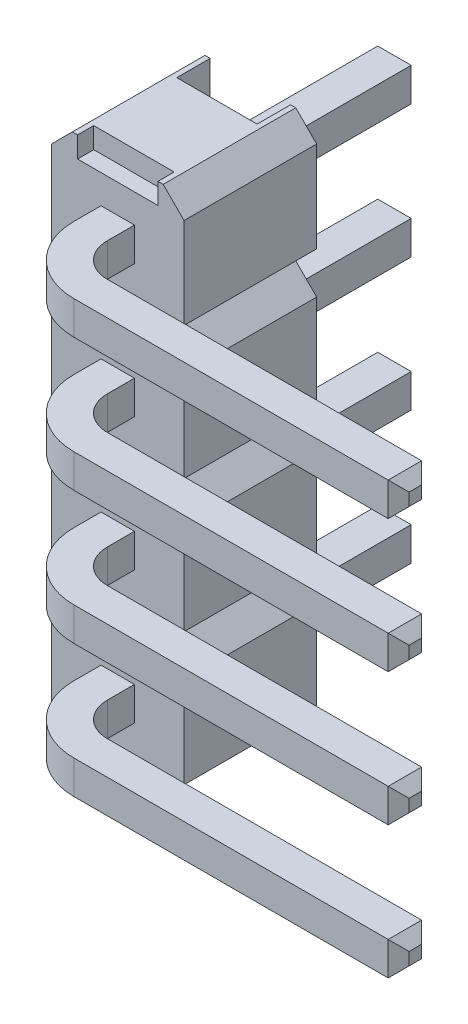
ISO-10303-21;
HEADER;
FILE_DESCRIPTION(('STEP AP214'),'2;1');
FILE_NAME('part.step','',(''),(''),'','','');
FILE_SCHEMA(('AUTOMOTIVE_DESIGN { 1 0 10303 214 1 1 1 1 }'));
ENDSEC;
DATA;
#1=APPLICATION_CONTEXT('core data for automotive mechanical design processes');
#2=APPLICATION_PROTOCOL_DEFINITION('international standard','automotive_design',2000,#1);
#3=PRODUCT_CONTEXT('',#1,'mechanical');
#4=PRODUCT('Part','Part','',(#3));
#5=PRODUCT_RELATED_PRODUCT_CATEGORY('part','',(#4));
#6=PRODUCT_DEFINITION_FORMATION('','',#4);
#7=PRODUCT_DEFINITION_CONTEXT('part definition',#1,'design');
#8=PRODUCT_DEFINITION('design','',#6,#7);
#9=PRODUCT_DEFINITION_SHAPE('','',#8);
#10=(LENGTH_UNIT() NAMED_UNIT(*) SI_UNIT(.MILLI.,.METRE.));
#11=(NAMED_UNIT(*) PLANE_ANGLE_UNIT() SI_UNIT($,.RADIAN.));
#12=(NAMED_UNIT(*) SI_UNIT($,.STERADIAN.) SOLID_ANGLE_UNIT());
#13=UNCERTAINTY_MEASURE_WITH_UNIT(LENGTH_MEASURE(1.E-05),#10,'distance_accuracy_value','');
#14=(GEOMETRIC_REPRESENTATION_CONTEXT(3) GLOBAL_UNCERTAINTY_ASSIGNED_CONTEXT((#13)) GLOBAL_UNIT_ASSIGNED_CONTEXT((#10,
#11,#12)) REPRESENTATION_CONTEXT('',''));
#15=CARTESIAN_POINT('',(0.,0.,0.));
#16=DIRECTION('',(0.,0.,1.));
#17=DIRECTION('',(1.,0.,0.));
#18=AXIS2_PLACEMENT_3D('',#15,#16,#17);
#19=CARTESIAN_POINT('',(1.8865,0.32,5.1935));
#20=DIRECTION('',(0.,1.,0.));
#21=DIRECTION('',(0.,0.,-1.));
#22=AXIS2_PLACEMENT_3D('',#19,#20,#21);
#23=PLANE('',#22);
#24=DIRECTION('',(-1.,0.,0.));
#25=VECTOR('',#24,1.);
#26=CARTESIAN_POINT('',(0.12,0.32,0.2));
#27=LINE('',#26,#25);
#28=CARTESIAN_POINT('',(0.32,0.32,0.2));
#29=VERTEX_POINT('',#28);
#30=CARTESIAN_POINT('',(-0.32,0.32,0.2));
#31=VERTEX_POINT('',#30);
#32=EDGE_CURVE('E11',#29,#31,#27,.T.);
#33=ORIENTED_EDGE('',*,*,#32,.T.);
#34=DIRECTION('',(0.,0.,1.));
#35=VECTOR('',#34,1.);
#36=CARTESIAN_POINT('',(-0.32,0.32,0.));
#37=LINE('',#36,#35);
#38=CARTESIAN_POINT('',(-0.32,0.32,3.6));
#39=VERTEX_POINT('',#38);
#40=EDGE_CURVE('E28',#31,#39,#37,.T.);
#41=ORIENTED_EDGE('',*,*,#40,.T.);
#42=DIRECTION('',(1.,0.,0.));
#43=VECTOR('',#42,1.);
#44=CARTESIAN_POINT('',(0.225,0.32,3.6));
#45=LINE('',#44,#43);
#46=CARTESIAN_POINT('',(0.32,0.32,3.6));
#47=VERTEX_POINT('',#46);
#48=EDGE_CURVE('E1699',#39,#47,#45,.T.);
#49=ORIENTED_EDGE('',*,*,#48,.T.);
#50=DIRECTION('',(0.,0.,-1.));
#51=VECTOR('',#50,1.);
#52=CARTESIAN_POINT('',(0.32,0.32,6.66));
#53=LINE('',#52,#51);
#54=EDGE_CURVE('E1716',#47,#29,#53,.T.);
#55=ORIENTED_EDGE('',*,*,#54,.T.);
#56=EDGE_LOOP('',(#33,#41,#49,#55));
#57=FACE_BOUND('',#56,.T.);
#58=ADVANCED_FACE('F17',(#57),#23,.T.);
#59=CARTESIAN_POINT('',(0.12,0.22,0.1));
#60=DIRECTION('',(0.,0.707106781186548,-0.707106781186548));
#61=DIRECTION('',(-1.,0.,0.));
#62=AXIS2_PLACEMENT_3D('',#59,#60,#61);
#63=PLANE('',#62);
#64=DIRECTION('',(0.577350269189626,0.577350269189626,0.577350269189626));
#65=VECTOR('',#64,1.);
#66=CARTESIAN_POINT('',(0.22,0.22,0.1));
#67=LINE('',#66,#65);
#68=CARTESIAN_POINT('',(0.12,0.12,0.));
#69=VERTEX_POINT('',#68);
#70=EDGE_CURVE('E1878',#69,#29,#67,.T.);
#71=ORIENTED_EDGE('',*,*,#70,.F.);
#72=DIRECTION('',(-1.,0.,0.));
#73=VECTOR('',#72,1.);
#74=CARTESIAN_POINT('',(0.12,0.12,0.));
#75=LINE('',#74,#73);
#76=CARTESIAN_POINT('',(-0.12,0.12,0.));
#77=VERTEX_POINT('',#76);
#78=EDGE_CURVE('E1720',#69,#77,#75,.T.);
#79=ORIENTED_EDGE('',*,*,#78,.T.);
#80=DIRECTION('',(-0.577350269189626,0.577350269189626,0.577350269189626));
#81=VECTOR('',#80,1.);
#82=CARTESIAN_POINT('',(-0.18,0.18,0.06));
#83=LINE('',#82,#81);
#84=EDGE_CURVE('E42',#77,#31,#83,.T.);
#85=ORIENTED_EDGE('',*,*,#84,.T.);
#86=ORIENTED_EDGE('',*,*,#32,.F.);
#87=EDGE_LOOP('',(#71,#79,#85,#86));
#88=FACE_BOUND('',#87,.T.);
#89=ADVANCED_FACE('F2593',(#88),#63,.T.);
#90=CARTESIAN_POINT('',(-0.32,0.32,0.));
#91=DIRECTION('',(-1.,0.,0.));
#92=DIRECTION('',(0.,0.,1.));
#93=AXIS2_PLACEMENT_3D('',#90,#91,#92);
#94=PLANE('',#93);
#95=ORIENTED_EDGE('',*,*,#40,.F.);
#96=DIRECTION('',(0.,-1.,0.));
#97=VECTOR('',#96,1.);
#98=CARTESIAN_POINT('',(-0.32,0.32,0.2));
#99=LINE('',#98,#97);
#100=CARTESIAN_POINT('',(-0.32,-0.32,0.2));
#101=VERTEX_POINT('',#100);
#102=EDGE_CURVE('E1581',#31,#101,#99,.T.);
#103=ORIENTED_EDGE('',*,*,#102,.T.);
#104=DIRECTION('',(0.,0.,1.));
#105=VECTOR('',#104,1.);
#106=CARTESIAN_POINT('',(-0.32,-0.32,0.));
#107=LINE('',#106,#105);
#108=CARTESIAN_POINT('',(-0.32,-0.32,3.6));
#109=VERTEX_POINT('',#108);
#110=EDGE_CURVE('E1585',#101,#109,#107,.T.);
#111=ORIENTED_EDGE('',*,*,#110,.T.);
#112=DIRECTION('',(0.,-1.,0.));
#113=VECTOR('',#112,1.);
#114=CARTESIAN_POINT('',(-0.32,0.475,3.6));
#115=LINE('',#114,#113);
#116=EDGE_CURVE('E1872',#39,#109,#115,.T.);
#117=ORIENTED_EDGE('',*,*,#116,.F.);
#118=EDGE_LOOP('',(#95,#103,#111,#117));
#119=FACE_BOUND('',#118,.T.);
#120=ADVANCED_FACE('F2599',(#119),#94,.T.);
#121=CARTESIAN_POINT('',(0.77,1.27,3.6));
#122=DIRECTION('',(0.,0.,-1.));
#123=DIRECTION('',(0.,-1.,0.));
#124=AXIS2_PLACEMENT_3D('',#121,#122,#123);
#125=PLANE('',#124);
#126=DIRECTION('',(0.,-1.,0.));
#127=VECTOR('',#126,1.);
#128=CARTESIAN_POINT('',(0.77,1.27,3.6));
#129=LINE('',#128,#127);
#130=CARTESIAN_POINT('',(0.77,1.27,3.6));
#131=VERTEX_POINT('',#130);
#132=CARTESIAN_POINT('',(0.77,-1.27,3.6));
#133=VERTEX_POINT('',#132);
#134=EDGE_CURVE('E1629',#131,#133,#129,.T.);
#135=ORIENTED_EDGE('',*,*,#134,.T.);
#136=DIRECTION('',(-1.,0.,0.));
#137=VECTOR('',#136,1.);
#138=CARTESIAN_POINT('',(0.77,-1.27,3.6));
#139=LINE('',#138,#137);
#140=CARTESIAN_POINT('',(-0.77,-1.27,3.6));
#141=VERTEX_POINT('',#140);
#142=EDGE_CURVE('E1633',#133,#141,#139,.T.);
#143=ORIENTED_EDGE('',*,*,#142,.T.);
#144=DIRECTION('',(0.,-1.,0.));
#145=VECTOR('',#144,1.);
#146=CARTESIAN_POINT('',(-0.77,1.27,3.6));
#147=LINE('',#146,#145);
#148=CARTESIAN_POINT('',(-0.77,1.27,3.6));
#149=VERTEX_POINT('',#148);
#150=EDGE_CURVE('E1703',#149,#141,#147,.T.);
#151=ORIENTED_EDGE('',*,*,#150,.F.);
#152=DIRECTION('',(-1.,0.,0.));
#153=VECTOR('',#152,1.);
#154=CARTESIAN_POINT('',(0.77,1.27,3.6));
#155=LINE('',#154,#153);
#156=EDGE_CURVE('E981',#131,#149,#155,.T.);
#157=ORIENTED_EDGE('',*,*,#156,.F.);
#158=EDGE_LOOP('',(#135,#143,#151,#157));
#159=FACE_BOUND('',#158,.T.);
#160=ORIENTED_EDGE('',*,*,#48,.F.);
#161=ORIENTED_EDGE('',*,*,#116,.T.);
#162=DIRECTION('',(1.,0.,0.));
#163=VECTOR('',#162,1.);
#164=CARTESIAN_POINT('',(0.225,-0.32,3.6));
#165=LINE('',#164,#163);
#166=CARTESIAN_POINT('',(0.32,-0.32,3.6));
#167=VERTEX_POINT('',#166);
#168=EDGE_CURVE('E2125',#109,#167,#165,.T.);
#169=ORIENTED_EDGE('',*,*,#168,.T.);
#170=DIRECTION('',(0.,-1.,0.));
#171=VECTOR('',#170,1.);
#172=CARTESIAN_POINT('',(0.32,0.475,3.6));
#173=LINE('',#172,#171);
#174=EDGE_CURVE('E1877',#47,#167,#173,.T.);
#175=ORIENTED_EDGE('',*,*,#174,.F.);
#176=EDGE_LOOP('',(#160,#161,#169,#175));
#177=FACE_BOUND('',#176,.T.);
#178=ADVANCED_FACE('F2673',(#159,#177),#125,.T.);
#179=CARTESIAN_POINT('',(0.32,0.32,6.66));
#180=DIRECTION('',(1.,0.,0.));
#181=DIRECTION('',(0.,1.,0.));
#182=AXIS2_PLACEMENT_3D('',#179,#180,#181);
#183=PLANE('',#182);
#184=ORIENTED_EDGE('',*,*,#54,.F.);
#185=ORIENTED_EDGE('',*,*,#174,.T.);
#186=DIRECTION('',(0.,0.,-1.));
#187=VECTOR('',#186,1.);
#188=CARTESIAN_POINT('',(0.32,-0.32,6.66));
#189=LINE('',#188,#187);
#190=CARTESIAN_POINT('',(0.32,-0.32,0.2));
#191=VERTEX_POINT('',#190);
#192=EDGE_CURVE('E1873',#167,#191,#189,.T.);
#193=ORIENTED_EDGE('',*,*,#192,.T.);
#194=DIRECTION('',(0.,-1.,0.));
#195=VECTOR('',#194,1.);
#196=CARTESIAN_POINT('',(0.32,0.32,0.2));
#197=LINE('',#196,#195);
#198=EDGE_CURVE('E1938',#29,#191,#197,.T.);
#199=ORIENTED_EDGE('',*,*,#198,.F.);
#200=EDGE_LOOP('',(#184,#185,#193,#199));
#201=FACE_BOUND('',#200,.T.);
#202=ADVANCED_FACE('F2669',(#201),#183,.T.);
#203=CARTESIAN_POINT('',(0.22,0.32,0.1));
#204=DIRECTION('',(0.707106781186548,0.,-0.707106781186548));
#205=DIRECTION('',(0.,-1.,0.));
#206=AXIS2_PLACEMENT_3D('',#203,#204,#205);
#207=PLANE('',#206);
#208=ORIENTED_EDGE('',*,*,#70,.T.);
#209=ORIENTED_EDGE('',*,*,#198,.T.);
#210=DIRECTION('',(0.577350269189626,-0.577350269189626,0.577350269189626));
#211=VECTOR('',#210,1.);
#212=CARTESIAN_POINT('',(0.113333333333,-0.113333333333,-0.006666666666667));
#213=LINE('',#212,#211);
#214=CARTESIAN_POINT('',(0.12,-0.12,0.));
#215=VERTEX_POINT('',#214);
#216=EDGE_CURVE('E1816',#215,#191,#213,.T.);
#217=ORIENTED_EDGE('',*,*,#216,.F.);
#218=DIRECTION('',(0.,-1.,0.));
#219=VECTOR('',#218,1.);
#220=CARTESIAN_POINT('',(0.12,0.32,0.));
#221=LINE('',#220,#219);
#222=EDGE_CURVE('E1934',#69,#215,#221,.T.);
#223=ORIENTED_EDGE('',*,*,#222,.F.);
#224=EDGE_LOOP('',(#208,#209,#217,#223));
#225=FACE_BOUND('',#224,.T.);
#226=ADVANCED_FACE('F2672',(#225),#207,.T.);
#227=CARTESIAN_POINT('',(0.32,0.32,0.));
#228=DIRECTION('',(0.,0.,-1.));
#229=DIRECTION('',(0.,-1.,0.));
#230=AXIS2_PLACEMENT_3D('',#227,#228,#229);
#231=PLANE('',#230);
#232=ORIENTED_EDGE('',*,*,#222,.T.);
#233=DIRECTION('',(-1.,0.,0.));
#234=VECTOR('',#233,1.);
#235=CARTESIAN_POINT('',(0.12,-0.12,0.));
#236=LINE('',#235,#234);
#237=CARTESIAN_POINT('',(-0.12,-0.12,0.));
#238=VERTEX_POINT('',#237);
#239=EDGE_CURVE('E1760',#215,#238,#236,.T.);
#240=ORIENTED_EDGE('',*,*,#239,.T.);
#241=DIRECTION('',(0.,-1.,0.));
#242=VECTOR('',#241,1.);
#243=CARTESIAN_POINT('',(-0.12,0.32,0.));
#244=LINE('',#243,#242);
#245=EDGE_CURVE('E1435',#77,#238,#244,.T.);
#246=ORIENTED_EDGE('',*,*,#245,.F.);
#247=ORIENTED_EDGE('',*,*,#78,.F.);
#248=EDGE_LOOP('',(#232,#240,#246,#247));
#249=FACE_BOUND('',#248,.T.);
#250=ADVANCED_FACE('F2935',(#249),#231,.T.);
#251=CARTESIAN_POINT('',(-0.22,0.32,0.1));
#252=DIRECTION('',(-0.707106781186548,0.,-0.707106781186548));
#253=DIRECTION('',(-0.707106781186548,0.,0.707106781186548));
#254=AXIS2_PLACEMENT_3D('',#251,#252,#253);
#255=PLANE('',#254);
#256=DIRECTION('',(-0.577350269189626,-0.577350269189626,0.577350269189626));
#257=VECTOR('',#256,1.);
#258=CARTESIAN_POINT('',(-0.07333333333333,-0.07333333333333,-0.04666666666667));
#259=LINE('',#258,#257);
#260=EDGE_CURVE('E1695',#238,#101,#259,.T.);
#261=ORIENTED_EDGE('',*,*,#260,.T.);
#262=ORIENTED_EDGE('',*,*,#102,.F.);
#263=ORIENTED_EDGE('',*,*,#84,.F.);
#264=ORIENTED_EDGE('',*,*,#245,.T.);
#265=EDGE_LOOP('',(#261,#262,#263,#264));
#266=FACE_BOUND('',#265,.T.);
#267=ADVANCED_FACE('F2931',(#266),#255,.T.);
#268=CARTESIAN_POINT('',(1.8865,-0.32,5.1935));
#269=DIRECTION('',(0.,1.,0.));
#270=DIRECTION('',(0.,0.,-1.));
#271=AXIS2_PLACEMENT_3D('',#268,#269,#270);
#272=PLANE('',#271);
#273=ORIENTED_EDGE('',*,*,#192,.F.);
#274=ORIENTED_EDGE('',*,*,#168,.F.);
#275=ORIENTED_EDGE('',*,*,#110,.F.);
#276=DIRECTION('',(-1.,0.,0.));
#277=VECTOR('',#276,1.);
#278=CARTESIAN_POINT('',(0.12,-0.32,0.2));
#279=LINE('',#278,#277);
#280=EDGE_CURVE('E1520',#191,#101,#279,.T.);
#281=ORIENTED_EDGE('',*,*,#280,.F.);
#282=EDGE_LOOP('',(#273,#274,#275,#281));
#283=FACE_BOUND('',#282,.T.);
#284=ADVANCED_FACE('F2934',(#283),#272,.F.);
#285=CARTESIAN_POINT('',(0.77,1.27,2.96));
#286=DIRECTION('',(-1.,0.,0.));
#287=DIRECTION('',(0.,0.,1.));
#288=AXIS2_PLACEMENT_3D('',#285,#286,#287);
#289=PLANE('',#288);
#290=DIRECTION('',(0.,-1.,0.));
#291=VECTOR('',#290,1.);
#292=CARTESIAN_POINT('',(0.77,1.27,2.96));
#293=LINE('',#292,#291);
#294=CARTESIAN_POINT('',(0.77,1.27,2.96));
#295=VERTEX_POINT('',#294);
#296=CARTESIAN_POINT('',(0.77,-1.27,2.96));
#297=VERTEX_POINT('',#296);
#298=EDGE_CURVE('E1431',#295,#297,#293,.T.);
#299=ORIENTED_EDGE('',*,*,#298,.T.);
#300=DIRECTION('',(0.,0.,1.));
#301=VECTOR('',#300,1.);
#302=CARTESIAN_POINT('',(0.77,-1.27,2.96));
#303=LINE('',#302,#301);
#304=EDGE_CURVE('E1436',#297,#133,#303,.T.);
#305=ORIENTED_EDGE('',*,*,#304,.T.);
#306=ORIENTED_EDGE('',*,*,#134,.F.);
#307=DIRECTION('',(0.,0.,1.));
#308=VECTOR('',#307,1.);
#309=CARTESIAN_POINT('',(0.77,1.27,2.96));
#310=LINE('',#309,#308);
#311=EDGE_CURVE('E1624',#295,#131,#310,.T.);
#312=ORIENTED_EDGE('',*,*,#311,.F.);
#313=EDGE_LOOP('',(#299,#305,#306,#312));
#314=FACE_BOUND('',#313,.T.);
#315=ADVANCED_FACE('F2883',(#314),#289,.T.);
#316=CARTESIAN_POINT('',(0.,-1.27,4.20986013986));
#317=DIRECTION('',(0.,1.,0.));
#318=DIRECTION('',(0.,0.,-1.));
#319=AXIS2_PLACEMENT_3D('',#316,#317,#318);
#320=PLANE('',#319);
#321=DIRECTION('',(0.,0.,1.));
#322=VECTOR('',#321,1.);
#323=CARTESIAN_POINT('',(-0.87,-1.27,2.96));
#324=LINE('',#323,#322);
#325=CARTESIAN_POINT('',(-0.87,-1.27,2.96));
#326=VERTEX_POINT('',#325);
#327=CARTESIAN_POINT('',(-0.87,-1.27,5.5));
#328=VERTEX_POINT('',#327);
#329=EDGE_CURVE('E1068',#326,#328,#324,.T.);
#330=ORIENTED_EDGE('',*,*,#329,.F.);
#331=DIRECTION('',(-1.,0.,0.));
#332=VECTOR('',#331,1.);
#333=CARTESIAN_POINT('',(-0.77,-1.27,2.96));
#334=LINE('',#333,#332);
#335=CARTESIAN_POINT('',(-0.77,-1.27,2.96));
#336=VERTEX_POINT('',#335);
#337=EDGE_CURVE('E1373',#336,#326,#334,.T.);
#338=ORIENTED_EDGE('',*,*,#337,.F.);
#339=DIRECTION('',(0.,0.,-1.));
#340=VECTOR('',#339,1.);
#341=CARTESIAN_POINT('',(-0.77,-1.27,3.6));
#342=LINE('',#341,#340);
#343=EDGE_CURVE('E1827',#141,#336,#342,.T.);
#344=ORIENTED_EDGE('',*,*,#343,.F.);
#345=ORIENTED_EDGE('',*,*,#142,.F.);
#346=ORIENTED_EDGE('',*,*,#304,.F.);
#347=DIRECTION('',(-1.,0.,0.));
#348=VECTOR('',#347,1.);
#349=CARTESIAN_POINT('',(1.27,-1.27,2.96));
#350=LINE('',#349,#348);
#351=CARTESIAN_POINT('',(0.87,-1.27,2.96));
#352=VERTEX_POINT('',#351);
#353=EDGE_CURVE('E1218',#352,#297,#350,.T.);
#354=ORIENTED_EDGE('',*,*,#353,.F.);
#355=DIRECTION('',(0.,0.,-1.));
#356=VECTOR('',#355,1.);
#357=CARTESIAN_POINT('',(0.87,-1.27,5.5));
#358=LINE('',#357,#356);
#359=CARTESIAN_POINT('',(0.87,-1.27,5.5));
#360=VERTEX_POINT('',#359);
#361=EDGE_CURVE('E1093',#360,#352,#358,.T.);
#362=ORIENTED_EDGE('',*,*,#361,.F.);
#363=DIRECTION('',(1.,0.,0.));
#364=VECTOR('',#363,1.);
#365=CARTESIAN_POINT('',(-1.27,-1.27,5.5));
#366=LINE('',#365,#364);
#367=EDGE_CURVE('E1046',#328,#360,#366,.T.);
#368=ORIENTED_EDGE('',*,*,#367,.F.);
#369=EDGE_LOOP('',(#330,#338,#344,#345,#346,#354,#362,#368));
#370=FACE_BOUND('',#369,.T.);
#371=ADVANCED_FACE('F2815',(#370),#320,.F.);
#372=CARTESIAN_POINT('',(-0.77,1.27,3.6));
#373=DIRECTION('',(1.,0.,0.));
#374=DIRECTION('',(0.,1.,0.));
#375=AXIS2_PLACEMENT_3D('',#372,#373,#374);
#376=PLANE('',#375);
#377=ORIENTED_EDGE('',*,*,#150,.T.);
#378=ORIENTED_EDGE('',*,*,#343,.T.);
#379=DIRECTION('',(0.,-1.,0.));
#380=VECTOR('',#379,1.);
#381=CARTESIAN_POINT('',(-0.77,1.27,2.96));
#382=LINE('',#381,#380);
#383=CARTESIAN_POINT('',(-0.77,1.27,2.96));
#384=VERTEX_POINT('',#383);
#385=EDGE_CURVE('E1011',#384,#336,#382,.T.);
#386=ORIENTED_EDGE('',*,*,#385,.F.);
#387=DIRECTION('',(0.,0.,-1.));
#388=VECTOR('',#387,1.);
#389=CARTESIAN_POINT('',(-0.77,1.27,3.6));
#390=LINE('',#389,#388);
#391=EDGE_CURVE('E1142',#149,#384,#390,.T.);
#392=ORIENTED_EDGE('',*,*,#391,.F.);
#393=EDGE_LOOP('',(#377,#378,#386,#392));
#394=FACE_BOUND('',#393,.T.);
#395=ADVANCED_FACE('F2812',(#394),#376,.T.);
#396=CARTESIAN_POINT('',(0.77,3.81,3.6));
#397=DIRECTION('',(0.,0.,-1.));
#398=DIRECTION('',(0.,-1.,0.));
#399=AXIS2_PLACEMENT_3D('',#396,#397,#398);
#400=PLANE('',#399);
#401=DIRECTION('',(0.,-1.,0.));
#402=VECTOR('',#401,1.);
#403=CARTESIAN_POINT('',(0.77,3.81,3.6));
#404=LINE('',#403,#402);
#405=CARTESIAN_POINT('',(0.77,3.81,3.6));
#406=VERTEX_POINT('',#405);
#407=EDGE_CURVE('E1658',#406,#131,#404,.T.);
#408=ORIENTED_EDGE('',*,*,#407,.T.);
#409=ORIENTED_EDGE('',*,*,#156,.T.);
#410=DIRECTION('',(0.,-1.,0.));
#411=VECTOR('',#410,1.);
#412=CARTESIAN_POINT('',(-0.77,3.81,3.6));
#413=LINE('',#412,#411);
#414=CARTESIAN_POINT('',(-0.77,3.81,3.6));
#415=VERTEX_POINT('',#414);
#416=EDGE_CURVE('E1069',#415,#149,#413,.T.);
#417=ORIENTED_EDGE('',*,*,#416,.F.);
#418=DIRECTION('',(-1.,0.,0.));
#419=VECTOR('',#418,1.);
#420=CARTESIAN_POINT('',(0.77,3.81,3.6));
#421=LINE('',#420,#419);
#422=EDGE_CURVE('E1070',#406,#415,#421,.T.);
#423=ORIENTED_EDGE('',*,*,#422,.F.);
#424=EDGE_LOOP('',(#408,#409,#417,#423));
#425=FACE_BOUND('',#424,.T.);
#426=DIRECTION('',(1.,0.,0.));
#427=VECTOR('',#426,1.);
#428=CARTESIAN_POINT('',(0.225,2.86,3.6));
#429=LINE('',#428,#427);
#430=CARTESIAN_POINT('',(-0.32,2.86,3.6));
#431=VERTEX_POINT('',#430);
#432=CARTESIAN_POINT('',(0.32,2.86,3.6));
#433=VERTEX_POINT('',#432);
#434=EDGE_CURVE('E958',#431,#433,#429,.T.);
#435=ORIENTED_EDGE('',*,*,#434,.F.);
#436=DIRECTION('',(0.,-1.,0.));
#437=VECTOR('',#436,1.);
#438=CARTESIAN_POINT('',(-0.32,3.015,3.6));
#439=LINE('',#438,#437);
#440=CARTESIAN_POINT('',(-0.32,2.22,3.6));
#441=VERTEX_POINT('',#440);
#442=EDGE_CURVE('E962',#431,#441,#439,.T.);
#443=ORIENTED_EDGE('',*,*,#442,.T.);
#444=DIRECTION('',(1.,0.,0.));
#445=VECTOR('',#444,1.);
#446=CARTESIAN_POINT('',(0.225,2.22,3.6));
#447=LINE('',#446,#445);
#448=CARTESIAN_POINT('',(0.32,2.22,3.6));
#449=VERTEX_POINT('',#448);
#450=EDGE_CURVE('E982',#441,#449,#447,.T.);
#451=ORIENTED_EDGE('',*,*,#450,.T.);
#452=DIRECTION('',(0.,-1.,0.));
#453=VECTOR('',#452,1.);
#454=CARTESIAN_POINT('',(0.32,3.015,3.6));
#455=LINE('',#454,#453);
#456=EDGE_CURVE('E964',#433,#449,#455,.T.);
#457=ORIENTED_EDGE('',*,*,#456,.F.);
#458=EDGE_LOOP('',(#435,#443,#451,#457));
#459=FACE_BOUND('',#458,.T.);
#460=ADVANCED_FACE('F960',(#425,#459),#400,.T.);
#461=CARTESIAN_POINT('',(0.12,-0.22,0.1));
#462=DIRECTION('',(0.,0.707106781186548,0.707106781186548));
#463=DIRECTION('',(1.,0.,0.));
#464=AXIS2_PLACEMENT_3D('',#461,#462,#463);
#465=PLANE('',#464);
#466=ORIENTED_EDGE('',*,*,#280,.T.);
#467=ORIENTED_EDGE('',*,*,#260,.F.);
#468=ORIENTED_EDGE('',*,*,#239,.F.);
#469=ORIENTED_EDGE('',*,*,#216,.T.);
#470=EDGE_LOOP('',(#466,#467,#468,#469));
#471=FACE_BOUND('',#470,.T.);
#472=ADVANCED_FACE('F2719',(#471),#465,.F.);
#473=CARTESIAN_POINT('',(1.27,1.27,2.96));
#474=DIRECTION('',(0.,0.,-1.));
#475=DIRECTION('',(0.,-1.,0.));
#476=AXIS2_PLACEMENT_3D('',#473,#474,#475);
#477=PLANE('',#476);
#478=DIRECTION('',(0.,-1.,0.));
#479=VECTOR('',#478,1.);
#480=CARTESIAN_POINT('',(1.27,1.27,2.96));
#481=LINE('',#480,#479);
#482=CARTESIAN_POINT('',(1.27,0.87,2.96));
#483=VERTEX_POINT('',#482);
#484=CARTESIAN_POINT('',(1.27,-0.87,2.96));
#485=VERTEX_POINT('',#484);
#486=EDGE_CURVE('E1812',#483,#485,#481,.T.);
#487=ORIENTED_EDGE('',*,*,#486,.T.);
#488=DIRECTION('',(-0.707106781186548,-0.707106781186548,0.));
#489=VECTOR('',#488,1.);
#490=CARTESIAN_POINT('',(1.705,-0.435,2.96));
#491=LINE('',#490,#489);
#492=EDGE_CURVE('E1222',#485,#352,#491,.T.);
#493=ORIENTED_EDGE('',*,*,#492,.T.);
#494=ORIENTED_EDGE('',*,*,#353,.T.);
#495=ORIENTED_EDGE('',*,*,#298,.F.);
#496=DIRECTION('',(-1.,0.,0.));
#497=VECTOR('',#496,1.);
#498=CARTESIAN_POINT('',(1.27,1.27,2.96));
#499=LINE('',#498,#497);
#500=CARTESIAN_POINT('',(0.87,1.27,2.96));
#501=VERTEX_POINT('',#500);
#502=EDGE_CURVE('E1249',#501,#295,#499,.T.);
#503=ORIENTED_EDGE('',*,*,#502,.F.);
#504=DIRECTION('',(0.707106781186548,-0.707106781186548,0.));
#505=VECTOR('',#504,1.);
#506=CARTESIAN_POINT('',(1.07,1.07,2.96));
#507=LINE('',#506,#505);
#508=EDGE_CURVE('E1223',#501,#483,#507,.T.);
#509=ORIENTED_EDGE('',*,*,#508,.T.);
#510=EDGE_LOOP('',(#487,#493,#494,#495,#503,#509));
#511=FACE_BOUND('',#510,.T.);
#512=ADVANCED_FACE('F2502',(#511),#477,.T.);
#513=CARTESIAN_POINT('',(0.77,3.81,2.96));
#514=DIRECTION('',(-1.,0.,0.));
#515=DIRECTION('',(0.,0.,1.));
#516=AXIS2_PLACEMENT_3D('',#513,#514,#515);
#517=PLANE('',#516);
#518=DIRECTION('',(0.,-1.,0.));
#519=VECTOR('',#518,1.);
#520=CARTESIAN_POINT('',(0.77,3.81,2.96));
#521=LINE('',#520,#519);
#522=CARTESIAN_POINT('',(0.77,3.81,2.96));
#523=VERTEX_POINT('',#522);
#524=EDGE_CURVE('E1748',#523,#295,#521,.T.);
#525=ORIENTED_EDGE('',*,*,#524,.T.);
#526=ORIENTED_EDGE('',*,*,#311,.T.);
#527=ORIENTED_EDGE('',*,*,#407,.F.);
#528=DIRECTION('',(0.,0.,1.));
#529=VECTOR('',#528,1.);
#530=CARTESIAN_POINT('',(0.77,3.81,2.96));
#531=LINE('',#530,#529);
#532=EDGE_CURVE('E2067',#523,#406,#531,.T.);
#533=ORIENTED_EDGE('',*,*,#532,.F.);
#534=EDGE_LOOP('',(#525,#526,#527,#533));
#535=FACE_BOUND('',#534,.T.);
#536=ADVANCED_FACE('F2606',(#535),#517,.T.);
#537=CARTESIAN_POINT('',(-1.27,1.27,5.5));
#538=DIRECTION('',(0.,0.,1.));
#539=DIRECTION('',(0.,-1.,0.));
#540=AXIS2_PLACEMENT_3D('',#537,#538,#539);
#541=PLANE('',#540);
#542=DIRECTION('',(0.,-1.,0.));
#543=VECTOR('',#542,1.);
#544=CARTESIAN_POINT('',(-1.27,1.27,5.5));
#545=LINE('',#544,#543);
#546=CARTESIAN_POINT('',(-1.27,0.87,5.5));
#547=VERTEX_POINT('',#546);
#548=CARTESIAN_POINT('',(-1.27,-0.87,5.5));
#549=VERTEX_POINT('',#548);
#550=EDGE_CURVE('E1620',#547,#549,#545,.T.);
#551=ORIENTED_EDGE('',*,*,#550,.T.);
#552=DIRECTION('',(-0.707106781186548,0.707106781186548,0.));
#553=VECTOR('',#552,1.);
#554=CARTESIAN_POINT('',(-1.705,-0.435,5.5));
#555=LINE('',#554,#553);
#556=EDGE_CURVE('E1065',#328,#549,#555,.T.);
#557=ORIENTED_EDGE('',*,*,#556,.F.);
#558=ORIENTED_EDGE('',*,*,#367,.T.);
#559=DIRECTION('',(-0.707106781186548,-0.707106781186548,0.));
#560=VECTOR('',#559,1.);
#561=CARTESIAN_POINT('',(1.07,-1.07,5.5));
#562=LINE('',#561,#560);
#563=CARTESIAN_POINT('',(1.27,-0.87,5.5));
#564=VERTEX_POINT('',#563);
#565=EDGE_CURVE('E1010',#564,#360,#562,.T.);
#566=ORIENTED_EDGE('',*,*,#565,.F.);
#567=DIRECTION('',(0.,-1.,0.));
#568=VECTOR('',#567,1.);
#569=CARTESIAN_POINT('',(1.27,1.27,5.5));
#570=LINE('',#569,#568);
#571=CARTESIAN_POINT('',(1.27,0.87,5.5));
#572=VERTEX_POINT('',#571);
#573=EDGE_CURVE('E1234',#572,#564,#570,.T.);
#574=ORIENTED_EDGE('',*,*,#573,.F.);
#575=DIRECTION('',(0.707106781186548,-0.707106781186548,0.));
#576=VECTOR('',#575,1.);
#577=CARTESIAN_POINT('',(0.435,1.705,5.5));
#578=LINE('',#577,#576);
#579=CARTESIAN_POINT('',(0.87,1.27,5.5));
#580=VERTEX_POINT('',#579);
#581=EDGE_CURVE('E1340',#580,#572,#578,.T.);
#582=ORIENTED_EDGE('',*,*,#581,.F.);
#583=DIRECTION('',(1.,0.,0.));
#584=VECTOR('',#583,1.);
#585=CARTESIAN_POINT('',(-1.27,1.27,5.5));
#586=LINE('',#585,#584);
#587=CARTESIAN_POINT('',(0.77,1.27,5.5));
#588=VERTEX_POINT('',#587);
#589=EDGE_CURVE('E1945',#588,#580,#586,.T.);
#590=ORIENTED_EDGE('',*,*,#589,.F.);
#591=DIRECTION('',(0.,1.,0.));
#592=VECTOR('',#591,1.);
#593=CARTESIAN_POINT('',(0.77,1.07,5.5));
#594=LINE('',#593,#592);
#595=CARTESIAN_POINT('',(0.77,0.87,5.5));
#596=VERTEX_POINT('',#595);
#597=EDGE_CURVE('E1126',#596,#588,#594,.T.);
#598=ORIENTED_EDGE('',*,*,#597,.F.);
#599=DIRECTION('',(-1.,0.,0.));
#600=VECTOR('',#599,1.);
#601=CARTESIAN_POINT('',(-1.02,0.87,5.5));
#602=LINE('',#601,#600);
#603=CARTESIAN_POINT('',(-0.77,0.87,5.5));
#604=VERTEX_POINT('',#603);
#605=EDGE_CURVE('E1042',#596,#604,#602,.T.);
#606=ORIENTED_EDGE('',*,*,#605,.T.);
#607=DIRECTION('',(0.,1.,0.));
#608=VECTOR('',#607,1.);
#609=CARTESIAN_POINT('',(-0.77,1.07,5.5));
#610=LINE('',#609,#608);
#611=CARTESIAN_POINT('',(-0.77,1.27,5.5));
#612=VERTEX_POINT('',#611);
#613=EDGE_CURVE('E1047',#604,#612,#610,.T.);
#614=ORIENTED_EDGE('',*,*,#613,.T.);
#615=DIRECTION('',(1.,0.,0.));
#616=VECTOR('',#615,1.);
#617=CARTESIAN_POINT('',(-1.27,1.27,5.5));
#618=LINE('',#617,#616);
#619=CARTESIAN_POINT('',(-0.87,1.27,5.5));
#620=VERTEX_POINT('',#619);
#621=EDGE_CURVE('E2259',#620,#612,#618,.T.);
#622=ORIENTED_EDGE('',*,*,#621,.F.);
#623=DIRECTION('',(0.707106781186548,0.707106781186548,0.));
#624=VECTOR('',#623,1.);
#625=CARTESIAN_POINT('',(-1.07,1.07,5.5));
#626=LINE('',#625,#624);
#627=EDGE_CURVE('E1456',#547,#620,#626,.T.);
#628=ORIENTED_EDGE('',*,*,#627,.F.);
#629=EDGE_LOOP('',(#551,#557,#558,#566,#574,#582,#590,#598,#606,#614,#622,#628));
#630=FACE_BOUND('',#629,.T.);
#631=DIRECTION('',(-1.,0.,0.));
#632=VECTOR('',#631,1.);
#633=CARTESIAN_POINT('',(-0.795,-0.32,5.5));
#634=LINE('',#633,#632);
#635=CARTESIAN_POINT('',(0.32,-0.32,5.5));
#636=VERTEX_POINT('',#635);
#637=CARTESIAN_POINT('',(-0.32,-0.32,5.5));
#638=VERTEX_POINT('',#637);
#639=EDGE_CURVE('E1763',#636,#638,#634,.T.);
#640=ORIENTED_EDGE('',*,*,#639,.T.);
#641=DIRECTION('',(0.,1.,0.));
#642=VECTOR('',#641,1.);
#643=CARTESIAN_POINT('',(-0.32,0.475,5.5));
#644=LINE('',#643,#642);
#645=CARTESIAN_POINT('',(-0.32,0.32,5.5));
#646=VERTEX_POINT('',#645);
#647=EDGE_CURVE('E1191',#638,#646,#644,.T.);
#648=ORIENTED_EDGE('',*,*,#647,.T.);
#649=DIRECTION('',(-1.,0.,0.));
#650=VECTOR('',#649,1.);
#651=CARTESIAN_POINT('',(-0.795,0.32,5.5));
#652=LINE('',#651,#650);
#653=CARTESIAN_POINT('',(0.32,0.32,5.5));
#654=VERTEX_POINT('',#653);
#655=EDGE_CURVE('E1151',#654,#646,#652,.T.);
#656=ORIENTED_EDGE('',*,*,#655,.F.);
#657=DIRECTION('',(0.,1.,0.));
#658=VECTOR('',#657,1.);
#659=CARTESIAN_POINT('',(0.32,0.475,5.5));
#660=LINE('',#659,#658);
#661=EDGE_CURVE('E1440',#636,#654,#660,.T.);
#662=ORIENTED_EDGE('',*,*,#661,.F.);
#663=EDGE_LOOP('',(#640,#648,#656,#662));
#664=FACE_BOUND('',#663,.T.);
#665=ADVANCED_FACE('F2494',(#630,#664),#541,.T.);
#666=CARTESIAN_POINT('',(1.07,-1.07,5.5));
#667=DIRECTION('',(-0.707106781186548,0.707106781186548,0.));
#668=DIRECTION('',(0.,0.,1.));
#669=AXIS2_PLACEMENT_3D('',#666,#667,#668);
#670=PLANE('',#669);
#671=ORIENTED_EDGE('',*,*,#361,.T.);
#672=ORIENTED_EDGE('',*,*,#492,.F.);
#673=DIRECTION('',(0.,0.,-1.));
#674=VECTOR('',#673,1.);
#675=CARTESIAN_POINT('',(1.27,-0.87,5.5));
#676=LINE('',#675,#674);
#677=EDGE_CURVE('E1230',#564,#485,#676,.T.);
#678=ORIENTED_EDGE('',*,*,#677,.F.);
#679=ORIENTED_EDGE('',*,*,#565,.T.);
#680=EDGE_LOOP('',(#671,#672,#678,#679));
#681=FACE_BOUND('',#680,.T.);
#682=ADVANCED_FACE('F2499',(#681),#670,.F.);
#683=CARTESIAN_POINT('',(-0.77,1.27,2.96));
#684=DIRECTION('',(0.,0.,-1.));
#685=DIRECTION('',(0.,-1.,0.));
#686=AXIS2_PLACEMENT_3D('',#683,#684,#685);
#687=PLANE('',#686);
#688=DIRECTION('',(0.,-1.,0.));
#689=VECTOR('',#688,1.);
#690=CARTESIAN_POINT('',(-1.27,1.27,2.96));
#691=LINE('',#690,#689);
#692=CARTESIAN_POINT('',(-1.27,0.87,2.96));
#693=VERTEX_POINT('',#692);
#694=CARTESIAN_POINT('',(-1.27,-0.87,2.96));
#695=VERTEX_POINT('',#694);
#696=EDGE_CURVE('E529',#693,#695,#691,.T.);
#697=ORIENTED_EDGE('',*,*,#696,.F.);
#698=DIRECTION('',(0.707106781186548,0.707106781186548,0.));
#699=VECTOR('',#698,1.);
#700=CARTESIAN_POINT('',(-0.945,1.195,2.96));
#701=LINE('',#700,#699);
#702=CARTESIAN_POINT('',(-0.87,1.27,2.96));
#703=VERTEX_POINT('',#702);
#704=EDGE_CURVE('E1006',#693,#703,#701,.T.);
#705=ORIENTED_EDGE('',*,*,#704,.T.);
#706=DIRECTION('',(-1.,0.,0.));
#707=VECTOR('',#706,1.);
#708=CARTESIAN_POINT('',(-0.77,1.27,2.96));
#709=LINE('',#708,#707);
#710=EDGE_CURVE('E1156',#384,#703,#709,.T.);
#711=ORIENTED_EDGE('',*,*,#710,.F.);
#712=ORIENTED_EDGE('',*,*,#385,.T.);
#713=ORIENTED_EDGE('',*,*,#337,.T.);
#714=DIRECTION('',(-0.707106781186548,0.707106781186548,0.));
#715=VECTOR('',#714,1.);
#716=CARTESIAN_POINT('',(-1.58,-0.56,2.96));
#717=LINE('',#716,#715);
#718=EDGE_CURVE('E1399',#326,#695,#717,.T.);
#719=ORIENTED_EDGE('',*,*,#718,.T.);
#720=EDGE_LOOP('',(#697,#705,#711,#712,#713,#719));
#721=FACE_BOUND('',#720,.T.);
#722=ADVANCED_FACE('F2550',(#721),#687,.T.);
#723=CARTESIAN_POINT('',(-1.07,-1.07,2.96));
#724=DIRECTION('',(0.707106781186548,0.707106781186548,0.));
#725=DIRECTION('',(0.,0.,-1.));
#726=AXIS2_PLACEMENT_3D('',#723,#724,#725);
#727=PLANE('',#726);
#728=ORIENTED_EDGE('',*,*,#718,.F.);
#729=ORIENTED_EDGE('',*,*,#329,.T.);
#730=ORIENTED_EDGE('',*,*,#556,.T.);
#731=DIRECTION('',(0.,0.,1.));
#732=VECTOR('',#731,1.);
#733=CARTESIAN_POINT('',(-1.27,-0.87,2.96));
#734=LINE('',#733,#732);
#735=EDGE_CURVE('E2148',#695,#549,#734,.T.);
#736=ORIENTED_EDGE('',*,*,#735,.F.);
#737=EDGE_LOOP('',(#728,#729,#730,#736));
#738=FACE_BOUND('',#737,.T.);
#739=ADVANCED_FACE('F2609',(#738),#727,.F.);
#740=CARTESIAN_POINT('',(-0.77,3.81,3.6));
#741=DIRECTION('',(1.,0.,0.));
#742=DIRECTION('',(0.,1.,0.));
#743=AXIS2_PLACEMENT_3D('',#740,#741,#742);
#744=PLANE('',#743);
#745=ORIENTED_EDGE('',*,*,#416,.T.);
#746=ORIENTED_EDGE('',*,*,#391,.T.);
#747=DIRECTION('',(0.,-1.,0.));
#748=VECTOR('',#747,1.);
#749=CARTESIAN_POINT('',(-0.77,3.81,2.96));
#750=LINE('',#749,#748);
#751=CARTESIAN_POINT('',(-0.77,3.81,2.96));
#752=VERTEX_POINT('',#751);
#753=EDGE_CURVE('E1862',#752,#384,#750,.T.);
#754=ORIENTED_EDGE('',*,*,#753,.F.);
#755=DIRECTION('',(0.,0.,-1.));
#756=VECTOR('',#755,1.);
#757=CARTESIAN_POINT('',(-0.77,3.81,3.6));
#758=LINE('',#757,#756);
#759=EDGE_CURVE('E1925',#415,#752,#758,.T.);
#760=ORIENTED_EDGE('',*,*,#759,.F.);
#761=EDGE_LOOP('',(#745,#746,#754,#760));
#762=FACE_BOUND('',#761,.T.);
#763=ADVANCED_FACE('F2543',(#762),#744,.T.);
#764=CARTESIAN_POINT('',(0.77,6.35,3.6));
#765=DIRECTION('',(0.,0.,-1.));
#766=DIRECTION('',(0.,-1.,0.));
#767=AXIS2_PLACEMENT_3D('',#764,#765,#766);
#768=PLANE('',#767);
#769=DIRECTION('',(0.,-1.,0.));
#770=VECTOR('',#769,1.);
#771=CARTESIAN_POINT('',(0.77,6.35,3.6));
#772=LINE('',#771,#770);
#773=CARTESIAN_POINT('',(0.77,6.35,3.6));
#774=VERTEX_POINT('',#773);
#775=EDGE_CURVE('E1074',#774,#406,#772,.T.);
#776=ORIENTED_EDGE('',*,*,#775,.T.);
#777=ORIENTED_EDGE('',*,*,#422,.T.);
#778=DIRECTION('',(0.,-1.,0.));
#779=VECTOR('',#778,1.);
#780=CARTESIAN_POINT('',(-0.77,6.35,3.6));
#781=LINE('',#780,#779);
#782=CARTESIAN_POINT('',(-0.77,6.35,3.6));
#783=VERTEX_POINT('',#782);
#784=EDGE_CURVE('E1157',#783,#415,#781,.T.);
#785=ORIENTED_EDGE('',*,*,#784,.F.);
#786=DIRECTION('',(-1.,0.,0.));
#787=VECTOR('',#786,1.);
#788=CARTESIAN_POINT('',(0.77,6.35,3.6));
#789=LINE('',#788,#787);
#790=EDGE_CURVE('E2044',#774,#783,#789,.T.);
#791=ORIENTED_EDGE('',*,*,#790,.F.);
#792=EDGE_LOOP('',(#776,#777,#785,#791));
#793=FACE_BOUND('',#792,.T.);
#794=DIRECTION('',(1.,0.,0.));
#795=VECTOR('',#794,1.);
#796=CARTESIAN_POINT('',(0.225,5.4,3.6));
#797=LINE('',#796,#795);
#798=CARTESIAN_POINT('',(-0.32,5.4,3.6));
#799=VERTEX_POINT('',#798);
#800=CARTESIAN_POINT('',(0.32,5.4,3.6));
#801=VERTEX_POINT('',#800);
#802=EDGE_CURVE('E1258',#799,#801,#797,.T.);
#803=ORIENTED_EDGE('',*,*,#802,.F.);
#804=DIRECTION('',(0.,-1.,0.));
#805=VECTOR('',#804,1.);
#806=CARTESIAN_POINT('',(-0.32,5.555,3.6));
#807=LINE('',#806,#805);
#808=CARTESIAN_POINT('',(-0.32,4.76,3.6));
#809=VERTEX_POINT('',#808);
#810=EDGE_CURVE('E1075',#799,#809,#807,.T.);
#811=ORIENTED_EDGE('',*,*,#810,.T.);
#812=DIRECTION('',(1.,0.,0.));
#813=VECTOR('',#812,1.);
#814=CARTESIAN_POINT('',(0.225,4.76,3.6));
#815=LINE('',#814,#813);
#816=CARTESIAN_POINT('',(0.32,4.76,3.6));
#817=VERTEX_POINT('',#816);
#818=EDGE_CURVE('E994',#809,#817,#815,.T.);
#819=ORIENTED_EDGE('',*,*,#818,.T.);
#820=DIRECTION('',(0.,-1.,0.));
#821=VECTOR('',#820,1.);
#822=CARTESIAN_POINT('',(0.32,5.555,3.6));
#823=LINE('',#822,#821);
#824=EDGE_CURVE('E1109',#801,#817,#823,.T.);
#825=ORIENTED_EDGE('',*,*,#824,.F.);
#826=EDGE_LOOP('',(#803,#811,#819,#825));
#827=FACE_BOUND('',#826,.T.);
#828=ADVANCED_FACE('F4630',(#793,#827),#768,.T.);
#829=CARTESIAN_POINT('',(1.8865,2.86,5.1935));
#830=DIRECTION('',(0.,1.,0.));
#831=DIRECTION('',(0.,0.,-1.));
#832=AXIS2_PLACEMENT_3D('',#829,#830,#831);
#833=PLANE('',#832);
#834=DIRECTION('',(-1.,0.,0.));
#835=VECTOR('',#834,1.);
#836=CARTESIAN_POINT('',(0.12,2.86,0.2));
#837=LINE('',#836,#835);
#838=CARTESIAN_POINT('',(0.32,2.86,0.2));
#839=VERTEX_POINT('',#838);
#840=CARTESIAN_POINT('',(-0.32,2.86,0.2));
#841=VERTEX_POINT('',#840);
#842=EDGE_CURVE('E986',#839,#841,#837,.T.);
#843=ORIENTED_EDGE('',*,*,#842,.T.);
#844=DIRECTION('',(0.,0.,1.));
#845=VECTOR('',#844,1.);
#846=CARTESIAN_POINT('',(-0.32,2.86,0.));
#847=LINE('',#846,#845);
#848=EDGE_CURVE('E970',#841,#431,#847,.T.);
#849=ORIENTED_EDGE('',*,*,#848,.T.);
#850=ORIENTED_EDGE('',*,*,#434,.T.);
#851=DIRECTION('',(0.,0.,-1.));
#852=VECTOR('',#851,1.);
#853=CARTESIAN_POINT('',(0.32,2.86,6.66));
#854=LINE('',#853,#852);
#855=EDGE_CURVE('E971',#433,#839,#854,.T.);
#856=ORIENTED_EDGE('',*,*,#855,.T.);
#857=EDGE_LOOP('',(#843,#849,#850,#856));
#858=FACE_BOUND('',#857,.T.);
#859=ADVANCED_FACE('F984',(#858),#833,.T.);
#860=CARTESIAN_POINT('',(-0.32,2.86,0.));
#861=DIRECTION('',(-1.,0.,0.));
#862=DIRECTION('',(0.,0.,1.));
#863=AXIS2_PLACEMENT_3D('',#860,#861,#862);
#864=PLANE('',#863);
#865=ORIENTED_EDGE('',*,*,#848,.F.);
#866=DIRECTION('',(0.,-1.,0.));
#867=VECTOR('',#866,1.);
#868=CARTESIAN_POINT('',(-0.32,2.86,0.2));
#869=LINE('',#868,#867);
#870=CARTESIAN_POINT('',(-0.32,2.22,0.2));
#871=VERTEX_POINT('',#870);
#872=EDGE_CURVE('E1089',#841,#871,#869,.T.);
#873=ORIENTED_EDGE('',*,*,#872,.T.);
#874=DIRECTION('',(0.,0.,1.));
#875=VECTOR('',#874,1.);
#876=CARTESIAN_POINT('',(-0.32,2.22,0.));
#877=LINE('',#876,#875);
#878=EDGE_CURVE('E979',#871,#441,#877,.T.);
#879=ORIENTED_EDGE('',*,*,#878,.T.);
#880=ORIENTED_EDGE('',*,*,#442,.F.);
#881=EDGE_LOOP('',(#865,#873,#879,#880));
#882=FACE_BOUND('',#881,.T.);
#883=ADVANCED_FACE('F975',(#882),#864,.T.);
#884=CARTESIAN_POINT('',(1.8865,2.22,5.1935));
#885=DIRECTION('',(0.,1.,0.));
#886=DIRECTION('',(0.,0.,-1.));
#887=AXIS2_PLACEMENT_3D('',#884,#885,#886);
#888=PLANE('',#887);
#889=DIRECTION('',(0.,0.,-1.));
#890=VECTOR('',#889,1.);
#891=CARTESIAN_POINT('',(0.32,2.22,6.66));
#892=LINE('',#891,#890);
#893=CARTESIAN_POINT('',(0.32,2.22,0.2));
#894=VERTEX_POINT('',#893);
#895=EDGE_CURVE('E1546',#449,#894,#892,.T.);
#896=ORIENTED_EDGE('',*,*,#895,.F.);
#897=ORIENTED_EDGE('',*,*,#450,.F.);
#898=ORIENTED_EDGE('',*,*,#878,.F.);
#899=DIRECTION('',(-1.,0.,0.));
#900=VECTOR('',#899,1.);
#901=CARTESIAN_POINT('',(0.12,2.22,0.2));
#902=LINE('',#901,#900);
#903=EDGE_CURVE('E1588',#894,#871,#902,.T.);
#904=ORIENTED_EDGE('',*,*,#903,.F.);
#905=EDGE_LOOP('',(#896,#897,#898,#904));
#906=FACE_BOUND('',#905,.T.);
#907=ADVANCED_FACE('F2736',(#906),#888,.F.);
#908=CARTESIAN_POINT('',(0.32,2.86,6.66));
#909=DIRECTION('',(1.,0.,0.));
#910=DIRECTION('',(0.,1.,0.));
#911=AXIS2_PLACEMENT_3D('',#908,#909,#910);
#912=PLANE('',#911);
#913=ORIENTED_EDGE('',*,*,#855,.F.);
#914=ORIENTED_EDGE('',*,*,#456,.T.);
#915=ORIENTED_EDGE('',*,*,#895,.T.);
#916=DIRECTION('',(0.,-1.,0.));
#917=VECTOR('',#916,1.);
#918=CARTESIAN_POINT('',(0.32,2.86,0.2));
#919=LINE('',#918,#917);
#920=EDGE_CURVE('E1132',#839,#894,#919,.T.);
#921=ORIENTED_EDGE('',*,*,#920,.F.);
#922=EDGE_LOOP('',(#913,#914,#915,#921));
#923=FACE_BOUND('',#922,.T.);
#924=ADVANCED_FACE('F2710',(#923),#912,.T.);
#925=CARTESIAN_POINT('',(1.27,1.27,5.5));
#926=DIRECTION('',(1.,0.,0.));
#927=DIRECTION('',(0.,1.,0.));
#928=AXIS2_PLACEMENT_3D('',#925,#926,#927);
#929=PLANE('',#928);
#930=ORIENTED_EDGE('',*,*,#573,.T.);
#931=ORIENTED_EDGE('',*,*,#677,.T.);
#932=ORIENTED_EDGE('',*,*,#486,.F.);
#933=DIRECTION('',(0.,0.,-1.));
#934=VECTOR('',#933,1.);
#935=CARTESIAN_POINT('',(1.27,0.87,5.5));
#936=LINE('',#935,#934);
#937=EDGE_CURVE('E1343',#572,#483,#936,.T.);
#938=ORIENTED_EDGE('',*,*,#937,.F.);
#939=EDGE_LOOP('',(#930,#931,#932,#938));
#940=FACE_BOUND('',#939,.T.);
#941=ADVANCED_FACE('F2489',(#940),#929,.T.);
#942=CARTESIAN_POINT('',(1.27,3.81,2.96));
#943=DIRECTION('',(0.,0.,-1.));
#944=DIRECTION('',(0.,-1.,0.));
#945=AXIS2_PLACEMENT_3D('',#942,#943,#944);
#946=PLANE('',#945);
#947=DIRECTION('',(0.,-1.,0.));
#948=VECTOR('',#947,1.);
#949=CARTESIAN_POINT('',(1.27,3.81,2.96));
#950=LINE('',#949,#948);
#951=CARTESIAN_POINT('',(1.27,3.41,2.96));
#952=VERTEX_POINT('',#951);
#953=CARTESIAN_POINT('',(1.27,1.67,2.96));
#954=VERTEX_POINT('',#953);
#955=EDGE_CURVE('E1235',#952,#954,#950,.T.);
#956=ORIENTED_EDGE('',*,*,#955,.T.);
#957=DIRECTION('',(-0.707106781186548,-0.707106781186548,0.));
#958=VECTOR('',#957,1.);
#959=CARTESIAN_POINT('',(1.705,2.105,2.96));
#960=LINE('',#959,#958);
#961=EDGE_CURVE('E1245',#954,#501,#960,.T.);
#962=ORIENTED_EDGE('',*,*,#961,.T.);
#963=ORIENTED_EDGE('',*,*,#502,.T.);
#964=ORIENTED_EDGE('',*,*,#524,.F.);
#965=DIRECTION('',(-1.,0.,0.));
#966=VECTOR('',#965,1.);
#967=CARTESIAN_POINT('',(1.27,3.81,2.96));
#968=LINE('',#967,#966);
#969=CARTESIAN_POINT('',(0.87,3.81,2.96));
#970=VERTEX_POINT('',#969);
#971=EDGE_CURVE('E1005',#970,#523,#968,.T.);
#972=ORIENTED_EDGE('',*,*,#971,.F.);
#973=DIRECTION('',(0.707106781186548,-0.707106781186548,0.));
#974=VECTOR('',#973,1.);
#975=CARTESIAN_POINT('',(1.07,3.61,2.96));
#976=LINE('',#975,#974);
#977=EDGE_CURVE('E1406',#970,#952,#976,.T.);
#978=ORIENTED_EDGE('',*,*,#977,.T.);
#979=EDGE_LOOP('',(#956,#962,#963,#964,#972,#978));
#980=FACE_BOUND('',#979,.T.);
#981=ADVANCED_FACE('F2516',(#980),#946,.T.);
#982=CARTESIAN_POINT('',(1.07,1.07,5.5));
#983=DIRECTION('',(0.707106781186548,0.707106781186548,0.));
#984=DIRECTION('',(0.,0.,-1.));
#985=AXIS2_PLACEMENT_3D('',#982,#983,#984);
#986=PLANE('',#985);
#987=ORIENTED_EDGE('',*,*,#937,.T.);
#988=ORIENTED_EDGE('',*,*,#508,.F.);
#989=DIRECTION('',(0.,0.,-1.));
#990=VECTOR('',#989,1.);
#991=CARTESIAN_POINT('',(0.87,1.27,5.5));
#992=LINE('',#991,#990);
#993=EDGE_CURVE('E1704',#580,#501,#992,.T.);
#994=ORIENTED_EDGE('',*,*,#993,.F.);
#995=ORIENTED_EDGE('',*,*,#581,.T.);
#996=EDGE_LOOP('',(#987,#988,#994,#995));
#997=FACE_BOUND('',#996,.T.);
#998=ADVANCED_FACE('F2505',(#997),#986,.T.);
#999=CARTESIAN_POINT('',(0.77,6.35,2.96));
#1000=DIRECTION('',(-1.,0.,0.));
#1001=DIRECTION('',(0.,0.,1.));
#1002=AXIS2_PLACEMENT_3D('',#999,#1000,#1001);
#1003=PLANE('',#1002);
#1004=DIRECTION('',(0.,-1.,0.));
#1005=VECTOR('',#1004,1.);
#1006=CARTESIAN_POINT('',(0.77,6.35,2.96));
#1007=LINE('',#1006,#1005);
#1008=CARTESIAN_POINT('',(0.77,6.35,2.96));
#1009=VERTEX_POINT('',#1008);
#1010=EDGE_CURVE('E1344',#1009,#523,#1007,.T.);
#1011=ORIENTED_EDGE('',*,*,#1010,.T.);
#1012=ORIENTED_EDGE('',*,*,#532,.T.);
#1013=ORIENTED_EDGE('',*,*,#775,.F.);
#1014=DIRECTION('',(0.,0.,1.));
#1015=VECTOR('',#1014,1.);
#1016=CARTESIAN_POINT('',(0.77,6.35,2.96));
#1017=LINE('',#1016,#1015);
#1018=EDGE_CURVE('E1187',#1009,#774,#1017,.T.);
#1019=ORIENTED_EDGE('',*,*,#1018,.F.);
#1020=EDGE_LOOP('',(#1011,#1012,#1013,#1019));
#1021=FACE_BOUND('',#1020,.T.);
#1022=ADVANCED_FACE('F2697',(#1021),#1003,.T.);
#1023=CARTESIAN_POINT('',(-1.27,1.27,2.96));
#1024=DIRECTION('',(-1.,0.,0.));
#1025=DIRECTION('',(0.,0.,1.));
#1026=AXIS2_PLACEMENT_3D('',#1023,#1024,#1025);
#1027=PLANE('',#1026);
#1028=ORIENTED_EDGE('',*,*,#696,.T.);
#1029=ORIENTED_EDGE('',*,*,#735,.T.);
#1030=ORIENTED_EDGE('',*,*,#550,.F.);
#1031=DIRECTION('',(0.,0.,1.));
#1032=VECTOR('',#1031,1.);
#1033=CARTESIAN_POINT('',(-1.27,0.87,2.96));
#1034=LINE('',#1033,#1032);
#1035=EDGE_CURVE('E1195',#693,#547,#1034,.T.);
#1036=ORIENTED_EDGE('',*,*,#1035,.F.);
#1037=EDGE_LOOP('',(#1028,#1029,#1030,#1036));
#1038=FACE_BOUND('',#1037,.T.);
#1039=ADVANCED_FACE('F2700',(#1038),#1027,.T.);
#1040=CARTESIAN_POINT('',(-1.27,3.81,5.5));
#1041=DIRECTION('',(0.,0.,1.));
#1042=DIRECTION('',(0.,-1.,0.));
#1043=AXIS2_PLACEMENT_3D('',#1040,#1041,#1042);
#1044=PLANE('',#1043);
#1045=DIRECTION('',(0.,-1.,0.));
#1046=VECTOR('',#1045,1.);
#1047=CARTESIAN_POINT('',(-1.27,3.81,5.5));
#1048=LINE('',#1047,#1046);
#1049=CARTESIAN_POINT('',(-1.27,3.41,5.5));
#1050=VERTEX_POINT('',#1049);
#1051=CARTESIAN_POINT('',(-1.27,1.67,5.5));
#1052=VERTEX_POINT('',#1051);
#1053=EDGE_CURVE('E2221',#1050,#1052,#1048,.T.);
#1054=ORIENTED_EDGE('',*,*,#1053,.T.);
#1055=DIRECTION('',(-0.707106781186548,0.707106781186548,0.));
#1056=VECTOR('',#1055,1.);
#1057=CARTESIAN_POINT('',(-1.705,2.105,5.5));
#1058=LINE('',#1057,#1056);
#1059=EDGE_CURVE('E1540',#620,#1052,#1058,.T.);
#1060=ORIENTED_EDGE('',*,*,#1059,.F.);
#1061=ORIENTED_EDGE('',*,*,#621,.T.);
#1062=DIRECTION('',(1.,0.,0.));
#1063=VECTOR('',#1062,1.);
#1064=CARTESIAN_POINT('',(-1.27,1.27,5.5));
#1065=LINE('',#1064,#1063);
#1066=EDGE_CURVE('E1949',#612,#588,#1065,.T.);
#1067=ORIENTED_EDGE('',*,*,#1066,.T.);
#1068=ORIENTED_EDGE('',*,*,#589,.T.);
#1069=DIRECTION('',(-0.707106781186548,-0.707106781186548,0.));
#1070=VECTOR('',#1069,1.);
#1071=CARTESIAN_POINT('',(1.07,1.47,5.5));
#1072=LINE('',#1071,#1070);
#1073=CARTESIAN_POINT('',(1.27,1.67,5.5));
#1074=VERTEX_POINT('',#1073);
#1075=EDGE_CURVE('E1709',#1074,#580,#1072,.T.);
#1076=ORIENTED_EDGE('',*,*,#1075,.F.);
#1077=DIRECTION('',(0.,-1.,0.));
#1078=VECTOR('',#1077,1.);
#1079=CARTESIAN_POINT('',(1.27,3.81,5.5));
#1080=LINE('',#1079,#1078);
#1081=CARTESIAN_POINT('',(1.27,3.41,5.5));
#1082=VERTEX_POINT('',#1081);
#1083=EDGE_CURVE('E1580',#1082,#1074,#1080,.T.);
#1084=ORIENTED_EDGE('',*,*,#1083,.F.);
#1085=DIRECTION('',(0.707106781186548,-0.707106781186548,0.));
#1086=VECTOR('',#1085,1.);
#1087=CARTESIAN_POINT('',(0.435,4.245,5.5));
#1088=LINE('',#1087,#1086);
#1089=CARTESIAN_POINT('',(0.87,3.81,5.5));
#1090=VERTEX_POINT('',#1089);
#1091=EDGE_CURVE('E1240',#1090,#1082,#1088,.T.);
#1092=ORIENTED_EDGE('',*,*,#1091,.F.);
#1093=DIRECTION('',(1.,0.,0.));
#1094=VECTOR('',#1093,1.);
#1095=CARTESIAN_POINT('',(-1.27,3.81,5.5));
#1096=LINE('',#1095,#1094);
#1097=CARTESIAN_POINT('',(0.77,3.81,5.5));
#1098=VERTEX_POINT('',#1097);
#1099=EDGE_CURVE('E2093',#1098,#1090,#1096,.T.);
#1100=ORIENTED_EDGE('',*,*,#1099,.F.);
#1101=DIRECTION('',(0.,1.,0.));
#1102=VECTOR('',#1101,1.);
#1103=CARTESIAN_POINT('',(0.77,3.61,5.5));
#1104=LINE('',#1103,#1102);
#1105=CARTESIAN_POINT('',(0.77,3.41,5.5));
#1106=VERTEX_POINT('',#1105);
#1107=EDGE_CURVE('E1259',#1106,#1098,#1104,.T.);
#1108=ORIENTED_EDGE('',*,*,#1107,.F.);
#1109=DIRECTION('',(-1.,0.,0.));
#1110=VECTOR('',#1109,1.);
#1111=CARTESIAN_POINT('',(-1.02,3.41,5.5));
#1112=LINE('',#1111,#1110);
#1113=CARTESIAN_POINT('',(-0.77,3.41,5.5));
#1114=VERTEX_POINT('',#1113);
#1115=EDGE_CURVE('E21',#1106,#1114,#1112,.T.);
#1116=ORIENTED_EDGE('',*,*,#1115,.T.);
#1117=DIRECTION('',(0.,1.,0.));
#1118=VECTOR('',#1117,1.);
#1119=CARTESIAN_POINT('',(-0.77,3.61,5.5));
#1120=LINE('',#1119,#1118);
#1121=CARTESIAN_POINT('',(-0.77,3.81,5.5));
#1122=VERTEX_POINT('',#1121);
#1123=EDGE_CURVE('E2066',#1114,#1122,#1120,.T.);
#1124=ORIENTED_EDGE('',*,*,#1123,.T.);
#1125=DIRECTION('',(1.,0.,0.));
#1126=VECTOR('',#1125,1.);
#1127=CARTESIAN_POINT('',(-1.27,3.81,5.5));
#1128=LINE('',#1127,#1126);
#1129=CARTESIAN_POINT('',(-0.87,3.81,5.5));
#1130=VERTEX_POINT('',#1129);
#1131=EDGE_CURVE('E1279',#1130,#1122,#1128,.T.);
#1132=ORIENTED_EDGE('',*,*,#1131,.F.);
#1133=DIRECTION('',(0.707106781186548,0.707106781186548,0.));
#1134=VECTOR('',#1133,1.);
#1135=CARTESIAN_POINT('',(-1.07,3.61,5.5));
#1136=LINE('',#1135,#1134);
#1137=EDGE_CURVE('E1885',#1050,#1130,#1136,.T.);
#1138=ORIENTED_EDGE('',*,*,#1137,.F.);
#1139=EDGE_LOOP('',(#1054,#1060,#1061,#1067,#1068,#1076,#1084,#1092,#1100,#1108,#1116,#1124,
#1132,#1138));
#1140=FACE_BOUND('',#1139,.T.);
#1141=DIRECTION('',(-1.,0.,0.));
#1142=VECTOR('',#1141,1.);
#1143=CARTESIAN_POINT('',(-0.795,2.22,5.5));
#1144=LINE('',#1143,#1142);
#1145=CARTESIAN_POINT('',(0.32,2.22,5.5));
#1146=VERTEX_POINT('',#1145);
#1147=CARTESIAN_POINT('',(-0.32,2.22,5.5));
#1148=VERTEX_POINT('',#1147);
#1149=EDGE_CURVE('E1125',#1146,#1148,#1144,.T.);
#1150=ORIENTED_EDGE('',*,*,#1149,.T.);
#1151=DIRECTION('',(0.,1.,0.));
#1152=VECTOR('',#1151,1.);
#1153=CARTESIAN_POINT('',(-0.32,3.015,5.5));
#1154=LINE('',#1153,#1152);
#1155=CARTESIAN_POINT('',(-0.32,2.86,5.5));
#1156=VERTEX_POINT('',#1155);
#1157=EDGE_CURVE('E1121',#1148,#1156,#1154,.T.);
#1158=ORIENTED_EDGE('',*,*,#1157,.T.);
#1159=DIRECTION('',(-1.,0.,0.));
#1160=VECTOR('',#1159,1.);
#1161=CARTESIAN_POINT('',(-0.795,2.86,5.5));
#1162=LINE('',#1161,#1160);
#1163=CARTESIAN_POINT('',(0.32,2.86,5.5));
#1164=VERTEX_POINT('',#1163);
#1165=EDGE_CURVE('E1098',#1164,#1156,#1162,.T.);
#1166=ORIENTED_EDGE('',*,*,#1165,.F.);
#1167=DIRECTION('',(0.,1.,0.));
#1168=VECTOR('',#1167,1.);
#1169=CARTESIAN_POINT('',(0.32,3.015,5.5));
#1170=LINE('',#1169,#1168);
#1171=EDGE_CURVE('E1029',#1146,#1164,#1170,.T.);
#1172=ORIENTED_EDGE('',*,*,#1171,.F.);
#1173=EDGE_LOOP('',(#1150,#1158,#1166,#1172));
#1174=FACE_BOUND('',#1173,.T.);
#1175=ADVANCED_FACE('F2389',(#1140,#1174),#1044,.T.);
#1176=CARTESIAN_POINT('',(0.77,0.87,5.19));
#1177=DIRECTION('',(1.,0.,0.));
#1178=DIRECTION('',(0.,1.,0.));
#1179=AXIS2_PLACEMENT_3D('',#1176,#1177,#1178);
#1180=PLANE('',#1179);
#1181=ORIENTED_EDGE('',*,*,#597,.T.);
#1182=DIRECTION('',(0.,0.,-1.));
#1183=VECTOR('',#1182,1.);
#1184=CARTESIAN_POINT('',(0.77,1.27,4.69993006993));
#1185=LINE('',#1184,#1183);
#1186=CARTESIAN_POINT('',(0.77,1.27,5.19));
#1187=VERTEX_POINT('',#1186);
#1188=EDGE_CURVE('E2031',#588,#1187,#1185,.T.);
#1189=ORIENTED_EDGE('',*,*,#1188,.T.);
#1190=DIRECTION('',(0.,1.,0.));
#1191=VECTOR('',#1190,1.);
#1192=CARTESIAN_POINT('',(0.77,0.87,5.19));
#1193=LINE('',#1192,#1191);
#1194=CARTESIAN_POINT('',(0.77,0.87,5.19));
#1195=VERTEX_POINT('',#1194);
#1196=EDGE_CURVE('E1430',#1195,#1187,#1193,.T.);
#1197=ORIENTED_EDGE('',*,*,#1196,.F.);
#1198=DIRECTION('',(0.,0.,1.));
#1199=VECTOR('',#1198,1.);
#1200=CARTESIAN_POINT('',(0.77,0.87,5.19));
#1201=LINE('',#1200,#1199);
#1202=EDGE_CURVE('E1167',#1195,#596,#1201,.T.);
#1203=ORIENTED_EDGE('',*,*,#1202,.T.);
#1204=EDGE_LOOP('',(#1181,#1189,#1197,#1203));
#1205=FACE_BOUND('',#1204,.T.);
#1206=ADVANCED_FACE('F2975',(#1205),#1180,.F.);
#1207=CARTESIAN_POINT('',(-0.77,0.87,5.19));
#1208=DIRECTION('',(0.,1.,0.));
#1209=DIRECTION('',(1.,0.,0.));
#1210=AXIS2_PLACEMENT_3D('',#1207,#1208,#1209);
#1211=PLANE('',#1210);
#1212=ORIENTED_EDGE('',*,*,#1202,.F.);
#1213=DIRECTION('',(1.,0.,0.));
#1214=VECTOR('',#1213,1.);
#1215=CARTESIAN_POINT('',(-0.77,0.87,5.19));
#1216=LINE('',#1215,#1214);
#1217=CARTESIAN_POINT('',(-0.77,0.87,5.19));
#1218=VERTEX_POINT('',#1217);
#1219=EDGE_CURVE('E1145',#1218,#1195,#1216,.T.);
#1220=ORIENTED_EDGE('',*,*,#1219,.F.);
#1221=DIRECTION('',(0.,0.,1.));
#1222=VECTOR('',#1221,1.);
#1223=CARTESIAN_POINT('',(-0.77,0.87,5.19));
#1224=LINE('',#1223,#1222);
#1225=EDGE_CURVE('E1163',#1218,#604,#1224,.T.);
#1226=ORIENTED_EDGE('',*,*,#1225,.T.);
#1227=ORIENTED_EDGE('',*,*,#605,.F.);
#1228=EDGE_LOOP('',(#1212,#1220,#1226,#1227));
#1229=FACE_BOUND('',#1228,.T.);
#1230=ADVANCED_FACE('F2645',(#1229),#1211,.T.);
#1231=CARTESIAN_POINT('',(-0.77,0.87,5.19));
#1232=DIRECTION('',(1.,0.,0.));
#1233=DIRECTION('',(0.,1.,0.));
#1234=AXIS2_PLACEMENT_3D('',#1231,#1232,#1233);
#1235=PLANE('',#1234);
#1236=ORIENTED_EDGE('',*,*,#1225,.F.);
#1237=DIRECTION('',(0.,1.,0.));
#1238=VECTOR('',#1237,1.);
#1239=CARTESIAN_POINT('',(-0.77,0.87,5.19));
#1240=LINE('',#1239,#1238);
#1241=CARTESIAN_POINT('',(-0.77,1.27,5.19));
#1242=VERTEX_POINT('',#1241);
#1243=EDGE_CURVE('E1168',#1218,#1242,#1240,.T.);
#1244=ORIENTED_EDGE('',*,*,#1243,.T.);
#1245=DIRECTION('',(0.,0.,-1.));
#1246=VECTOR('',#1245,1.);
#1247=CARTESIAN_POINT('',(-0.77,1.27,4.69993006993));
#1248=LINE('',#1247,#1246);
#1249=EDGE_CURVE('E1386',#612,#1242,#1248,.T.);
#1250=ORIENTED_EDGE('',*,*,#1249,.F.);
#1251=ORIENTED_EDGE('',*,*,#613,.F.);
#1252=EDGE_LOOP('',(#1236,#1244,#1250,#1251));
#1253=FACE_BOUND('',#1252,.T.);
#1254=ADVANCED_FACE('F2564',(#1253),#1235,.T.);
#1255=CARTESIAN_POINT('',(-1.07,1.07,2.96));
#1256=DIRECTION('',(-0.707106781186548,0.707106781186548,0.));
#1257=DIRECTION('',(0.,0.,1.));
#1258=AXIS2_PLACEMENT_3D('',#1255,#1256,#1257);
#1259=PLANE('',#1258);
#1260=ORIENTED_EDGE('',*,*,#704,.F.);
#1261=ORIENTED_EDGE('',*,*,#1035,.T.);
#1262=ORIENTED_EDGE('',*,*,#627,.T.);
#1263=DIRECTION('',(0.,0.,1.));
#1264=VECTOR('',#1263,1.);
#1265=CARTESIAN_POINT('',(-0.87,1.27,2.96));
#1266=LINE('',#1265,#1264);
#1267=EDGE_CURVE('E998',#703,#620,#1266,.T.);
#1268=ORIENTED_EDGE('',*,*,#1267,.F.);
#1269=EDGE_LOOP('',(#1260,#1261,#1262,#1268));
#1270=FACE_BOUND('',#1269,.T.);
#1271=ADVANCED_FACE('F2558',(#1270),#1259,.T.);
#1272=CARTESIAN_POINT('',(1.8865,-0.32,5.1935));
#1273=DIRECTION('',(0.,1.,0.));
#1274=DIRECTION('',(0.,0.,-1.));
#1275=AXIS2_PLACEMENT_3D('',#1272,#1273,#1274);
#1276=PLANE('',#1275);
#1277=DIRECTION('',(0.,0.,-1.));
#1278=VECTOR('',#1277,1.);
#1279=CARTESIAN_POINT('',(0.32,-0.32,6.66));
#1280=LINE('',#1279,#1278);
#1281=CARTESIAN_POINT('',(0.32,-0.32,6.02));
#1282=VERTEX_POINT('',#1281);
#1283=EDGE_CURVE('E1443',#1282,#636,#1280,.T.);
#1284=ORIENTED_EDGE('',*,*,#1283,.F.);
#1285=CARTESIAN_POINT('',(0.96,-0.32,6.02));
#1286=DIRECTION('',(0.,1.,0.));
#1287=DIRECTION('',(0.,0.,-1.));
#1288=AXIS2_PLACEMENT_3D('',#1285,#1286,#1287);
#1289=CIRCLE('',#1288,0.64);
#1290=CARTESIAN_POINT('',(0.96,-0.32,6.66));
#1291=VERTEX_POINT('',#1290);
#1292=EDGE_CURVE('E1150',#1282,#1291,#1289,.T.);
#1293=ORIENTED_EDGE('',*,*,#1292,.T.);
#1294=DIRECTION('',(-1.,0.,0.));
#1295=VECTOR('',#1294,1.);
#1296=CARTESIAN_POINT('',(7.18,-0.32,6.66));
#1297=LINE('',#1296,#1295);
#1298=CARTESIAN_POINT('',(6.98,-0.32,6.66));
#1299=VERTEX_POINT('',#1298);
#1300=EDGE_CURVE('E1495',#1299,#1291,#1297,.T.);
#1301=ORIENTED_EDGE('',*,*,#1300,.F.);
#1302=DIRECTION('',(0.,0.,-1.));
#1303=VECTOR('',#1302,1.);
#1304=CARTESIAN_POINT('',(6.98,-0.32,7.1));
#1305=LINE('',#1304,#1303);
#1306=CARTESIAN_POINT('',(6.98,-0.32,7.3));
#1307=VERTEX_POINT('',#1306);
#1308=EDGE_CURVE('E1353',#1307,#1299,#1305,.T.);
#1309=ORIENTED_EDGE('',*,*,#1308,.F.);
#1310=DIRECTION('',(1.,0.,0.));
#1311=VECTOR('',#1310,1.);
#1312=CARTESIAN_POINT('',(-0.32,-0.32,7.3));
#1313=LINE('',#1312,#1311);
#1314=CARTESIAN_POINT('',(0.96,-0.32,7.3));
#1315=VERTEX_POINT('',#1314);
#1316=EDGE_CURVE('E1426',#1315,#1307,#1313,.T.);
#1317=ORIENTED_EDGE('',*,*,#1316,.F.);
#1318=CARTESIAN_POINT('',(0.96,-0.32,6.02));
#1319=DIRECTION('',(0.,1.,0.));
#1320=DIRECTION('',(0.,0.,-1.));
#1321=AXIS2_PLACEMENT_3D('',#1318,#1319,#1320);
#1322=CIRCLE('',#1321,1.28);
#1323=CARTESIAN_POINT('',(-0.32,-0.32,6.02));
#1324=VERTEX_POINT('',#1323);
#1325=EDGE_CURVE('E1425',#1324,#1315,#1322,.T.);
#1326=ORIENTED_EDGE('',*,*,#1325,.F.);
#1327=DIRECTION('',(0.,0.,1.));
#1328=VECTOR('',#1327,1.);
#1329=CARTESIAN_POINT('',(-0.32,-0.32,0.));
#1330=LINE('',#1329,#1328);
#1331=EDGE_CURVE('E1146',#638,#1324,#1330,.T.);
#1332=ORIENTED_EDGE('',*,*,#1331,.F.);
#1333=ORIENTED_EDGE('',*,*,#639,.F.);
#1334=EDGE_LOOP('',(#1284,#1293,#1301,#1309,#1317,#1326,#1332,#1333));
#1335=FACE_BOUND('',#1334,.T.);
#1336=ADVANCED_FACE('F2638',(#1335),#1276,.F.);
#1337=CARTESIAN_POINT('',(-0.32,0.32,0.));
#1338=DIRECTION('',(-1.,0.,0.));
#1339=DIRECTION('',(0.,0.,1.));
#1340=AXIS2_PLACEMENT_3D('',#1337,#1338,#1339);
#1341=PLANE('',#1340);
#1342=DIRECTION('',(0.,0.,1.));
#1343=VECTOR('',#1342,1.);
#1344=CARTESIAN_POINT('',(-0.32,0.32,0.));
#1345=LINE('',#1344,#1343);
#1346=CARTESIAN_POINT('',(-0.32,0.32,6.02));
#1347=VERTEX_POINT('',#1346);
#1348=EDGE_CURVE('E1523',#646,#1347,#1345,.T.);
#1349=ORIENTED_EDGE('',*,*,#1348,.F.);
#1350=ORIENTED_EDGE('',*,*,#647,.F.);
#1351=ORIENTED_EDGE('',*,*,#1331,.T.);
#1352=DIRECTION('',(0.,-1.,0.));
#1353=VECTOR('',#1352,1.);
#1354=CARTESIAN_POINT('',(-0.32,0.32,6.02));
#1355=LINE('',#1354,#1353);
#1356=EDGE_CURVE('E1776',#1347,#1324,#1355,.T.);
#1357=ORIENTED_EDGE('',*,*,#1356,.F.);
#1358=EDGE_LOOP('',(#1349,#1350,#1351,#1357));
#1359=FACE_BOUND('',#1358,.T.);
#1360=ADVANCED_FACE('F2641',(#1359),#1341,.T.);
#1361=CARTESIAN_POINT('',(1.8865,0.32,5.1935));
#1362=DIRECTION('',(0.,1.,0.));
#1363=DIRECTION('',(0.,0.,-1.));
#1364=AXIS2_PLACEMENT_3D('',#1361,#1362,#1363);
#1365=PLANE('',#1364);
#1366=ORIENTED_EDGE('',*,*,#655,.T.);
#1367=ORIENTED_EDGE('',*,*,#1348,.T.);
#1368=CARTESIAN_POINT('',(0.96,0.32,6.02));
#1369=DIRECTION('',(0.,1.,0.));
#1370=DIRECTION('',(0.,0.,-1.));
#1371=AXIS2_PLACEMENT_3D('',#1368,#1369,#1370);
#1372=CIRCLE('',#1371,1.28);
#1373=CARTESIAN_POINT('',(0.96,0.32,7.3));
#1374=VERTEX_POINT('',#1373);
#1375=EDGE_CURVE('E1314',#1347,#1374,#1372,.T.);
#1376=ORIENTED_EDGE('',*,*,#1375,.T.);
#1377=DIRECTION('',(1.,0.,0.));
#1378=VECTOR('',#1377,1.);
#1379=CARTESIAN_POINT('',(-0.32,0.32,7.3));
#1380=LINE('',#1379,#1378);
#1381=CARTESIAN_POINT('',(6.98,0.32,7.3));
#1382=VERTEX_POINT('',#1381);
#1383=EDGE_CURVE('E1310',#1374,#1382,#1380,.T.);
#1384=ORIENTED_EDGE('',*,*,#1383,.T.);
#1385=DIRECTION('',(0.,0.,-1.));
#1386=VECTOR('',#1385,1.);
#1387=CARTESIAN_POINT('',(6.98,0.32,7.1));
#1388=LINE('',#1387,#1386);
#1389=CARTESIAN_POINT('',(6.98,0.32,6.66));
#1390=VERTEX_POINT('',#1389);
#1391=EDGE_CURVE('E1315',#1382,#1390,#1388,.T.);
#1392=ORIENTED_EDGE('',*,*,#1391,.T.);
#1393=DIRECTION('',(-1.,0.,0.));
#1394=VECTOR('',#1393,1.);
#1395=CARTESIAN_POINT('',(7.18,0.32,6.66));
#1396=LINE('',#1395,#1394);
#1397=CARTESIAN_POINT('',(0.96,0.32,6.66));
#1398=VERTEX_POINT('',#1397);
#1399=EDGE_CURVE('E1555',#1390,#1398,#1396,.T.);
#1400=ORIENTED_EDGE('',*,*,#1399,.T.);
#1401=CARTESIAN_POINT('',(0.96,0.32,6.02));
#1402=DIRECTION('',(0.,1.,0.));
#1403=DIRECTION('',(0.,0.,-1.));
#1404=AXIS2_PLACEMENT_3D('',#1401,#1402,#1403);
#1405=CIRCLE('',#1404,0.64);
#1406=CARTESIAN_POINT('',(0.32,0.32,6.02));
#1407=VERTEX_POINT('',#1406);
#1408=EDGE_CURVE('E1491',#1407,#1398,#1405,.T.);
#1409=ORIENTED_EDGE('',*,*,#1408,.F.);
#1410=DIRECTION('',(0.,0.,-1.));
#1411=VECTOR('',#1410,1.);
#1412=CARTESIAN_POINT('',(0.32,0.32,6.66));
#1413=LINE('',#1412,#1411);
#1414=EDGE_CURVE('E1559',#1407,#654,#1413,.T.);
#1415=ORIENTED_EDGE('',*,*,#1414,.T.);
#1416=EDGE_LOOP('',(#1366,#1367,#1376,#1384,#1392,#1400,#1409,#1415));
#1417=FACE_BOUND('',#1416,.T.);
#1418=ADVANCED_FACE('F2740',(#1417),#1365,.T.);
#1419=CARTESIAN_POINT('',(0.32,0.32,6.66));
#1420=DIRECTION('',(1.,0.,0.));
#1421=DIRECTION('',(0.,1.,0.));
#1422=AXIS2_PLACEMENT_3D('',#1419,#1420,#1421);
#1423=PLANE('',#1422);
#1424=ORIENTED_EDGE('',*,*,#1414,.F.);
#1425=DIRECTION('',(0.,-1.,0.));
#1426=VECTOR('',#1425,1.);
#1427=CARTESIAN_POINT('',(0.32,0.32,6.02));
#1428=LINE('',#1427,#1426);
#1429=EDGE_CURVE('E1625',#1407,#1282,#1428,.T.);
#1430=ORIENTED_EDGE('',*,*,#1429,.T.);
#1431=ORIENTED_EDGE('',*,*,#1283,.T.);
#1432=ORIENTED_EDGE('',*,*,#661,.T.);
#1433=EDGE_LOOP('',(#1424,#1430,#1431,#1432));
#1434=FACE_BOUND('',#1433,.T.);
#1435=ADVANCED_FACE('F2907',(#1434),#1423,.T.);
#1436=CARTESIAN_POINT('',(-0.77,3.81,2.96));
#1437=DIRECTION('',(0.,0.,-1.));
#1438=DIRECTION('',(0.,-1.,0.));
#1439=AXIS2_PLACEMENT_3D('',#1436,#1437,#1438);
#1440=PLANE('',#1439);
#1441=DIRECTION('',(0.,-1.,0.));
#1442=VECTOR('',#1441,1.);
#1443=CARTESIAN_POINT('',(-1.27,3.81,2.96));
#1444=LINE('',#1443,#1442);
#1445=CARTESIAN_POINT('',(-1.27,3.41,2.96));
#1446=VERTEX_POINT('',#1445);
#1447=CARTESIAN_POINT('',(-1.27,1.67,2.96));
#1448=VERTEX_POINT('',#1447);
#1449=EDGE_CURVE('E1184',#1446,#1448,#1444,.T.);
#1450=ORIENTED_EDGE('',*,*,#1449,.F.);
#1451=DIRECTION('',(0.707106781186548,0.707106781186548,0.));
#1452=VECTOR('',#1451,1.);
#1453=CARTESIAN_POINT('',(-0.945,3.735,2.96));
#1454=LINE('',#1453,#1452);
#1455=CARTESIAN_POINT('',(-0.87,3.81,2.96));
#1456=VERTEX_POINT('',#1455);
#1457=EDGE_CURVE('E1444',#1446,#1456,#1454,.T.);
#1458=ORIENTED_EDGE('',*,*,#1457,.T.);
#1459=DIRECTION('',(-1.,0.,0.));
#1460=VECTOR('',#1459,1.);
#1461=CARTESIAN_POINT('',(-0.77,3.81,2.96));
#1462=LINE('',#1461,#1460);
#1463=EDGE_CURVE('E541',#752,#1456,#1462,.T.);
#1464=ORIENTED_EDGE('',*,*,#1463,.F.);
#1465=ORIENTED_EDGE('',*,*,#753,.T.);
#1466=ORIENTED_EDGE('',*,*,#710,.T.);
#1467=DIRECTION('',(-0.707106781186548,0.707106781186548,0.));
#1468=VECTOR('',#1467,1.);
#1469=CARTESIAN_POINT('',(-1.58,1.98,2.96));
#1470=LINE('',#1469,#1468);
#1471=EDGE_CURVE('E1152',#703,#1448,#1470,.T.);
#1472=ORIENTED_EDGE('',*,*,#1471,.T.);
#1473=EDGE_LOOP('',(#1450,#1458,#1464,#1465,#1466,#1472));
#1474=FACE_BOUND('',#1473,.T.);
#1475=ADVANCED_FACE('F2545',(#1474),#1440,.T.);
#1476=CARTESIAN_POINT('',(-0.77,6.35,3.6));
#1477=DIRECTION('',(1.,0.,0.));
#1478=DIRECTION('',(0.,1.,0.));
#1479=AXIS2_PLACEMENT_3D('',#1476,#1477,#1478);
#1480=PLANE('',#1479);
#1481=ORIENTED_EDGE('',*,*,#784,.T.);
#1482=ORIENTED_EDGE('',*,*,#759,.T.);
#1483=DIRECTION('',(0.,-1.,0.));
#1484=VECTOR('',#1483,1.);
#1485=CARTESIAN_POINT('',(-0.77,6.35,2.96));
#1486=LINE('',#1485,#1484);
#1487=CARTESIAN_POINT('',(-0.77,6.35,2.96));
#1488=VERTEX_POINT('',#1487);
#1489=EDGE_CURVE('E1169',#1488,#752,#1486,.T.);
#1490=ORIENTED_EDGE('',*,*,#1489,.F.);
#1491=DIRECTION('',(0.,0.,-1.));
#1492=VECTOR('',#1491,1.);
#1493=CARTESIAN_POINT('',(-0.77,6.35,3.6));
#1494=LINE('',#1493,#1492);
#1495=EDGE_CURVE('E1601',#783,#1488,#1494,.T.);
#1496=ORIENTED_EDGE('',*,*,#1495,.F.);
#1497=EDGE_LOOP('',(#1481,#1482,#1490,#1496));
#1498=FACE_BOUND('',#1497,.T.);
#1499=ADVANCED_FACE('F2540',(#1498),#1480,.T.);
#1500=CARTESIAN_POINT('',(0.77,8.89,3.6));
#1501=DIRECTION('',(0.,0.,-1.));
#1502=DIRECTION('',(0.,-1.,0.));
#1503=AXIS2_PLACEMENT_3D('',#1500,#1501,#1502);
#1504=PLANE('',#1503);
#1505=DIRECTION('',(0.,-1.,0.));
#1506=VECTOR('',#1505,1.);
#1507=CARTESIAN_POINT('',(0.77,8.89,3.6));
#1508=LINE('',#1507,#1506);
#1509=CARTESIAN_POINT('',(0.77,8.89,3.6));
#1510=VERTEX_POINT('',#1509);
#1511=EDGE_CURVE('E1928',#1510,#774,#1508,.T.);
#1512=ORIENTED_EDGE('',*,*,#1511,.T.);
#1513=ORIENTED_EDGE('',*,*,#790,.T.);
#1514=DIRECTION('',(0.,-1.,0.));
#1515=VECTOR('',#1514,1.);
#1516=CARTESIAN_POINT('',(-0.77,8.89,3.6));
#1517=LINE('',#1516,#1515);
#1518=CARTESIAN_POINT('',(-0.77,8.89,3.6));
#1519=VERTEX_POINT('',#1518);
#1520=EDGE_CURVE('E2049',#1519,#783,#1517,.T.);
#1521=ORIENTED_EDGE('',*,*,#1520,.F.);
#1522=DIRECTION('',(-1.,0.,0.));
#1523=VECTOR('',#1522,1.);
#1524=CARTESIAN_POINT('',(0.77,8.89,3.6));
#1525=LINE('',#1524,#1523);
#1526=EDGE_CURVE('E1479',#1510,#1519,#1525,.T.);
#1527=ORIENTED_EDGE('',*,*,#1526,.F.);
#1528=EDGE_LOOP('',(#1512,#1513,#1521,#1527));
#1529=FACE_BOUND('',#1528,.T.);
#1530=DIRECTION('',(1.,0.,0.));
#1531=VECTOR('',#1530,1.);
#1532=CARTESIAN_POINT('',(0.225,7.94,3.6));
#1533=LINE('',#1532,#1531);
#1534=CARTESIAN_POINT('',(-0.32,7.94,3.6));
#1535=VERTEX_POINT('',#1534);
#1536=CARTESIAN_POINT('',(0.32,7.94,3.6));
#1537=VERTEX_POINT('',#1536);
#1538=EDGE_CURVE('E1335',#1535,#1537,#1533,.T.);
#1539=ORIENTED_EDGE('',*,*,#1538,.F.);
#1540=DIRECTION('',(0.,-1.,0.));
#1541=VECTOR('',#1540,1.);
#1542=CARTESIAN_POINT('',(-0.32,8.095,3.6));
#1543=LINE('',#1542,#1541);
#1544=CARTESIAN_POINT('',(-0.32,7.3,3.6));
#1545=VERTEX_POINT('',#1544);
#1546=EDGE_CURVE('E2040',#1535,#1545,#1543,.T.);
#1547=ORIENTED_EDGE('',*,*,#1546,.T.);
#1548=DIRECTION('',(1.,0.,0.));
#1549=VECTOR('',#1548,1.);
#1550=CARTESIAN_POINT('',(0.225,7.3,3.6));
#1551=LINE('',#1550,#1549);
#1552=CARTESIAN_POINT('',(0.32,7.3,3.6));
#1553=VERTEX_POINT('',#1552);
#1554=EDGE_CURVE('E2045',#1545,#1553,#1551,.T.);
#1555=ORIENTED_EDGE('',*,*,#1554,.T.);
#1556=DIRECTION('',(0.,-1.,0.));
#1557=VECTOR('',#1556,1.);
#1558=CARTESIAN_POINT('',(0.32,8.095,3.6));
#1559=LINE('',#1558,#1557);
#1560=EDGE_CURVE('E1082',#1537,#1553,#1559,.T.);
#1561=ORIENTED_EDGE('',*,*,#1560,.F.);
#1562=EDGE_LOOP('',(#1539,#1547,#1555,#1561));
#1563=FACE_BOUND('',#1562,.T.);
#1564=ADVANCED_FACE('F2532',(#1529,#1563),#1504,.T.);
#1565=CARTESIAN_POINT('',(1.8865,5.4,5.1935));
#1566=DIRECTION('',(0.,1.,0.));
#1567=DIRECTION('',(0.,0.,-1.));
#1568=AXIS2_PLACEMENT_3D('',#1565,#1566,#1567);
#1569=PLANE('',#1568);
#1570=DIRECTION('',(-1.,0.,0.));
#1571=VECTOR('',#1570,1.);
#1572=CARTESIAN_POINT('',(0.12,5.4,0.2));
#1573=LINE('',#1572,#1571);
#1574=CARTESIAN_POINT('',(0.32,5.4,0.2));
#1575=VERTEX_POINT('',#1574);
#1576=CARTESIAN_POINT('',(-0.32,5.4,0.2));
#1577=VERTEX_POINT('',#1576);
#1578=EDGE_CURVE('E1257',#1575,#1577,#1573,.T.);
#1579=ORIENTED_EDGE('',*,*,#1578,.T.);
#1580=DIRECTION('',(0.,0.,1.));
#1581=VECTOR('',#1580,1.);
#1582=CARTESIAN_POINT('',(-0.32,5.4,0.));
#1583=LINE('',#1582,#1581);
#1584=EDGE_CURVE('E1253',#1577,#799,#1583,.T.);
#1585=ORIENTED_EDGE('',*,*,#1584,.T.);
#1586=ORIENTED_EDGE('',*,*,#802,.T.);
#1587=DIRECTION('',(0.,0.,-1.));
#1588=VECTOR('',#1587,1.);
#1589=CARTESIAN_POINT('',(0.32,5.4,6.66));
#1590=LINE('',#1589,#1588);
#1591=EDGE_CURVE('E1545',#801,#1575,#1590,.T.);
#1592=ORIENTED_EDGE('',*,*,#1591,.T.);
#1593=EDGE_LOOP('',(#1579,#1585,#1586,#1592));
#1594=FACE_BOUND('',#1593,.T.);
#1595=ADVANCED_FACE('F2679',(#1594),#1569,.T.);
#1596=CARTESIAN_POINT('',(-0.32,5.4,0.));
#1597=DIRECTION('',(-1.,0.,0.));
#1598=DIRECTION('',(0.,0.,1.));
#1599=AXIS2_PLACEMENT_3D('',#1596,#1597,#1598);
#1600=PLANE('',#1599);
#1601=ORIENTED_EDGE('',*,*,#1584,.F.);
#1602=DIRECTION('',(0.,-1.,0.));
#1603=VECTOR('',#1602,1.);
#1604=CARTESIAN_POINT('',(-0.32,5.4,0.2));
#1605=LINE('',#1604,#1603);
#1606=CARTESIAN_POINT('',(-0.32,4.76,0.2));
#1607=VERTEX_POINT('',#1606);
#1608=EDGE_CURVE('E1304',#1577,#1607,#1605,.T.);
#1609=ORIENTED_EDGE('',*,*,#1608,.T.);
#1610=DIRECTION('',(0.,0.,1.));
#1611=VECTOR('',#1610,1.);
#1612=CARTESIAN_POINT('',(-0.32,4.76,0.));
#1613=LINE('',#1612,#1611);
#1614=EDGE_CURVE('E1300',#1607,#809,#1613,.T.);
#1615=ORIENTED_EDGE('',*,*,#1614,.T.);
#1616=ORIENTED_EDGE('',*,*,#810,.F.);
#1617=EDGE_LOOP('',(#1601,#1609,#1615,#1616));
#1618=FACE_BOUND('',#1617,.T.);
#1619=ADVANCED_FACE('F2675',(#1618),#1600,.T.);
#1620=CARTESIAN_POINT('',(1.8865,4.76,5.1935));
#1621=DIRECTION('',(0.,1.,0.));
#1622=DIRECTION('',(0.,0.,-1.));
#1623=AXIS2_PLACEMENT_3D('',#1620,#1621,#1622);
#1624=PLANE('',#1623);
#1625=DIRECTION('',(0.,0.,-1.));
#1626=VECTOR('',#1625,1.);
#1627=CARTESIAN_POINT('',(0.32,4.76,6.66));
#1628=LINE('',#1627,#1626);
#1629=CARTESIAN_POINT('',(0.32,4.76,0.2));
#1630=VERTEX_POINT('',#1629);
#1631=EDGE_CURVE('E1105',#817,#1630,#1628,.T.);
#1632=ORIENTED_EDGE('',*,*,#1631,.F.);
#1633=ORIENTED_EDGE('',*,*,#818,.F.);
#1634=ORIENTED_EDGE('',*,*,#1614,.F.);
#1635=DIRECTION('',(-1.,0.,0.));
#1636=VECTOR('',#1635,1.);
#1637=CARTESIAN_POINT('',(0.12,4.76,0.2));
#1638=LINE('',#1637,#1636);
#1639=EDGE_CURVE('E1513',#1630,#1607,#1638,.T.);
#1640=ORIENTED_EDGE('',*,*,#1639,.F.);
#1641=EDGE_LOOP('',(#1632,#1633,#1634,#1640));
#1642=FACE_BOUND('',#1641,.T.);
#1643=ADVANCED_FACE('F2678',(#1642),#1624,.F.);
#1644=CARTESIAN_POINT('',(0.32,5.4,6.66));
#1645=DIRECTION('',(1.,0.,0.));
#1646=DIRECTION('',(0.,1.,0.));
#1647=AXIS2_PLACEMENT_3D('',#1644,#1645,#1646);
#1648=PLANE('',#1647);
#1649=ORIENTED_EDGE('',*,*,#1591,.F.);
#1650=ORIENTED_EDGE('',*,*,#824,.T.);
#1651=ORIENTED_EDGE('',*,*,#1631,.T.);
#1652=DIRECTION('',(0.,-1.,0.));
#1653=VECTOR('',#1652,1.);
#1654=CARTESIAN_POINT('',(0.32,5.4,0.2));
#1655=LINE('',#1654,#1653);
#1656=EDGE_CURVE('E1298',#1575,#1630,#1655,.T.);
#1657=ORIENTED_EDGE('',*,*,#1656,.F.);
#1658=EDGE_LOOP('',(#1649,#1650,#1651,#1657));
#1659=FACE_BOUND('',#1658,.T.);
#1660=ADVANCED_FACE('F2765',(#1659),#1648,.T.);
#1661=CARTESIAN_POINT('',(0.12,2.76,0.1));
#1662=DIRECTION('',(0.,0.707106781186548,-0.707106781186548));
#1663=DIRECTION('',(-1.,0.,0.));
#1664=AXIS2_PLACEMENT_3D('',#1661,#1662,#1663);
#1665=PLANE('',#1664);
#1666=DIRECTION('',(0.577350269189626,0.577350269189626,0.577350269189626));
#1667=VECTOR('',#1666,1.);
#1668=CARTESIAN_POINT('',(0.22,2.76,0.1));
#1669=LINE('',#1668,#1667);
#1670=CARTESIAN_POINT('',(0.12,2.66,0.));
#1671=VERTEX_POINT('',#1670);
#1672=EDGE_CURVE('E1127',#1671,#839,#1669,.T.);
#1673=ORIENTED_EDGE('',*,*,#1672,.F.);
#1674=DIRECTION('',(-1.,0.,0.));
#1675=VECTOR('',#1674,1.);
#1676=CARTESIAN_POINT('',(0.12,2.66,0.));
#1677=LINE('',#1676,#1675);
#1678=CARTESIAN_POINT('',(-0.12,2.66,0.));
#1679=VERTEX_POINT('',#1678);
#1680=EDGE_CURVE('E1110',#1671,#1679,#1677,.T.);
#1681=ORIENTED_EDGE('',*,*,#1680,.T.);
#1682=DIRECTION('',(-0.577350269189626,0.577350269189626,0.577350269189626));
#1683=VECTOR('',#1682,1.);
#1684=CARTESIAN_POINT('',(-0.18,2.72,0.06));
#1685=LINE('',#1684,#1683);
#1686=EDGE_CURVE('E1415',#1679,#841,#1685,.T.);
#1687=ORIENTED_EDGE('',*,*,#1686,.T.);
#1688=ORIENTED_EDGE('',*,*,#842,.F.);
#1689=EDGE_LOOP('',(#1673,#1681,#1687,#1688));
#1690=FACE_BOUND('',#1689,.T.);
#1691=ADVANCED_FACE('F2914',(#1690),#1665,.T.);
#1692=CARTESIAN_POINT('',(-0.22,2.86,0.1));
#1693=DIRECTION('',(-0.707106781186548,0.,-0.707106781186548));
#1694=DIRECTION('',(-0.707106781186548,0.,0.707106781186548));
#1695=AXIS2_PLACEMENT_3D('',#1692,#1693,#1694);
#1696=PLANE('',#1695);
#1697=DIRECTION('',(-0.577350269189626,-0.577350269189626,0.577350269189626));
#1698=VECTOR('',#1697,1.);
#1699=CARTESIAN_POINT('',(-0.07333333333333,2.466666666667,-0.04666666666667));
#1700=LINE('',#1699,#1698);
#1701=CARTESIAN_POINT('',(-0.12,2.42,0.));
#1702=VERTEX_POINT('',#1701);
#1703=EDGE_CURVE('E1411',#1702,#871,#1700,.T.);
#1704=ORIENTED_EDGE('',*,*,#1703,.T.);
#1705=ORIENTED_EDGE('',*,*,#872,.F.);
#1706=ORIENTED_EDGE('',*,*,#1686,.F.);
#1707=DIRECTION('',(0.,-1.,0.));
#1708=VECTOR('',#1707,1.);
#1709=CARTESIAN_POINT('',(-0.12,2.86,0.));
#1710=LINE('',#1709,#1708);
#1711=EDGE_CURVE('E1416',#1679,#1702,#1710,.T.);
#1712=ORIENTED_EDGE('',*,*,#1711,.T.);
#1713=EDGE_LOOP('',(#1704,#1705,#1706,#1712));
#1714=FACE_BOUND('',#1713,.T.);
#1715=ADVANCED_FACE('F2821',(#1714),#1696,.T.);
#1716=CARTESIAN_POINT('',(0.12,2.32,0.1));
#1717=DIRECTION('',(0.,0.707106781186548,0.707106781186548));
#1718=DIRECTION('',(1.,0.,0.));
#1719=AXIS2_PLACEMENT_3D('',#1716,#1717,#1718);
#1720=PLANE('',#1719);
#1721=ORIENTED_EDGE('',*,*,#903,.T.);
#1722=ORIENTED_EDGE('',*,*,#1703,.F.);
#1723=DIRECTION('',(-1.,0.,0.));
#1724=VECTOR('',#1723,1.);
#1725=CARTESIAN_POINT('',(0.12,2.42,0.));
#1726=LINE('',#1725,#1724);
#1727=CARTESIAN_POINT('',(0.12,2.42,0.));
#1728=VERTEX_POINT('',#1727);
#1729=EDGE_CURVE('E1299',#1728,#1702,#1726,.T.);
#1730=ORIENTED_EDGE('',*,*,#1729,.F.);
#1731=DIRECTION('',(0.577350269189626,-0.577350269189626,0.577350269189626));
#1732=VECTOR('',#1731,1.);
#1733=CARTESIAN_POINT('',(0.113333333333,2.426666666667,-0.006666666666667));
#1734=LINE('',#1733,#1732);
#1735=EDGE_CURVE('E1131',#1728,#894,#1734,.T.);
#1736=ORIENTED_EDGE('',*,*,#1735,.T.);
#1737=EDGE_LOOP('',(#1721,#1722,#1730,#1736));
#1738=FACE_BOUND('',#1737,.T.);
#1739=ADVANCED_FACE('F2817',(#1738),#1720,.F.);
#1740=CARTESIAN_POINT('',(0.22,2.86,0.1));
#1741=DIRECTION('',(0.707106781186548,0.,-0.707106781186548));
#1742=DIRECTION('',(0.,-1.,0.));
#1743=AXIS2_PLACEMENT_3D('',#1740,#1741,#1742);
#1744=PLANE('',#1743);
#1745=ORIENTED_EDGE('',*,*,#1672,.T.);
#1746=ORIENTED_EDGE('',*,*,#920,.T.);
#1747=ORIENTED_EDGE('',*,*,#1735,.F.);
#1748=DIRECTION('',(0.,-1.,0.));
#1749=VECTOR('',#1748,1.);
#1750=CARTESIAN_POINT('',(0.12,2.86,0.));
#1751=LINE('',#1750,#1749);
#1752=EDGE_CURVE('E1294',#1671,#1728,#1751,.T.);
#1753=ORIENTED_EDGE('',*,*,#1752,.F.);
#1754=EDGE_LOOP('',(#1745,#1746,#1747,#1753));
#1755=FACE_BOUND('',#1754,.T.);
#1756=ADVANCED_FACE('F2820',(#1755),#1744,.T.);
#1757=CARTESIAN_POINT('',(1.27,3.81,5.5));
#1758=DIRECTION('',(1.,0.,0.));
#1759=DIRECTION('',(0.,1.,0.));
#1760=AXIS2_PLACEMENT_3D('',#1757,#1758,#1759);
#1761=PLANE('',#1760);
#1762=ORIENTED_EDGE('',*,*,#1083,.T.);
#1763=DIRECTION('',(0.,0.,-1.));
#1764=VECTOR('',#1763,1.);
#1765=CARTESIAN_POINT('',(1.27,1.67,5.5));
#1766=LINE('',#1765,#1764);
#1767=EDGE_CURVE('E1708',#1074,#954,#1766,.T.);
#1768=ORIENTED_EDGE('',*,*,#1767,.T.);
#1769=ORIENTED_EDGE('',*,*,#955,.F.);
#1770=DIRECTION('',(0.,0.,-1.));
#1771=VECTOR('',#1770,1.);
#1772=CARTESIAN_POINT('',(1.27,3.41,5.5));
#1773=LINE('',#1772,#1771);
#1774=EDGE_CURVE('E1376',#1082,#952,#1773,.T.);
#1775=ORIENTED_EDGE('',*,*,#1774,.F.);
#1776=EDGE_LOOP('',(#1762,#1768,#1769,#1775));
#1777=FACE_BOUND('',#1776,.T.);
#1778=ADVANCED_FACE('F2511',(#1777),#1761,.T.);
#1779=CARTESIAN_POINT('',(1.07,1.47,5.5));
#1780=DIRECTION('',(-0.707106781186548,0.707106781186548,0.));
#1781=DIRECTION('',(0.,0.,1.));
#1782=AXIS2_PLACEMENT_3D('',#1779,#1780,#1781);
#1783=PLANE('',#1782);
#1784=ORIENTED_EDGE('',*,*,#993,.T.);
#1785=ORIENTED_EDGE('',*,*,#961,.F.);
#1786=ORIENTED_EDGE('',*,*,#1767,.F.);
#1787=ORIENTED_EDGE('',*,*,#1075,.T.);
#1788=EDGE_LOOP('',(#1784,#1785,#1786,#1787));
#1789=FACE_BOUND('',#1788,.T.);
#1790=ADVANCED_FACE('F2509',(#1789),#1783,.F.);
#1791=CARTESIAN_POINT('',(1.27,6.35,2.96));
#1792=DIRECTION('',(0.,0.,-1.));
#1793=DIRECTION('',(0.,-1.,0.));
#1794=AXIS2_PLACEMENT_3D('',#1791,#1792,#1793);
#1795=PLANE('',#1794);
#1796=DIRECTION('',(0.,-1.,0.));
#1797=VECTOR('',#1796,1.);
#1798=CARTESIAN_POINT('',(1.27,6.35,2.96));
#1799=LINE('',#1798,#1797);
#1800=CARTESIAN_POINT('',(1.27,5.95,2.96));
#1801=VERTEX_POINT('',#1800);
#1802=CARTESIAN_POINT('',(1.27,4.21,2.96));
#1803=VERTEX_POINT('',#1802);
#1804=EDGE_CURVE('E1004',#1801,#1803,#1799,.T.);
#1805=ORIENTED_EDGE('',*,*,#1804,.T.);
#1806=DIRECTION('',(-0.707106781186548,-0.707106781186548,0.));
#1807=VECTOR('',#1806,1.);
#1808=CARTESIAN_POINT('',(1.705,4.645,2.96));
#1809=LINE('',#1808,#1807);
#1810=EDGE_CURVE('E1000',#1803,#970,#1809,.T.);
#1811=ORIENTED_EDGE('',*,*,#1810,.T.);
#1812=ORIENTED_EDGE('',*,*,#971,.T.);
#1813=ORIENTED_EDGE('',*,*,#1010,.F.);
#1814=DIRECTION('',(-1.,0.,0.));
#1815=VECTOR('',#1814,1.);
#1816=CARTESIAN_POINT('',(1.27,6.35,2.96));
#1817=LINE('',#1816,#1815);
#1818=CARTESIAN_POINT('',(0.87,6.35,2.96));
#1819=VERTEX_POINT('',#1818);
#1820=EDGE_CURVE('E1103',#1819,#1009,#1817,.T.);
#1821=ORIENTED_EDGE('',*,*,#1820,.F.);
#1822=DIRECTION('',(0.707106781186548,-0.707106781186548,0.));
#1823=VECTOR('',#1822,1.);
#1824=CARTESIAN_POINT('',(1.07,6.15,2.96));
#1825=LINE('',#1824,#1823);
#1826=EDGE_CURVE('E1252',#1819,#1801,#1825,.T.);
#1827=ORIENTED_EDGE('',*,*,#1826,.T.);
#1828=EDGE_LOOP('',(#1805,#1811,#1812,#1813,#1821,#1827));
#1829=FACE_BOUND('',#1828,.T.);
#1830=ADVANCED_FACE('F2521',(#1829),#1795,.T.);
#1831=CARTESIAN_POINT('',(1.07,3.61,5.5));
#1832=DIRECTION('',(0.707106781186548,0.707106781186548,0.));
#1833=DIRECTION('',(0.,0.,-1.));
#1834=AXIS2_PLACEMENT_3D('',#1831,#1832,#1833);
#1835=PLANE('',#1834);
#1836=ORIENTED_EDGE('',*,*,#1774,.T.);
#1837=ORIENTED_EDGE('',*,*,#977,.F.);
#1838=DIRECTION('',(0.,0.,-1.));
#1839=VECTOR('',#1838,1.);
#1840=CARTESIAN_POINT('',(0.87,3.81,5.5));
#1841=LINE('',#1840,#1839);
#1842=EDGE_CURVE('E2195',#1090,#970,#1841,.T.);
#1843=ORIENTED_EDGE('',*,*,#1842,.F.);
#1844=ORIENTED_EDGE('',*,*,#1091,.T.);
#1845=EDGE_LOOP('',(#1836,#1837,#1843,#1844));
#1846=FACE_BOUND('',#1845,.T.);
#1847=ADVANCED_FACE('F2514',(#1846),#1835,.T.);
#1848=CARTESIAN_POINT('',(0.77,8.89,2.96));
#1849=DIRECTION('',(-1.,0.,0.));
#1850=DIRECTION('',(0.,0.,1.));
#1851=AXIS2_PLACEMENT_3D('',#1848,#1849,#1850);
#1852=PLANE('',#1851);
#1853=DIRECTION('',(0.,-1.,0.));
#1854=VECTOR('',#1853,1.);
#1855=CARTESIAN_POINT('',(0.77,8.89,2.96));
#1856=LINE('',#1855,#1854);
#1857=CARTESIAN_POINT('',(0.77,8.89,2.96));
#1858=VERTEX_POINT('',#1857);
#1859=EDGE_CURVE('E1236',#1858,#1009,#1856,.T.);
#1860=ORIENTED_EDGE('',*,*,#1859,.T.);
#1861=ORIENTED_EDGE('',*,*,#1018,.T.);
#1862=ORIENTED_EDGE('',*,*,#1511,.F.);
#1863=DIRECTION('',(0.,0.,1.));
#1864=VECTOR('',#1863,1.);
#1865=CARTESIAN_POINT('',(0.77,8.89,2.96));
#1866=LINE('',#1865,#1864);
#1867=EDGE_CURVE('E1474',#1858,#1510,#1866,.T.);
#1868=ORIENTED_EDGE('',*,*,#1867,.F.);
#1869=EDGE_LOOP('',(#1860,#1861,#1862,#1868));
#1870=FACE_BOUND('',#1869,.T.);
#1871=ADVANCED_FACE('F2529',(#1870),#1852,.T.);
#1872=CARTESIAN_POINT('',(-1.27,3.81,2.96));
#1873=DIRECTION('',(-1.,0.,0.));
#1874=DIRECTION('',(0.,0.,1.));
#1875=AXIS2_PLACEMENT_3D('',#1872,#1873,#1874);
#1876=PLANE('',#1875);
#1877=ORIENTED_EDGE('',*,*,#1449,.T.);
#1878=DIRECTION('',(0.,0.,1.));
#1879=VECTOR('',#1878,1.);
#1880=CARTESIAN_POINT('',(-1.27,1.67,2.96));
#1881=LINE('',#1880,#1879);
#1882=EDGE_CURVE('E1188',#1448,#1052,#1881,.T.);
#1883=ORIENTED_EDGE('',*,*,#1882,.T.);
#1884=ORIENTED_EDGE('',*,*,#1053,.F.);
#1885=DIRECTION('',(0.,0.,1.));
#1886=VECTOR('',#1885,1.);
#1887=CARTESIAN_POINT('',(-1.27,3.41,2.96));
#1888=LINE('',#1887,#1886);
#1889=EDGE_CURVE('E1881',#1446,#1050,#1888,.T.);
#1890=ORIENTED_EDGE('',*,*,#1889,.F.);
#1891=EDGE_LOOP('',(#1877,#1883,#1884,#1890));
#1892=FACE_BOUND('',#1891,.T.);
#1893=ADVANCED_FACE('F2556',(#1892),#1876,.T.);
#1894=CARTESIAN_POINT('',(-1.07,1.47,2.96));
#1895=DIRECTION('',(0.707106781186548,0.707106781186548,0.));
#1896=DIRECTION('',(0.,0.,-1.));
#1897=AXIS2_PLACEMENT_3D('',#1894,#1895,#1896);
#1898=PLANE('',#1897);
#1899=ORIENTED_EDGE('',*,*,#1471,.F.);
#1900=ORIENTED_EDGE('',*,*,#1267,.T.);
#1901=ORIENTED_EDGE('',*,*,#1059,.T.);
#1902=ORIENTED_EDGE('',*,*,#1882,.F.);
#1903=EDGE_LOOP('',(#1899,#1900,#1901,#1902));
#1904=FACE_BOUND('',#1903,.T.);
#1905=ADVANCED_FACE('F2554',(#1904),#1898,.F.);
#1906=CARTESIAN_POINT('',(0.,1.27,4.20986013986));
#1907=DIRECTION('',(0.,1.,0.));
#1908=DIRECTION('',(0.,0.,-1.));
#1909=AXIS2_PLACEMENT_3D('',#1906,#1907,#1908);
#1910=PLANE('',#1909);
#1911=DIRECTION('',(1.,0.,0.));
#1912=VECTOR('',#1911,1.);
#1913=CARTESIAN_POINT('',(-0.385,1.27,5.19));
#1914=LINE('',#1913,#1912);
#1915=EDGE_CURVE('E1537',#1242,#1187,#1914,.T.);
#1916=ORIENTED_EDGE('',*,*,#1915,.T.);
#1917=ORIENTED_EDGE('',*,*,#1188,.F.);
#1918=ORIENTED_EDGE('',*,*,#1066,.F.);
#1919=ORIENTED_EDGE('',*,*,#1249,.T.);
#1920=EDGE_LOOP('',(#1916,#1917,#1918,#1919));
#1921=FACE_BOUND('',#1920,.T.);
#1922=ADVANCED_FACE('F2568',(#1921),#1910,.F.);
#1923=CARTESIAN_POINT('',(-1.27,6.35,5.5));
#1924=DIRECTION('',(0.,0.,1.));
#1925=DIRECTION('',(0.,-1.,0.));
#1926=AXIS2_PLACEMENT_3D('',#1923,#1924,#1925);
#1927=PLANE('',#1926);
#1928=DIRECTION('',(0.,-1.,0.));
#1929=VECTOR('',#1928,1.);
#1930=CARTESIAN_POINT('',(-1.27,6.35,5.5));
#1931=LINE('',#1930,#1929);
#1932=CARTESIAN_POINT('',(-1.27,5.95,5.5));
#1933=VERTEX_POINT('',#1932);
#1934=CARTESIAN_POINT('',(-1.27,4.21,5.5));
#1935=VERTEX_POINT('',#1934);
#1936=EDGE_CURVE('E1283',#1933,#1935,#1931,.T.);
#1937=ORIENTED_EDGE('',*,*,#1936,.T.);
#1938=DIRECTION('',(-0.707106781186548,0.707106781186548,0.));
#1939=VECTOR('',#1938,1.);
#1940=CARTESIAN_POINT('',(-1.705,4.645,5.5));
#1941=LINE('',#1940,#1939);
#1942=EDGE_CURVE('E1316',#1130,#1935,#1941,.T.);
#1943=ORIENTED_EDGE('',*,*,#1942,.F.);
#1944=ORIENTED_EDGE('',*,*,#1131,.T.);
#1945=DIRECTION('',(1.,0.,0.));
#1946=VECTOR('',#1945,1.);
#1947=CARTESIAN_POINT('',(-1.27,3.81,5.5));
#1948=LINE('',#1947,#1946);
#1949=EDGE_CURVE('E1284',#1122,#1098,#1948,.T.);
#1950=ORIENTED_EDGE('',*,*,#1949,.T.);
#1951=ORIENTED_EDGE('',*,*,#1099,.T.);
#1952=DIRECTION('',(-0.707106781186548,-0.707106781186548,0.));
#1953=VECTOR('',#1952,1.);
#1954=CARTESIAN_POINT('',(1.07,4.01,5.5));
#1955=LINE('',#1954,#1953);
#1956=CARTESIAN_POINT('',(1.27,4.21,5.5));
#1957=VERTEX_POINT('',#1956);
#1958=EDGE_CURVE('E2191',#1957,#1090,#1955,.T.);
#1959=ORIENTED_EDGE('',*,*,#1958,.F.);
#1960=DIRECTION('',(0.,-1.,0.));
#1961=VECTOR('',#1960,1.);
#1962=CARTESIAN_POINT('',(1.27,6.35,5.5));
#1963=LINE('',#1962,#1961);
#1964=CARTESIAN_POINT('',(1.27,5.95,5.5));
#1965=VERTEX_POINT('',#1964);
#1966=EDGE_CURVE('E1757',#1965,#1957,#1963,.T.);
#1967=ORIENTED_EDGE('',*,*,#1966,.F.);
#1968=DIRECTION('',(0.707106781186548,-0.707106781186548,0.));
#1969=VECTOR('',#1968,1.);
#1970=CARTESIAN_POINT('',(0.435,6.785,5.5));
#1971=LINE('',#1970,#1969);
#1972=CARTESIAN_POINT('',(0.87,6.35,5.5));
#1973=VERTEX_POINT('',#1972);
#1974=EDGE_CURVE('E1671',#1973,#1965,#1971,.T.);
#1975=ORIENTED_EDGE('',*,*,#1974,.F.);
#1976=DIRECTION('',(1.,0.,0.));
#1977=VECTOR('',#1976,1.);
#1978=CARTESIAN_POINT('',(-1.27,6.35,5.5));
#1979=LINE('',#1978,#1977);
#1980=CARTESIAN_POINT('',(0.77,6.35,5.5));
#1981=VERTEX_POINT('',#1980);
#1982=EDGE_CURVE('E1489',#1981,#1973,#1979,.T.);
#1983=ORIENTED_EDGE('',*,*,#1982,.F.);
#1984=DIRECTION('',(0.,1.,0.));
#1985=VECTOR('',#1984,1.);
#1986=CARTESIAN_POINT('',(0.77,6.15,5.5));
#1987=LINE('',#1986,#1985);
#1988=CARTESIAN_POINT('',(0.77,5.95,5.5));
#1989=VERTEX_POINT('',#1988);
#1990=EDGE_CURVE('E1339',#1989,#1981,#1987,.T.);
#1991=ORIENTED_EDGE('',*,*,#1990,.F.);
#1992=DIRECTION('',(-1.,0.,0.));
#1993=VECTOR('',#1992,1.);
#1994=CARTESIAN_POINT('',(-1.02,5.95,5.5));
#1995=LINE('',#1994,#1993);
#1996=CARTESIAN_POINT('',(-0.77,5.95,5.5));
#1997=VERTEX_POINT('',#1996);
#1998=EDGE_CURVE('E1244',#1989,#1997,#1995,.T.);
#1999=ORIENTED_EDGE('',*,*,#1998,.T.);
#2000=DIRECTION('',(0.,1.,0.));
#2001=VECTOR('',#2000,1.);
#2002=CARTESIAN_POINT('',(-0.77,6.15,5.5));
#2003=LINE('',#2002,#2001);
#2004=CARTESIAN_POINT('',(-0.77,6.35,5.5));
#2005=VERTEX_POINT('',#2004);
#2006=EDGE_CURVE('E1080',#1997,#2005,#2003,.T.);
#2007=ORIENTED_EDGE('',*,*,#2006,.T.);
#2008=DIRECTION('',(1.,0.,0.));
#2009=VECTOR('',#2008,1.);
#2010=CARTESIAN_POINT('',(-1.27,6.35,5.5));
#2011=LINE('',#2010,#2009);
#2012=CARTESIAN_POINT('',(-0.87,6.35,5.5));
#2013=VERTEX_POINT('',#2012);
#2014=EDGE_CURVE('E1608',#2013,#2005,#2011,.T.);
#2015=ORIENTED_EDGE('',*,*,#2014,.F.);
#2016=DIRECTION('',(0.707106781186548,0.707106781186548,0.));
#2017=VECTOR('',#2016,1.);
#2018=CARTESIAN_POINT('',(-1.07,6.15,5.5));
#2019=LINE('',#2018,#2017);
#2020=EDGE_CURVE('E1381',#1933,#2013,#2019,.T.);
#2021=ORIENTED_EDGE('',*,*,#2020,.F.);
#2022=EDGE_LOOP('',(#1937,#1943,#1944,#1950,#1951,#1959,#1967,#1975,#1983,#1991,#1999,#2007,
#2015,#2021));
#2023=FACE_BOUND('',#2022,.T.);
#2024=DIRECTION('',(-1.,0.,0.));
#2025=VECTOR('',#2024,1.);
#2026=CARTESIAN_POINT('',(-0.795,4.76,5.5));
#2027=LINE('',#2026,#2025);
#2028=CARTESIAN_POINT('',(0.32,4.76,5.5));
#2029=VERTEX_POINT('',#2028);
#2030=CARTESIAN_POINT('',(-0.32,4.76,5.5));
#2031=VERTEX_POINT('',#2030);
#2032=EDGE_CURVE('E1076',#2029,#2031,#2027,.T.);
#2033=ORIENTED_EDGE('',*,*,#2032,.T.);
#2034=DIRECTION('',(0.,1.,0.));
#2035=VECTOR('',#2034,1.);
#2036=CARTESIAN_POINT('',(-0.32,5.555,5.5));
#2037=LINE('',#2036,#2035);
#2038=CARTESIAN_POINT('',(-0.32,5.4,5.5));
#2039=VERTEX_POINT('',#2038);
#2040=EDGE_CURVE('E1081',#2031,#2039,#2037,.T.);
#2041=ORIENTED_EDGE('',*,*,#2040,.T.);
#2042=DIRECTION('',(-1.,0.,0.));
#2043=VECTOR('',#2042,1.);
#2044=CARTESIAN_POINT('',(-0.795,5.4,5.5));
#2045=LINE('',#2044,#2043);
#2046=CARTESIAN_POINT('',(0.32,5.4,5.5));
#2047=VERTEX_POINT('',#2046);
#2048=EDGE_CURVE('E1568',#2047,#2039,#2045,.T.);
#2049=ORIENTED_EDGE('',*,*,#2048,.F.);
#2050=DIRECTION('',(0.,1.,0.));
#2051=VECTOR('',#2050,1.);
#2052=CARTESIAN_POINT('',(0.32,5.555,5.5));
#2053=LINE('',#2052,#2051);
#2054=EDGE_CURVE('E1607',#2029,#2047,#2053,.T.);
#2055=ORIENTED_EDGE('',*,*,#2054,.F.);
#2056=EDGE_LOOP('',(#2033,#2041,#2049,#2055));
#2057=FACE_BOUND('',#2056,.T.);
#2058=ADVANCED_FACE('F2366',(#2023,#2057),#1927,.T.);
#2059=CARTESIAN_POINT('',(0.77,3.41,5.19));
#2060=DIRECTION('',(1.,0.,0.));
#2061=DIRECTION('',(0.,1.,0.));
#2062=AXIS2_PLACEMENT_3D('',#2059,#2060,#2061);
#2063=PLANE('',#2062);
#2064=ORIENTED_EDGE('',*,*,#1107,.T.);
#2065=DIRECTION('',(0.,0.,-1.));
#2066=VECTOR('',#2065,1.);
#2067=CARTESIAN_POINT('',(0.77,3.81,4.69993006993));
#2068=LINE('',#2067,#2066);
#2069=CARTESIAN_POINT('',(0.77,3.81,5.19));
#2070=VERTEX_POINT('',#2069);
#2071=EDGE_CURVE('E1262',#1098,#2070,#2068,.T.);
#2072=ORIENTED_EDGE('',*,*,#2071,.T.);
#2073=DIRECTION('',(0.,1.,0.));
#2074=VECTOR('',#2073,1.);
#2075=CARTESIAN_POINT('',(0.77,3.41,5.19));
#2076=LINE('',#2075,#2074);
#2077=CARTESIAN_POINT('',(0.77,3.41,5.19));
#2078=VERTEX_POINT('',#2077);
#2079=EDGE_CURVE('E1797',#2078,#2070,#2076,.T.);
#2080=ORIENTED_EDGE('',*,*,#2079,.F.);
#2081=DIRECTION('',(0.,0.,1.));
#2082=VECTOR('',#2081,1.);
#2083=CARTESIAN_POINT('',(0.77,3.41,5.19));
#2084=LINE('',#2083,#2082);
#2085=EDGE_CURVE('E1454',#2078,#1106,#2084,.T.);
#2086=ORIENTED_EDGE('',*,*,#2085,.T.);
#2087=EDGE_LOOP('',(#2064,#2072,#2080,#2086));
#2088=FACE_BOUND('',#2087,.T.);
#2089=ADVANCED_FACE('F2400',(#2088),#2063,.F.);
#2090=CARTESIAN_POINT('',(-0.77,3.41,5.19));
#2091=DIRECTION('',(0.,1.,0.));
#2092=DIRECTION('',(1.,0.,0.));
#2093=AXIS2_PLACEMENT_3D('',#2090,#2091,#2092);
#2094=PLANE('',#2093);
#2095=ORIENTED_EDGE('',*,*,#2085,.F.);
#2096=DIRECTION('',(1.,0.,0.));
#2097=VECTOR('',#2096,1.);
#2098=CARTESIAN_POINT('',(-0.77,3.41,5.19));
#2099=LINE('',#2098,#2097);
#2100=CARTESIAN_POINT('',(-0.77,3.41,5.19));
#2101=VERTEX_POINT('',#2100);
#2102=EDGE_CURVE('E1800',#2101,#2078,#2099,.T.);
#2103=ORIENTED_EDGE('',*,*,#2102,.F.);
#2104=DIRECTION('',(0.,0.,1.));
#2105=VECTOR('',#2104,1.);
#2106=CARTESIAN_POINT('',(-0.77,3.41,5.19));
#2107=LINE('',#2106,#2105);
#2108=EDGE_CURVE('E1450',#2101,#1114,#2107,.T.);
#2109=ORIENTED_EDGE('',*,*,#2108,.T.);
#2110=ORIENTED_EDGE('',*,*,#1115,.F.);
#2111=EDGE_LOOP('',(#2095,#2103,#2109,#2110));
#2112=FACE_BOUND('',#2111,.T.);
#2113=ADVANCED_FACE('F2615',(#2112),#2094,.T.);
#2114=CARTESIAN_POINT('',(-0.77,3.41,5.19));
#2115=DIRECTION('',(1.,0.,0.));
#2116=DIRECTION('',(0.,1.,0.));
#2117=AXIS2_PLACEMENT_3D('',#2114,#2115,#2116);
#2118=PLANE('',#2117);
#2119=ORIENTED_EDGE('',*,*,#2108,.F.);
#2120=DIRECTION('',(0.,1.,0.));
#2121=VECTOR('',#2120,1.);
#2122=CARTESIAN_POINT('',(-0.77,3.41,5.19));
#2123=LINE('',#2122,#2121);
#2124=CARTESIAN_POINT('',(-0.77,3.81,5.19));
#2125=VERTEX_POINT('',#2124);
#2126=EDGE_CURVE('E1455',#2101,#2125,#2123,.T.);
#2127=ORIENTED_EDGE('',*,*,#2126,.T.);
#2128=DIRECTION('',(0.,0.,-1.));
#2129=VECTOR('',#2128,1.);
#2130=CARTESIAN_POINT('',(-0.77,3.81,4.69993006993));
#2131=LINE('',#2130,#2129);
#2132=EDGE_CURVE('E1345',#1122,#2125,#2131,.T.);
#2133=ORIENTED_EDGE('',*,*,#2132,.F.);
#2134=ORIENTED_EDGE('',*,*,#1123,.F.);
#2135=EDGE_LOOP('',(#2119,#2127,#2133,#2134));
#2136=FACE_BOUND('',#2135,.T.);
#2137=ADVANCED_FACE('F2618',(#2136),#2118,.T.);
#2138=CARTESIAN_POINT('',(-1.07,3.61,2.96));
#2139=DIRECTION('',(-0.707106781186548,0.707106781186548,0.));
#2140=DIRECTION('',(0.,0.,1.));
#2141=AXIS2_PLACEMENT_3D('',#2138,#2139,#2140);
#2142=PLANE('',#2141);
#2143=ORIENTED_EDGE('',*,*,#1457,.F.);
#2144=ORIENTED_EDGE('',*,*,#1889,.T.);
#2145=ORIENTED_EDGE('',*,*,#1137,.T.);
#2146=DIRECTION('',(0.,0.,1.));
#2147=VECTOR('',#2146,1.);
#2148=CARTESIAN_POINT('',(-0.87,3.81,2.96));
#2149=LINE('',#2148,#2147);
#2150=EDGE_CURVE('E1319',#1456,#1130,#2149,.T.);
#2151=ORIENTED_EDGE('',*,*,#2150,.F.);
#2152=EDGE_LOOP('',(#2143,#2144,#2145,#2151));
#2153=FACE_BOUND('',#2152,.T.);
#2154=ADVANCED_FACE('F2384',(#2153),#2142,.T.);
#2155=CARTESIAN_POINT('',(1.8865,2.22,5.1935));
#2156=DIRECTION('',(0.,1.,0.));
#2157=DIRECTION('',(0.,0.,-1.));
#2158=AXIS2_PLACEMENT_3D('',#2155,#2156,#2157);
#2159=PLANE('',#2158);
#2160=DIRECTION('',(0.,0.,-1.));
#2161=VECTOR('',#2160,1.);
#2162=CARTESIAN_POINT('',(0.32,2.22,6.66));
#2163=LINE('',#2162,#2161);
#2164=CARTESIAN_POINT('',(0.32,2.22,6.02));
#2165=VERTEX_POINT('',#2164);
#2166=EDGE_CURVE('E1024',#2165,#1146,#2163,.T.);
#2167=ORIENTED_EDGE('',*,*,#2166,.F.);
#2168=CARTESIAN_POINT('',(0.96,2.22,6.02));
#2169=DIRECTION('',(0.,1.,0.));
#2170=DIRECTION('',(0.,0.,-1.));
#2171=AXIS2_PLACEMENT_3D('',#2168,#2169,#2170);
#2172=CIRCLE('',#2171,0.64);
#2173=CARTESIAN_POINT('',(0.96,2.22,6.66));
#2174=VERTEX_POINT('',#2173);
#2175=EDGE_CURVE('E1971',#2165,#2174,#2172,.T.);
#2176=ORIENTED_EDGE('',*,*,#2175,.T.);
#2177=DIRECTION('',(-1.,0.,0.));
#2178=VECTOR('',#2177,1.);
#2179=CARTESIAN_POINT('',(7.18,2.22,6.66));
#2180=LINE('',#2179,#2178);
#2181=CARTESIAN_POINT('',(6.98,2.22,6.66));
#2182=VERTEX_POINT('',#2181);
#2183=EDGE_CURVE('E1321',#2182,#2174,#2180,.T.);
#2184=ORIENTED_EDGE('',*,*,#2183,.F.);
#2185=DIRECTION('',(0.,0.,-1.));
#2186=VECTOR('',#2185,1.);
#2187=CARTESIAN_POINT('',(6.98,2.22,7.1));
#2188=LINE('',#2187,#2186);
#2189=CARTESIAN_POINT('',(6.98,2.22,7.3));
#2190=VERTEX_POINT('',#2189);
#2191=EDGE_CURVE('E1309',#2190,#2182,#2188,.T.);
#2192=ORIENTED_EDGE('',*,*,#2191,.F.);
#2193=DIRECTION('',(1.,0.,0.));
#2194=VECTOR('',#2193,1.);
#2195=CARTESIAN_POINT('',(-0.32,2.22,7.3));
#2196=LINE('',#2195,#2194);
#2197=CARTESIAN_POINT('',(0.96,2.22,7.3));
#2198=VERTEX_POINT('',#2197);
#2199=EDGE_CURVE('E1305',#2198,#2190,#2196,.T.);
#2200=ORIENTED_EDGE('',*,*,#2199,.F.);
#2201=CARTESIAN_POINT('',(0.96,2.22,6.02));
#2202=DIRECTION('',(0.,1.,0.));
#2203=DIRECTION('',(0.,0.,-1.));
#2204=AXIS2_PLACEMENT_3D('',#2201,#2202,#2203);
#2205=CIRCLE('',#2204,1.28);
#2206=CARTESIAN_POINT('',(-0.32,2.22,6.02));
#2207=VERTEX_POINT('',#2206);
#2208=EDGE_CURVE('E1196',#2207,#2198,#2205,.T.);
#2209=ORIENTED_EDGE('',*,*,#2208,.F.);
#2210=DIRECTION('',(0.,0.,1.));
#2211=VECTOR('',#2210,1.);
#2212=CARTESIAN_POINT('',(-0.32,2.22,0.));
#2213=LINE('',#2212,#2211);
#2214=EDGE_CURVE('E1552',#1148,#2207,#2213,.T.);
#2215=ORIENTED_EDGE('',*,*,#2214,.F.);
#2216=ORIENTED_EDGE('',*,*,#1149,.F.);
#2217=EDGE_LOOP('',(#2167,#2176,#2184,#2192,#2200,#2209,#2215,#2216));
#2218=FACE_BOUND('',#2217,.T.);
#2219=ADVANCED_FACE('F2921',(#2218),#2159,.F.);
#2220=CARTESIAN_POINT('',(-0.32,2.86,0.));
#2221=DIRECTION('',(-1.,0.,0.));
#2222=DIRECTION('',(0.,0.,1.));
#2223=AXIS2_PLACEMENT_3D('',#2220,#2221,#2222);
#2224=PLANE('',#2223);
#2225=DIRECTION('',(0.,0.,1.));
#2226=VECTOR('',#2225,1.);
#2227=CARTESIAN_POINT('',(-0.32,2.86,0.));
#2228=LINE('',#2227,#2226);
#2229=CARTESIAN_POINT('',(-0.32,2.86,6.02));
#2230=VERTEX_POINT('',#2229);
#2231=EDGE_CURVE('E1094',#1156,#2230,#2228,.T.);
#2232=ORIENTED_EDGE('',*,*,#2231,.F.);
#2233=ORIENTED_EDGE('',*,*,#1157,.F.);
#2234=ORIENTED_EDGE('',*,*,#2214,.T.);
#2235=DIRECTION('',(0.,-1.,0.));
#2236=VECTOR('',#2235,1.);
#2237=CARTESIAN_POINT('',(-0.32,2.86,6.02));
#2238=LINE('',#2237,#2236);
#2239=EDGE_CURVE('E1200',#2230,#2207,#2238,.T.);
#2240=ORIENTED_EDGE('',*,*,#2239,.F.);
#2241=EDGE_LOOP('',(#2232,#2233,#2234,#2240));
#2242=FACE_BOUND('',#2241,.T.);
#2243=ADVANCED_FACE('F2918',(#2242),#2224,.T.);
#2244=CARTESIAN_POINT('',(1.8865,2.86,5.1935));
#2245=DIRECTION('',(0.,1.,0.));
#2246=DIRECTION('',(0.,0.,-1.));
#2247=AXIS2_PLACEMENT_3D('',#2244,#2245,#2246);
#2248=PLANE('',#2247);
#2249=ORIENTED_EDGE('',*,*,#1165,.T.);
#2250=ORIENTED_EDGE('',*,*,#2231,.T.);
#2251=CARTESIAN_POINT('',(0.96,2.86,6.02));
#2252=DIRECTION('',(0.,1.,0.));
#2253=DIRECTION('',(0.,0.,-1.));
#2254=AXIS2_PLACEMENT_3D('',#2251,#2252,#2253);
#2255=CIRCLE('',#2254,1.28);
#2256=CARTESIAN_POINT('',(0.96,2.86,7.3));
#2257=VERTEX_POINT('',#2256);
#2258=EDGE_CURVE('E1099',#2230,#2257,#2255,.T.);
#2259=ORIENTED_EDGE('',*,*,#2258,.T.);
#2260=DIRECTION('',(1.,0.,0.));
#2261=VECTOR('',#2260,1.);
#2262=CARTESIAN_POINT('',(-0.32,2.86,7.3));
#2263=LINE('',#2262,#2261);
#2264=CARTESIAN_POINT('',(6.98,2.86,7.3));
#2265=VERTEX_POINT('',#2264);
#2266=EDGE_CURVE('E1484',#2257,#2265,#2263,.T.);
#2267=ORIENTED_EDGE('',*,*,#2266,.T.);
#2268=DIRECTION('',(0.,0.,-1.));
#2269=VECTOR('',#2268,1.);
#2270=CARTESIAN_POINT('',(6.98,2.86,7.1));
#2271=LINE('',#2270,#2269);
#2272=CARTESIAN_POINT('',(6.98,2.86,6.66));
#2273=VERTEX_POINT('',#2272);
#2274=EDGE_CURVE('E1480',#2265,#2273,#2271,.T.);
#2275=ORIENTED_EDGE('',*,*,#2274,.T.);
#2276=DIRECTION('',(-1.,0.,0.));
#2277=VECTOR('',#2276,1.);
#2278=CARTESIAN_POINT('',(7.18,2.86,6.66));
#2279=LINE('',#2278,#2277);
#2280=CARTESIAN_POINT('',(0.96,2.86,6.66));
#2281=VERTEX_POINT('',#2280);
#2282=EDGE_CURVE('E1162',#2273,#2281,#2279,.T.);
#2283=ORIENTED_EDGE('',*,*,#2282,.T.);
#2284=CARTESIAN_POINT('',(0.96,2.86,6.02));
#2285=DIRECTION('',(0.,1.,0.));
#2286=DIRECTION('',(0.,0.,-1.));
#2287=AXIS2_PLACEMENT_3D('',#2284,#2285,#2286);
#2288=CIRCLE('',#2287,0.64);
#2289=CARTESIAN_POINT('',(0.32,2.86,6.02));
#2290=VERTEX_POINT('',#2289);
#2291=EDGE_CURVE('E1114',#2290,#2281,#2288,.T.);
#2292=ORIENTED_EDGE('',*,*,#2291,.F.);
#2293=DIRECTION('',(0.,0.,-1.));
#2294=VECTOR('',#2293,1.);
#2295=CARTESIAN_POINT('',(0.32,2.86,6.66));
#2296=LINE('',#2295,#2294);
#2297=EDGE_CURVE('E1158',#2290,#1164,#2296,.T.);
#2298=ORIENTED_EDGE('',*,*,#2297,.T.);
#2299=EDGE_LOOP('',(#2249,#2250,#2259,#2267,#2275,#2283,#2292,#2298));
#2300=FACE_BOUND('',#2299,.T.);
#2301=ADVANCED_FACE('F2772',(#2300),#2248,.T.);
#2302=CARTESIAN_POINT('',(0.32,2.86,6.66));
#2303=DIRECTION('',(1.,0.,0.));
#2304=DIRECTION('',(0.,1.,0.));
#2305=AXIS2_PLACEMENT_3D('',#2302,#2303,#2304);
#2306=PLANE('',#2305);
#2307=ORIENTED_EDGE('',*,*,#2297,.F.);
#2308=DIRECTION('',(0.,-1.,0.));
#2309=VECTOR('',#2308,1.);
#2310=CARTESIAN_POINT('',(0.32,2.86,6.02));
#2311=LINE('',#2310,#2309);
#2312=EDGE_CURVE('E1028',#2290,#2165,#2311,.T.);
#2313=ORIENTED_EDGE('',*,*,#2312,.T.);
#2314=ORIENTED_EDGE('',*,*,#2166,.T.);
#2315=ORIENTED_EDGE('',*,*,#1171,.T.);
#2316=EDGE_LOOP('',(#2307,#2313,#2314,#2315));
#2317=FACE_BOUND('',#2316,.T.);
#2318=ADVANCED_FACE('F2624',(#2317),#2306,.T.);
#2319=CARTESIAN_POINT('',(-0.77,0.87,5.19));
#2320=DIRECTION('',(0.,0.,1.));
#2321=DIRECTION('',(1.,0.,0.));
#2322=AXIS2_PLACEMENT_3D('',#2319,#2320,#2321);
#2323=PLANE('',#2322);
#2324=ORIENTED_EDGE('',*,*,#1243,.F.);
#2325=ORIENTED_EDGE('',*,*,#1219,.T.);
#2326=ORIENTED_EDGE('',*,*,#1196,.T.);
#2327=ORIENTED_EDGE('',*,*,#1915,.F.);
#2328=EDGE_LOOP('',(#2324,#2325,#2326,#2327));
#2329=FACE_BOUND('',#2328,.T.);
#2330=ADVANCED_FACE('F2620',(#2329),#2323,.T.);
#2331=CARTESIAN_POINT('',(0.96,0.32,6.02));
#2332=DIRECTION('',(0.,-1.,0.));
#2333=DIRECTION('',(-1.,0.,0.));
#2334=AXIS2_PLACEMENT_3D('',#2331,#2332,#2333);
#2335=CYLINDRICAL_SURFACE('',#2334,1.28);
#2336=ORIENTED_EDGE('',*,*,#1356,.T.);
#2337=ORIENTED_EDGE('',*,*,#1325,.T.);
#2338=DIRECTION('',(0.,-1.,0.));
#2339=VECTOR('',#2338,1.);
#2340=CARTESIAN_POINT('',(0.96,0.32,7.3));
#2341=LINE('',#2340,#2339);
#2342=EDGE_CURVE('E1421',#1374,#1315,#2341,.T.);
#2343=ORIENTED_EDGE('',*,*,#2342,.F.);
#2344=ORIENTED_EDGE('',*,*,#1375,.F.);
#2345=EDGE_LOOP('',(#2336,#2337,#2343,#2344));
#2346=FACE_BOUND('',#2345,.T.);
#2347=ADVANCED_FACE('F2623',(#2346),#2335,.T.);
#2348=CARTESIAN_POINT('',(-0.32,0.32,7.3));
#2349=DIRECTION('',(0.,0.,1.));
#2350=DIRECTION('',(0.,-1.,0.));
#2351=AXIS2_PLACEMENT_3D('',#2348,#2349,#2350);
#2352=PLANE('',#2351);
#2353=ORIENTED_EDGE('',*,*,#1383,.F.);
#2354=ORIENTED_EDGE('',*,*,#2342,.T.);
#2355=ORIENTED_EDGE('',*,*,#1316,.T.);
#2356=DIRECTION('',(0.,-1.,0.));
#2357=VECTOR('',#2356,1.);
#2358=CARTESIAN_POINT('',(6.98,0.32,7.3));
#2359=LINE('',#2358,#2357);
#2360=EDGE_CURVE('E1366',#1382,#1307,#2359,.T.);
#2361=ORIENTED_EDGE('',*,*,#2360,.F.);
#2362=EDGE_LOOP('',(#2353,#2354,#2355,#2361));
#2363=FACE_BOUND('',#2362,.T.);
#2364=ADVANCED_FACE('F2652',(#2363),#2352,.T.);
#2365=CARTESIAN_POINT('',(7.08,-0.22,7.1));
#2366=DIRECTION('',(-0.707106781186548,0.707106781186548,0.));
#2367=DIRECTION('',(0.,0.,1.));
#2368=AXIS2_PLACEMENT_3D('',#2365,#2366,#2367);
#2369=PLANE('',#2368);
#2370=ORIENTED_EDGE('',*,*,#1308,.T.);
#2371=DIRECTION('',(-0.577350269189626,-0.577350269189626,-0.577350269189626));
#2372=VECTOR('',#2371,1.);
#2373=CARTESIAN_POINT('',(7.226666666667,-0.07333333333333,6.906666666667));
#2374=LINE('',#2373,#2372);
#2375=CARTESIAN_POINT('',(7.18,-0.12,6.86));
#2376=VERTEX_POINT('',#2375);
#2377=EDGE_CURVE('E1268',#2376,#1299,#2374,.T.);
#2378=ORIENTED_EDGE('',*,*,#2377,.F.);
#2379=DIRECTION('',(0.,0.,-1.));
#2380=VECTOR('',#2379,1.);
#2381=CARTESIAN_POINT('',(7.18,-0.12,7.1));
#2382=LINE('',#2381,#2380);
#2383=CARTESIAN_POINT('',(7.18,-0.12,7.1));
#2384=VERTEX_POINT('',#2383);
#2385=EDGE_CURVE('E1267',#2384,#2376,#2382,.T.);
#2386=ORIENTED_EDGE('',*,*,#2385,.F.);
#2387=DIRECTION('',(-0.577350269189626,-0.577350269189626,0.577350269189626));
#2388=VECTOR('',#2387,1.);
#2389=CARTESIAN_POINT('',(7.186666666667,-0.113333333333,7.093333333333));
#2390=LINE('',#2389,#2388);
#2391=EDGE_CURVE('E1349',#2384,#1307,#2390,.T.);
#2392=ORIENTED_EDGE('',*,*,#2391,.T.);
#2393=EDGE_LOOP('',(#2370,#2378,#2386,#2392));
#2394=FACE_BOUND('',#2393,.T.);
#2395=ADVANCED_FACE('F2655',(#2394),#2369,.F.);
#2396=CARTESIAN_POINT('',(7.18,0.32,6.66));
#2397=DIRECTION('',(0.,0.,-1.));
#2398=DIRECTION('',(0.,-1.,0.));
#2399=AXIS2_PLACEMENT_3D('',#2396,#2397,#2398);
#2400=PLANE('',#2399);
#2401=ORIENTED_EDGE('',*,*,#1399,.F.);
#2402=DIRECTION('',(0.,-1.,0.));
#2403=VECTOR('',#2402,1.);
#2404=CARTESIAN_POINT('',(6.98,0.32,6.66));
#2405=LINE('',#2404,#2403);
#2406=EDGE_CURVE('E1354',#1390,#1299,#2405,.T.);
#2407=ORIENTED_EDGE('',*,*,#2406,.T.);
#2408=ORIENTED_EDGE('',*,*,#1300,.T.);
#2409=DIRECTION('',(0.,-1.,0.));
#2410=VECTOR('',#2409,1.);
#2411=CARTESIAN_POINT('',(0.96,0.32,6.66));
#2412=LINE('',#2411,#2410);
#2413=EDGE_CURVE('E1496',#1398,#1291,#2412,.T.);
#2414=ORIENTED_EDGE('',*,*,#2413,.F.);
#2415=EDGE_LOOP('',(#2401,#2407,#2408,#2414));
#2416=FACE_BOUND('',#2415,.T.);
#2417=ADVANCED_FACE('F2726',(#2416),#2400,.T.);
#2418=CARTESIAN_POINT('',(0.96,0.32,6.02));
#2419=DIRECTION('',(0.,-1.,0.));
#2420=DIRECTION('',(-1.,0.,0.));
#2421=AXIS2_PLACEMENT_3D('',#2418,#2419,#2420);
#2422=CYLINDRICAL_SURFACE('',#2421,0.64);
#2423=ORIENTED_EDGE('',*,*,#1408,.T.);
#2424=ORIENTED_EDGE('',*,*,#2413,.T.);
#2425=ORIENTED_EDGE('',*,*,#1292,.F.);
#2426=ORIENTED_EDGE('',*,*,#1429,.F.);
#2427=EDGE_LOOP('',(#2423,#2424,#2425,#2426));
#2428=FACE_BOUND('',#2427,.T.);
#2429=ADVANCED_FACE('F2729',(#2428),#2422,.F.);
#2430=CARTESIAN_POINT('',(7.08,0.22,7.1));
#2431=DIRECTION('',(0.707106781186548,0.707106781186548,0.));
#2432=DIRECTION('',(0.,0.,-1.));
#2433=AXIS2_PLACEMENT_3D('',#2430,#2431,#2432);
#2434=PLANE('',#2433);
#2435=DIRECTION('',(-0.577350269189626,0.577350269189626,0.577350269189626));
#2436=VECTOR('',#2435,1.);
#2437=CARTESIAN_POINT('',(7.08,0.22,7.2));
#2438=LINE('',#2437,#2436);
#2439=CARTESIAN_POINT('',(7.18,0.12,7.1));
#2440=VERTEX_POINT('',#2439);
#2441=EDGE_CURVE('E2036',#2440,#1382,#2438,.T.);
#2442=ORIENTED_EDGE('',*,*,#2441,.F.);
#2443=DIRECTION('',(0.,0.,-1.));
#2444=VECTOR('',#2443,1.);
#2445=CARTESIAN_POINT('',(7.18,0.12,7.1));
#2446=LINE('',#2445,#2444);
#2447=CARTESIAN_POINT('',(7.18,0.12,6.86));
#2448=VERTEX_POINT('',#2447);
#2449=EDGE_CURVE('E1329',#2440,#2448,#2446,.T.);
#2450=ORIENTED_EDGE('',*,*,#2449,.T.);
#2451=DIRECTION('',(-0.577350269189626,0.577350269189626,-0.577350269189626));
#2452=VECTOR('',#2451,1.);
#2453=CARTESIAN_POINT('',(7.12,0.18,6.8));
#2454=LINE('',#2453,#2452);
#2455=EDGE_CURVE('E1325',#2448,#1390,#2454,.T.);
#2456=ORIENTED_EDGE('',*,*,#2455,.T.);
#2457=ORIENTED_EDGE('',*,*,#1391,.F.);
#2458=EDGE_LOOP('',(#2442,#2450,#2456,#2457));
#2459=FACE_BOUND('',#2458,.T.);
#2460=ADVANCED_FACE('F3055',(#2459),#2434,.T.);
#2461=CARTESIAN_POINT('',(-0.77,6.35,2.96));
#2462=DIRECTION('',(0.,0.,-1.));
#2463=DIRECTION('',(0.,-1.,0.));
#2464=AXIS2_PLACEMENT_3D('',#2461,#2462,#2463);
#2465=PLANE('',#2464);
#2466=DIRECTION('',(0.,-1.,0.));
#2467=VECTOR('',#2466,1.);
#2468=CARTESIAN_POINT('',(-1.27,6.35,2.96));
#2469=LINE('',#2468,#2467);
#2470=CARTESIAN_POINT('',(-1.27,5.95,2.96));
#2471=VERTEX_POINT('',#2470);
#2472=CARTESIAN_POINT('',(-1.27,4.21,2.96));
#2473=VERTEX_POINT('',#2472);
#2474=EDGE_CURVE('E1678',#2471,#2473,#2469,.T.);
#2475=ORIENTED_EDGE('',*,*,#2474,.F.);
#2476=DIRECTION('',(0.707106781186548,0.707106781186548,0.));
#2477=VECTOR('',#2476,1.);
#2478=CARTESIAN_POINT('',(-0.945,6.275,2.96));
#2479=LINE('',#2478,#2477);
#2480=CARTESIAN_POINT('',(-0.87,6.35,2.96));
#2481=VERTEX_POINT('',#2480);
#2482=EDGE_CURVE('E1173',#2471,#2481,#2479,.T.);
#2483=ORIENTED_EDGE('',*,*,#2482,.T.);
#2484=DIRECTION('',(-1.,0.,0.));
#2485=VECTOR('',#2484,1.);
#2486=CARTESIAN_POINT('',(-0.77,6.35,2.96));
#2487=LINE('',#2486,#2485);
#2488=EDGE_CURVE('E1174',#1488,#2481,#2487,.T.);
#2489=ORIENTED_EDGE('',*,*,#2488,.F.);
#2490=ORIENTED_EDGE('',*,*,#1489,.T.);
#2491=ORIENTED_EDGE('',*,*,#1463,.T.);
#2492=DIRECTION('',(-0.707106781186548,0.707106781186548,0.));
#2493=VECTOR('',#2492,1.);
#2494=CARTESIAN_POINT('',(-1.58,4.52,2.96));
#2495=LINE('',#2494,#2493);
#2496=EDGE_CURVE('E2154',#1456,#2473,#2495,.T.);
#2497=ORIENTED_EDGE('',*,*,#2496,.T.);
#2498=EDGE_LOOP('',(#2475,#2483,#2489,#2490,#2491,#2497));
#2499=FACE_BOUND('',#2498,.T.);
#2500=ADVANCED_FACE('F2378',(#2499),#2465,.T.);
#2501=CARTESIAN_POINT('',(-0.77,8.89,3.6));
#2502=DIRECTION('',(1.,0.,0.));
#2503=DIRECTION('',(0.,1.,0.));
#2504=AXIS2_PLACEMENT_3D('',#2501,#2502,#2503);
#2505=PLANE('',#2504);
#2506=ORIENTED_EDGE('',*,*,#1520,.T.);
#2507=ORIENTED_EDGE('',*,*,#1495,.T.);
#2508=DIRECTION('',(0.,-1.,0.));
#2509=VECTOR('',#2508,1.);
#2510=CARTESIAN_POINT('',(-0.77,8.89,2.96));
#2511=LINE('',#2510,#2509);
#2512=CARTESIAN_POINT('',(-0.77,8.89,2.96));
#2513=VERTEX_POINT('',#2512);
#2514=EDGE_CURVE('E1178',#2513,#1488,#2511,.T.);
#2515=ORIENTED_EDGE('',*,*,#2514,.F.);
#2516=DIRECTION('',(0.,0.,-1.));
#2517=VECTOR('',#2516,1.);
#2518=CARTESIAN_POINT('',(-0.77,8.89,3.6));
#2519=LINE('',#2518,#2517);
#2520=EDGE_CURVE('E1739',#1519,#2513,#2519,.T.);
#2521=ORIENTED_EDGE('',*,*,#2520,.F.);
#2522=EDGE_LOOP('',(#2506,#2507,#2515,#2521));
#2523=FACE_BOUND('',#2522,.T.);
#2524=ADVANCED_FACE('F2537',(#2523),#2505,.T.);
#2525=CARTESIAN_POINT('',(0.,8.89,4.20986013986));
#2526=DIRECTION('',(0.,1.,0.));
#2527=DIRECTION('',(0.,0.,-1.));
#2528=AXIS2_PLACEMENT_3D('',#2525,#2526,#2527);
#2529=PLANE('',#2528);
#2530=DIRECTION('',(-1.,0.,0.));
#2531=VECTOR('',#2530,1.);
#2532=CARTESIAN_POINT('',(-0.77,8.89,2.96));
#2533=LINE('',#2532,#2531);
#2534=CARTESIAN_POINT('',(-0.87,8.89,2.96));
#2535=VERTEX_POINT('',#2534);
#2536=EDGE_CURVE('E1205',#2513,#2535,#2533,.T.);
#2537=ORIENTED_EDGE('',*,*,#2536,.T.);
#2538=DIRECTION('',(0.,0.,1.));
#2539=VECTOR('',#2538,1.);
#2540=CARTESIAN_POINT('',(-0.87,8.89,2.96));
#2541=LINE('',#2540,#2539);
#2542=CARTESIAN_POINT('',(-0.87,8.89,5.5));
#2543=VERTEX_POINT('',#2542);
#2544=EDGE_CURVE('E1136',#2535,#2543,#2541,.T.);
#2545=ORIENTED_EDGE('',*,*,#2544,.T.);
#2546=DIRECTION('',(1.,0.,0.));
#2547=VECTOR('',#2546,1.);
#2548=CARTESIAN_POINT('',(-1.27,8.89,5.5));
#2549=LINE('',#2548,#2547);
#2550=CARTESIAN_POINT('',(-0.77,8.89,5.5));
#2551=VERTEX_POINT('',#2550);
#2552=EDGE_CURVE('E1133',#2543,#2551,#2549,.T.);
#2553=ORIENTED_EDGE('',*,*,#2552,.T.);
#2554=DIRECTION('',(0.,0.,-1.));
#2555=VECTOR('',#2554,1.);
#2556=CARTESIAN_POINT('',(-0.77,8.89,4.69993006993));
#2557=LINE('',#2556,#2555);
#2558=CARTESIAN_POINT('',(-0.77,8.89,5.19));
#2559=VERTEX_POINT('',#2558);
#2560=EDGE_CURVE('E1137',#2551,#2559,#2557,.T.);
#2561=ORIENTED_EDGE('',*,*,#2560,.T.);
#2562=DIRECTION('',(1.,0.,0.));
#2563=VECTOR('',#2562,1.);
#2564=CARTESIAN_POINT('',(-0.385,8.89,5.19));
#2565=LINE('',#2564,#2563);
#2566=CARTESIAN_POINT('',(0.77,8.89,5.19));
#2567=VERTEX_POINT('',#2566);
#2568=EDGE_CURVE('E1469',#2559,#2567,#2565,.T.);
#2569=ORIENTED_EDGE('',*,*,#2568,.T.);
#2570=DIRECTION('',(0.,0.,-1.));
#2571=VECTOR('',#2570,1.);
#2572=CARTESIAN_POINT('',(0.77,8.89,4.69993006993));
#2573=LINE('',#2572,#2571);
#2574=CARTESIAN_POINT('',(0.77,8.89,5.5));
#2575=VERTEX_POINT('',#2574);
#2576=EDGE_CURVE('E1048',#2575,#2567,#2573,.T.);
#2577=ORIENTED_EDGE('',*,*,#2576,.F.);
#2578=DIRECTION('',(1.,0.,0.));
#2579=VECTOR('',#2578,1.);
#2580=CARTESIAN_POINT('',(-1.27,8.89,5.5));
#2581=LINE('',#2580,#2579);
#2582=CARTESIAN_POINT('',(0.87,8.89,5.5));
#2583=VERTEX_POINT('',#2582);
#2584=EDGE_CURVE('E1465',#2575,#2583,#2581,.T.);
#2585=ORIENTED_EDGE('',*,*,#2584,.T.);
#2586=DIRECTION('',(0.,0.,-1.));
#2587=VECTOR('',#2586,1.);
#2588=CARTESIAN_POINT('',(0.87,8.89,5.5));
#2589=LINE('',#2588,#2587);
#2590=CARTESIAN_POINT('',(0.87,8.89,2.96));
#2591=VERTEX_POINT('',#2590);
#2592=EDGE_CURVE('E1470',#2583,#2591,#2589,.T.);
#2593=ORIENTED_EDGE('',*,*,#2592,.T.);
#2594=DIRECTION('',(-1.,0.,0.));
#2595=VECTOR('',#2594,1.);
#2596=CARTESIAN_POINT('',(1.27,8.89,2.96));
#2597=LINE('',#2596,#2595);
#2598=EDGE_CURVE('E1478',#2591,#1858,#2597,.T.);
#2599=ORIENTED_EDGE('',*,*,#2598,.T.);
#2600=ORIENTED_EDGE('',*,*,#1867,.T.);
#2601=ORIENTED_EDGE('',*,*,#1526,.T.);
#2602=ORIENTED_EDGE('',*,*,#2520,.T.);
#2603=EDGE_LOOP('',(#2537,#2545,#2553,#2561,#2569,#2577,#2585,#2593,#2599,#2600,#2601,#2602));
#2604=FACE_BOUND('',#2603,.T.);
#2605=ADVANCED_FACE('F2445',(#2604),#2529,.T.);
#2606=CARTESIAN_POINT('',(1.8865,7.94,5.1935));
#2607=DIRECTION('',(0.,1.,0.));
#2608=DIRECTION('',(0.,0.,-1.));
#2609=AXIS2_PLACEMENT_3D('',#2606,#2607,#2608);
#2610=PLANE('',#2609);
#2611=DIRECTION('',(-1.,0.,0.));
#2612=VECTOR('',#2611,1.);
#2613=CARTESIAN_POINT('',(0.12,7.94,0.2));
#2614=LINE('',#2613,#2612);
#2615=CARTESIAN_POINT('',(0.32,7.94,0.2));
#2616=VERTEX_POINT('',#2615);
#2617=CARTESIAN_POINT('',(-0.32,7.94,0.2));
#2618=VERTEX_POINT('',#2617);
#2619=EDGE_CURVE('E1334',#2616,#2618,#2614,.T.);
#2620=ORIENTED_EDGE('',*,*,#2619,.T.);
#2621=DIRECTION('',(0.,0.,1.));
#2622=VECTOR('',#2621,1.);
#2623=CARTESIAN_POINT('',(-0.32,7.94,0.));
#2624=LINE('',#2623,#2622);
#2625=EDGE_CURVE('E1330',#2618,#1535,#2624,.T.);
#2626=ORIENTED_EDGE('',*,*,#2625,.T.);
#2627=ORIENTED_EDGE('',*,*,#1538,.T.);
#2628=DIRECTION('',(0.,0.,-1.));
#2629=VECTOR('',#2628,1.);
#2630=CARTESIAN_POINT('',(0.32,7.94,6.66));
#2631=LINE('',#2630,#2629);
#2632=EDGE_CURVE('E1560',#1537,#2616,#2631,.T.);
#2633=ORIENTED_EDGE('',*,*,#2632,.T.);
#2634=EDGE_LOOP('',(#2620,#2626,#2627,#2633));
#2635=FACE_BOUND('',#2634,.T.);
#2636=ADVANCED_FACE('F2955',(#2635),#2610,.T.);
#2637=CARTESIAN_POINT('',(-0.32,7.94,0.));
#2638=DIRECTION('',(-1.,0.,0.));
#2639=DIRECTION('',(0.,0.,1.));
#2640=AXIS2_PLACEMENT_3D('',#2637,#2638,#2639);
#2641=PLANE('',#2640);
#2642=ORIENTED_EDGE('',*,*,#2625,.F.);
#2643=DIRECTION('',(0.,-1.,0.));
#2644=VECTOR('',#2643,1.);
#2645=CARTESIAN_POINT('',(-0.32,7.94,0.2));
#2646=LINE('',#2645,#2644);
#2647=CARTESIAN_POINT('',(-0.32,7.3,0.2));
#2648=VERTEX_POINT('',#2647);
#2649=EDGE_CURVE('E1564',#2618,#2648,#2646,.T.);
#2650=ORIENTED_EDGE('',*,*,#2649,.T.);
#2651=DIRECTION('',(0.,0.,1.));
#2652=VECTOR('',#2651,1.);
#2653=CARTESIAN_POINT('',(-0.32,7.3,0.));
#2654=LINE('',#2653,#2652);
#2655=EDGE_CURVE('E1085',#2648,#1545,#2654,.T.);
#2656=ORIENTED_EDGE('',*,*,#2655,.T.);
#2657=ORIENTED_EDGE('',*,*,#1546,.F.);
#2658=EDGE_LOOP('',(#2642,#2650,#2656,#2657));
#2659=FACE_BOUND('',#2658,.T.);
#2660=ADVANCED_FACE('F2661',(#2659),#2641,.T.);
#2661=CARTESIAN_POINT('',(1.8865,7.3,5.1935));
#2662=DIRECTION('',(0.,1.,0.));
#2663=DIRECTION('',(0.,0.,-1.));
#2664=AXIS2_PLACEMENT_3D('',#2661,#2662,#2663);
#2665=PLANE('',#2664);
#2666=DIRECTION('',(0.,0.,-1.));
#2667=VECTOR('',#2666,1.);
#2668=CARTESIAN_POINT('',(0.32,7.3,6.66));
#2669=LINE('',#2668,#2667);
#2670=CARTESIAN_POINT('',(0.32,7.3,0.2));
#2671=VERTEX_POINT('',#2670);
#2672=EDGE_CURVE('E1086',#1553,#2671,#2669,.T.);
#2673=ORIENTED_EDGE('',*,*,#2672,.F.);
#2674=ORIENTED_EDGE('',*,*,#1554,.F.);
#2675=ORIENTED_EDGE('',*,*,#2655,.F.);
#2676=DIRECTION('',(-1.,0.,0.));
#2677=VECTOR('',#2676,1.);
#2678=CARTESIAN_POINT('',(0.12,7.3,0.2));
#2679=LINE('',#2678,#2677);
#2680=EDGE_CURVE('E1460',#2671,#2648,#2679,.T.);
#2681=ORIENTED_EDGE('',*,*,#2680,.F.);
#2682=EDGE_LOOP('',(#2673,#2674,#2675,#2681));
#2683=FACE_BOUND('',#2682,.T.);
#2684=ADVANCED_FACE('F2657',(#2683),#2665,.F.);
#2685=CARTESIAN_POINT('',(0.32,7.94,6.66));
#2686=DIRECTION('',(1.,0.,0.));
#2687=DIRECTION('',(0.,1.,0.));
#2688=AXIS2_PLACEMENT_3D('',#2685,#2686,#2687);
#2689=PLANE('',#2688);
#2690=ORIENTED_EDGE('',*,*,#2632,.F.);
#2691=ORIENTED_EDGE('',*,*,#1560,.T.);
#2692=ORIENTED_EDGE('',*,*,#2672,.T.);
#2693=DIRECTION('',(0.,-1.,0.));
#2694=VECTOR('',#2693,1.);
#2695=CARTESIAN_POINT('',(0.32,7.94,0.2));
#2696=LINE('',#2695,#2694);
#2697=EDGE_CURVE('E1036',#2616,#2671,#2696,.T.);
#2698=ORIENTED_EDGE('',*,*,#2697,.F.);
#2699=EDGE_LOOP('',(#2690,#2691,#2692,#2698));
#2700=FACE_BOUND('',#2699,.T.);
#2701=ADVANCED_FACE('F2660',(#2700),#2689,.T.);
#2702=CARTESIAN_POINT('',(0.12,5.3,0.1));
#2703=DIRECTION('',(0.,0.707106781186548,-0.707106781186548));
#2704=DIRECTION('',(-1.,0.,0.));
#2705=AXIS2_PLACEMENT_3D('',#2702,#2703,#2704);
#2706=PLANE('',#2705);
#2707=DIRECTION('',(0.577350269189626,0.577350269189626,0.577350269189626));
#2708=VECTOR('',#2707,1.);
#2709=CARTESIAN_POINT('',(0.22,5.3,0.1));
#2710=LINE('',#2709,#2708);
#2711=CARTESIAN_POINT('',(0.12,5.2,0.));
#2712=VERTEX_POINT('',#2711);
#2713=EDGE_CURVE('E1679',#2712,#1575,#2710,.T.);
#2714=ORIENTED_EDGE('',*,*,#2713,.F.);
#2715=DIRECTION('',(-1.,0.,0.));
#2716=VECTOR('',#2715,1.);
#2717=CARTESIAN_POINT('',(0.12,5.2,0.));
#2718=LINE('',#2717,#2716);
#2719=CARTESIAN_POINT('',(-0.12,5.2,0.));
#2720=VERTEX_POINT('',#2719);
#2721=EDGE_CURVE('E1183',#2712,#2720,#2718,.T.);
#2722=ORIENTED_EDGE('',*,*,#2721,.T.);
#2723=DIRECTION('',(-0.577350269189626,0.577350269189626,0.577350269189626));
#2724=VECTOR('',#2723,1.);
#2725=CARTESIAN_POINT('',(-0.18,5.26,0.06));
#2726=LINE('',#2725,#2724);
#2727=EDGE_CURVE('E1686',#2720,#1577,#2726,.T.);
#2728=ORIENTED_EDGE('',*,*,#2727,.T.);
#2729=ORIENTED_EDGE('',*,*,#1578,.F.);
#2730=EDGE_LOOP('',(#2714,#2722,#2728,#2729));
#2731=FACE_BOUND('',#2730,.T.);
#2732=ADVANCED_FACE('F2966',(#2731),#2706,.T.);
#2733=CARTESIAN_POINT('',(-0.22,5.4,0.1));
#2734=DIRECTION('',(-0.707106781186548,0.,-0.707106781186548));
#2735=DIRECTION('',(-0.707106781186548,0.,0.707106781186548));
#2736=AXIS2_PLACEMENT_3D('',#2733,#2734,#2735);
#2737=PLANE('',#2736);
#2738=DIRECTION('',(-0.577350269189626,-0.577350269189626,0.577350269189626));
#2739=VECTOR('',#2738,1.);
#2740=CARTESIAN_POINT('',(-0.07333333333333,5.006666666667,-0.04666666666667));
#2741=LINE('',#2740,#2739);
#2742=CARTESIAN_POINT('',(-0.12,4.96,0.));
#2743=VERTEX_POINT('',#2742);
#2744=EDGE_CURVE('E1889',#2743,#1607,#2741,.T.);
#2745=ORIENTED_EDGE('',*,*,#2744,.T.);
#2746=ORIENTED_EDGE('',*,*,#1608,.F.);
#2747=ORIENTED_EDGE('',*,*,#2727,.F.);
#2748=DIRECTION('',(0.,-1.,0.));
#2749=VECTOR('',#2748,1.);
#2750=CARTESIAN_POINT('',(-0.12,5.4,0.));
#2751=LINE('',#2750,#2749);
#2752=EDGE_CURVE('E1516',#2720,#2743,#2751,.T.);
#2753=ORIENTED_EDGE('',*,*,#2752,.T.);
#2754=EDGE_LOOP('',(#2745,#2746,#2747,#2753));
#2755=FACE_BOUND('',#2754,.T.);
#2756=ADVANCED_FACE('F2630',(#2755),#2737,.T.);
#2757=CARTESIAN_POINT('',(0.12,4.86,0.1));
#2758=DIRECTION('',(0.,0.707106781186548,0.707106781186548));
#2759=DIRECTION('',(1.,0.,0.));
#2760=AXIS2_PLACEMENT_3D('',#2757,#2758,#2759);
#2761=PLANE('',#2760);
#2762=ORIENTED_EDGE('',*,*,#1639,.T.);
#2763=ORIENTED_EDGE('',*,*,#2744,.F.);
#2764=DIRECTION('',(-1.,0.,0.));
#2765=VECTOR('',#2764,1.);
#2766=CARTESIAN_POINT('',(0.12,4.96,0.));
#2767=LINE('',#2766,#2765);
#2768=CARTESIAN_POINT('',(0.12,4.96,0.));
#2769=VERTEX_POINT('',#2768);
#2770=EDGE_CURVE('E1445',#2769,#2743,#2767,.T.);
#2771=ORIENTED_EDGE('',*,*,#2770,.F.);
#2772=DIRECTION('',(0.577350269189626,-0.577350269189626,0.577350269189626));
#2773=VECTOR('',#2772,1.);
#2774=CARTESIAN_POINT('',(0.113333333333,4.966666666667,-0.006666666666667));
#2775=LINE('',#2774,#2773);
#2776=EDGE_CURVE('E1517',#2769,#1630,#2775,.T.);
#2777=ORIENTED_EDGE('',*,*,#2776,.T.);
#2778=EDGE_LOOP('',(#2762,#2763,#2771,#2777));
#2779=FACE_BOUND('',#2778,.T.);
#2780=ADVANCED_FACE('F2626',(#2779),#2761,.F.);
#2781=CARTESIAN_POINT('',(0.22,5.4,0.1));
#2782=DIRECTION('',(0.707106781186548,0.,-0.707106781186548));
#2783=DIRECTION('',(0.,-1.,0.));
#2784=AXIS2_PLACEMENT_3D('',#2781,#2782,#2783);
#2785=PLANE('',#2784);
#2786=ORIENTED_EDGE('',*,*,#2713,.T.);
#2787=ORIENTED_EDGE('',*,*,#1656,.T.);
#2788=ORIENTED_EDGE('',*,*,#2776,.F.);
#2789=DIRECTION('',(0.,-1.,0.));
#2790=VECTOR('',#2789,1.);
#2791=CARTESIAN_POINT('',(0.12,5.4,0.));
#2792=LINE('',#2791,#2790);
#2793=EDGE_CURVE('E1041',#2712,#2769,#2792,.T.);
#2794=ORIENTED_EDGE('',*,*,#2793,.F.);
#2795=EDGE_LOOP('',(#2786,#2787,#2788,#2794));
#2796=FACE_BOUND('',#2795,.T.);
#2797=ADVANCED_FACE('F2629',(#2796),#2785,.T.);
#2798=CARTESIAN_POINT('',(0.32,2.86,0.));
#2799=DIRECTION('',(0.,0.,-1.));
#2800=DIRECTION('',(0.,-1.,0.));
#2801=AXIS2_PLACEMENT_3D('',#2798,#2799,#2800);
#2802=PLANE('',#2801);
#2803=ORIENTED_EDGE('',*,*,#1752,.T.);
#2804=ORIENTED_EDGE('',*,*,#1729,.T.);
#2805=ORIENTED_EDGE('',*,*,#1711,.F.);
#2806=ORIENTED_EDGE('',*,*,#1680,.F.);
#2807=EDGE_LOOP('',(#2803,#2804,#2805,#2806));
#2808=FACE_BOUND('',#2807,.T.);
#2809=ADVANCED_FACE('F2939',(#2808),#2802,.T.);
#2810=CARTESIAN_POINT('',(1.27,6.35,5.5));
#2811=DIRECTION('',(1.,0.,0.));
#2812=DIRECTION('',(0.,1.,0.));
#2813=AXIS2_PLACEMENT_3D('',#2810,#2811,#2812);
#2814=PLANE('',#2813);
#2815=ORIENTED_EDGE('',*,*,#1966,.T.);
#2816=DIRECTION('',(0.,0.,-1.));
#2817=VECTOR('',#2816,1.);
#2818=CARTESIAN_POINT('',(1.27,4.21,5.5));
#2819=LINE('',#2818,#2817);
#2820=EDGE_CURVE('E2272',#1957,#1803,#2819,.T.);
#2821=ORIENTED_EDGE('',*,*,#2820,.T.);
#2822=ORIENTED_EDGE('',*,*,#1804,.F.);
#2823=DIRECTION('',(0.,0.,-1.));
#2824=VECTOR('',#2823,1.);
#2825=CARTESIAN_POINT('',(1.27,5.95,5.5));
#2826=LINE('',#2825,#2824);
#2827=EDGE_CURVE('E1104',#1965,#1801,#2826,.T.);
#2828=ORIENTED_EDGE('',*,*,#2827,.F.);
#2829=EDGE_LOOP('',(#2815,#2821,#2822,#2828));
#2830=FACE_BOUND('',#2829,.T.);
#2831=ADVANCED_FACE('F2413',(#2830),#2814,.T.);
#2832=CARTESIAN_POINT('',(1.07,4.01,5.5));
#2833=DIRECTION('',(-0.707106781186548,0.707106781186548,0.));
#2834=DIRECTION('',(0.,0.,1.));
#2835=AXIS2_PLACEMENT_3D('',#2832,#2833,#2834);
#2836=PLANE('',#2835);
#2837=ORIENTED_EDGE('',*,*,#1842,.T.);
#2838=ORIENTED_EDGE('',*,*,#1810,.F.);
#2839=ORIENTED_EDGE('',*,*,#2820,.F.);
#2840=ORIENTED_EDGE('',*,*,#1958,.T.);
#2841=EDGE_LOOP('',(#2837,#2838,#2839,#2840));
#2842=FACE_BOUND('',#2841,.T.);
#2843=ADVANCED_FACE('F2408',(#2842),#2836,.F.);
#2844=CARTESIAN_POINT('',(1.27,8.89,2.96));
#2845=DIRECTION('',(0.,0.,-1.));
#2846=DIRECTION('',(0.,-1.,0.));
#2847=AXIS2_PLACEMENT_3D('',#2844,#2845,#2846);
#2848=PLANE('',#2847);
#2849=DIRECTION('',(0.,-1.,0.));
#2850=VECTOR('',#2849,1.);
#2851=CARTESIAN_POINT('',(1.27,8.89,2.96));
#2852=LINE('',#2851,#2850);
#2853=CARTESIAN_POINT('',(1.27,8.49,2.96));
#2854=VERTEX_POINT('',#2853);
#2855=CARTESIAN_POINT('',(1.27,6.75,2.96));
#2856=VERTEX_POINT('',#2855);
#2857=EDGE_CURVE('E1753',#2854,#2856,#2852,.T.);
#2858=ORIENTED_EDGE('',*,*,#2857,.T.);
#2859=DIRECTION('',(-0.707106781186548,-0.707106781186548,0.));
#2860=VECTOR('',#2859,1.);
#2861=CARTESIAN_POINT('',(1.705,7.185,2.96));
#2862=LINE('',#2861,#2860);
#2863=EDGE_CURVE('E1749',#2856,#1819,#2862,.T.);
#2864=ORIENTED_EDGE('',*,*,#2863,.T.);
#2865=ORIENTED_EDGE('',*,*,#1820,.T.);
#2866=ORIENTED_EDGE('',*,*,#1859,.F.);
#2867=ORIENTED_EDGE('',*,*,#2598,.F.);
#2868=DIRECTION('',(0.707106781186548,-0.707106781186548,0.));
#2869=VECTOR('',#2868,1.);
#2870=CARTESIAN_POINT('',(1.07,8.69,2.96));
#2871=LINE('',#2870,#2869);
#2872=EDGE_CURVE('E1100',#2591,#2854,#2871,.T.);
#2873=ORIENTED_EDGE('',*,*,#2872,.T.);
#2874=EDGE_LOOP('',(#2858,#2864,#2865,#2866,#2867,#2873));
#2875=FACE_BOUND('',#2874,.T.);
#2876=ADVANCED_FACE('F2525',(#2875),#2848,.T.);
#2877=CARTESIAN_POINT('',(1.07,6.15,5.5));
#2878=DIRECTION('',(0.707106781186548,0.707106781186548,0.));
#2879=DIRECTION('',(0.,0.,-1.));
#2880=AXIS2_PLACEMENT_3D('',#2877,#2878,#2879);
#2881=PLANE('',#2880);
#2882=ORIENTED_EDGE('',*,*,#2827,.T.);
#2883=ORIENTED_EDGE('',*,*,#1826,.F.);
#2884=DIRECTION('',(0.,0.,-1.));
#2885=VECTOR('',#2884,1.);
#2886=CARTESIAN_POINT('',(0.87,6.35,5.5));
#2887=LINE('',#2886,#2885);
#2888=EDGE_CURVE('E1228',#1973,#1819,#2887,.T.);
#2889=ORIENTED_EDGE('',*,*,#2888,.F.);
#2890=ORIENTED_EDGE('',*,*,#1974,.T.);
#2891=EDGE_LOOP('',(#2882,#2883,#2889,#2890));
#2892=FACE_BOUND('',#2891,.T.);
#2893=ADVANCED_FACE('F2417',(#2892),#2881,.T.);
#2894=CARTESIAN_POINT('',(-1.27,6.35,2.96));
#2895=DIRECTION('',(-1.,0.,0.));
#2896=DIRECTION('',(0.,0.,1.));
#2897=AXIS2_PLACEMENT_3D('',#2894,#2895,#2896);
#2898=PLANE('',#2897);
#2899=ORIENTED_EDGE('',*,*,#2474,.T.);
#2900=DIRECTION('',(0.,0.,1.));
#2901=VECTOR('',#2900,1.);
#2902=CARTESIAN_POINT('',(-1.27,4.21,2.96));
#2903=LINE('',#2902,#2901);
#2904=EDGE_CURVE('E1420',#2473,#1935,#2903,.T.);
#2905=ORIENTED_EDGE('',*,*,#2904,.T.);
#2906=ORIENTED_EDGE('',*,*,#1936,.F.);
#2907=DIRECTION('',(0.,0.,1.));
#2908=VECTOR('',#2907,1.);
#2909=CARTESIAN_POINT('',(-1.27,5.95,2.96));
#2910=LINE('',#2909,#2908);
#2911=EDGE_CURVE('E1410',#2471,#1933,#2910,.T.);
#2912=ORIENTED_EDGE('',*,*,#2911,.F.);
#2913=EDGE_LOOP('',(#2899,#2905,#2906,#2912));
#2914=FACE_BOUND('',#2913,.T.);
#2915=ADVANCED_FACE('F2363',(#2914),#2898,.T.);
#2916=CARTESIAN_POINT('',(-1.07,4.01,2.96));
#2917=DIRECTION('',(0.707106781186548,0.707106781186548,0.));
#2918=DIRECTION('',(0.,0.,-1.));
#2919=AXIS2_PLACEMENT_3D('',#2916,#2917,#2918);
#2920=PLANE('',#2919);
#2921=ORIENTED_EDGE('',*,*,#2496,.F.);
#2922=ORIENTED_EDGE('',*,*,#2150,.T.);
#2923=ORIENTED_EDGE('',*,*,#1942,.T.);
#2924=ORIENTED_EDGE('',*,*,#2904,.F.);
#2925=EDGE_LOOP('',(#2921,#2922,#2923,#2924));
#2926=FACE_BOUND('',#2925,.T.);
#2927=ADVANCED_FACE('F2381',(#2926),#2920,.F.);
#2928=CARTESIAN_POINT('',(0.,3.81,4.20986013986));
#2929=DIRECTION('',(0.,1.,0.));
#2930=DIRECTION('',(0.,0.,-1.));
#2931=AXIS2_PLACEMENT_3D('',#2928,#2929,#2930);
#2932=PLANE('',#2931);
#2933=DIRECTION('',(1.,0.,0.));
#2934=VECTOR('',#2933,1.);
#2935=CARTESIAN_POINT('',(-0.385,3.81,5.19));
#2936=LINE('',#2935,#2934);
#2937=EDGE_CURVE('E1320',#2125,#2070,#2936,.T.);
#2938=ORIENTED_EDGE('',*,*,#2937,.T.);
#2939=ORIENTED_EDGE('',*,*,#2071,.F.);
#2940=ORIENTED_EDGE('',*,*,#1949,.F.);
#2941=ORIENTED_EDGE('',*,*,#2132,.T.);
#2942=EDGE_LOOP('',(#2938,#2939,#2940,#2941));
#2943=FACE_BOUND('',#2942,.T.);
#2944=ADVANCED_FACE('F2397',(#2943),#2932,.F.);
#2945=CARTESIAN_POINT('',(-1.27,8.89,5.5));
#2946=DIRECTION('',(0.,0.,1.));
#2947=DIRECTION('',(0.,-1.,0.));
#2948=AXIS2_PLACEMENT_3D('',#2945,#2946,#2947);
#2949=PLANE('',#2948);
#2950=DIRECTION('',(0.,-1.,0.));
#2951=VECTOR('',#2950,1.);
#2952=CARTESIAN_POINT('',(-1.27,8.89,5.5));
#2953=LINE('',#2952,#2951);
#2954=CARTESIAN_POINT('',(-1.27,8.49,5.5));
#2955=VERTEX_POINT('',#2954);
#2956=CARTESIAN_POINT('',(-1.27,6.75,5.5));
#2957=VERTEX_POINT('',#2956);
#2958=EDGE_CURVE('E1348',#2955,#2957,#2953,.T.);
#2959=ORIENTED_EDGE('',*,*,#2958,.T.);
#2960=DIRECTION('',(-0.707106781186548,0.707106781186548,0.));
#2961=VECTOR('',#2960,1.);
#2962=CARTESIAN_POINT('',(-1.705,7.185,5.5));
#2963=LINE('',#2962,#2961);
#2964=EDGE_CURVE('E1641',#2013,#2957,#2963,.T.);
#2965=ORIENTED_EDGE('',*,*,#2964,.F.);
#2966=ORIENTED_EDGE('',*,*,#2014,.T.);
#2967=DIRECTION('',(1.,0.,0.));
#2968=VECTOR('',#2967,1.);
#2969=CARTESIAN_POINT('',(-1.27,6.35,5.5));
#2970=LINE('',#2969,#2968);
#2971=EDGE_CURVE('E1612',#2005,#1981,#2970,.T.);
#2972=ORIENTED_EDGE('',*,*,#2971,.T.);
#2973=ORIENTED_EDGE('',*,*,#1982,.T.);
#2974=DIRECTION('',(-0.707106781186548,-0.707106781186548,0.));
#2975=VECTOR('',#2974,1.);
#2976=CARTESIAN_POINT('',(1.07,6.55,5.5));
#2977=LINE('',#2976,#2975);
#2978=CARTESIAN_POINT('',(1.27,6.75,5.5));
#2979=VERTEX_POINT('',#2978);
#2980=EDGE_CURVE('E1224',#2979,#1973,#2977,.T.);
#2981=ORIENTED_EDGE('',*,*,#2980,.F.);
#2982=DIRECTION('',(0.,-1.,0.));
#2983=VECTOR('',#2982,1.);
#2984=CARTESIAN_POINT('',(1.27,8.89,5.5));
#2985=LINE('',#2984,#2983);
#2986=CARTESIAN_POINT('',(1.27,8.49,5.5));
#2987=VERTEX_POINT('',#2986);
#2988=EDGE_CURVE('E1449',#2987,#2979,#2985,.T.);
#2989=ORIENTED_EDGE('',*,*,#2988,.F.);
#2990=DIRECTION('',(0.707106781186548,-0.707106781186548,0.));
#2991=VECTOR('',#2990,1.);
#2992=CARTESIAN_POINT('',(0.435,9.325,5.5));
#2993=LINE('',#2992,#2991);
#2994=EDGE_CURVE('E1012',#2583,#2987,#2993,.T.);
#2995=ORIENTED_EDGE('',*,*,#2994,.F.);
#2996=ORIENTED_EDGE('',*,*,#2584,.F.);
#2997=DIRECTION('',(0.,1.,0.));
#2998=VECTOR('',#2997,1.);
#2999=CARTESIAN_POINT('',(0.77,8.69,5.5));
#3000=LINE('',#2999,#2998);
#3001=CARTESIAN_POINT('',(0.77,8.49,5.5));
#3002=VERTEX_POINT('',#3001);
#3003=EDGE_CURVE('E1051',#3002,#2575,#3000,.T.);
#3004=ORIENTED_EDGE('',*,*,#3003,.F.);
#3005=DIRECTION('',(-1.,0.,0.));
#3006=VECTOR('',#3005,1.);
#3007=CARTESIAN_POINT('',(-1.02,8.49,5.5));
#3008=LINE('',#3007,#3006);
#3009=CARTESIAN_POINT('',(-0.77,8.49,5.5));
#3010=VERTEX_POINT('',#3009);
#3011=EDGE_CURVE('E1485',#3002,#3010,#3008,.T.);
#3012=ORIENTED_EDGE('',*,*,#3011,.T.);
#3013=DIRECTION('',(0.,1.,0.));
#3014=VECTOR('',#3013,1.);
#3015=CARTESIAN_POINT('',(-0.77,8.69,5.5));
#3016=LINE('',#3015,#3014);
#3017=EDGE_CURVE('E1490',#3010,#2551,#3016,.T.);
#3018=ORIENTED_EDGE('',*,*,#3017,.T.);
#3019=ORIENTED_EDGE('',*,*,#2552,.F.);
#3020=DIRECTION('',(0.707106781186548,0.707106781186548,0.));
#3021=VECTOR('',#3020,1.);
#3022=CARTESIAN_POINT('',(-1.07,8.69,5.5));
#3023=LINE('',#3022,#3021);
#3024=EDGE_CURVE('E1511',#2955,#2543,#3023,.T.);
#3025=ORIENTED_EDGE('',*,*,#3024,.F.);
#3026=EDGE_LOOP('',(#2959,#2965,#2966,#2972,#2973,#2981,#2989,#2995,#2996,#3004,#3012,#3018,
#3019,#3025));
#3027=FACE_BOUND('',#3026,.T.);
#3028=DIRECTION('',(-1.,0.,0.));
#3029=VECTOR('',#3028,1.);
#3030=CARTESIAN_POINT('',(-0.795,7.3,5.5));
#3031=LINE('',#3030,#3029);
#3032=CARTESIAN_POINT('',(0.32,7.3,5.5));
#3033=VERTEX_POINT('',#3032);
#3034=CARTESIAN_POINT('',(-0.32,7.3,5.5));
#3035=VERTEX_POINT('',#3034);
#3036=EDGE_CURVE('E1823',#3033,#3035,#3031,.T.);
#3037=ORIENTED_EDGE('',*,*,#3036,.T.);
#3038=DIRECTION('',(0.,1.,0.));
#3039=VECTOR('',#3038,1.);
#3040=CARTESIAN_POINT('',(-0.32,8.095,5.5));
#3041=LINE('',#3040,#3039);
#3042=CARTESIAN_POINT('',(-0.32,7.94,5.5));
#3043=VERTEX_POINT('',#3042);
#3044=EDGE_CURVE('E1357',#3035,#3043,#3041,.T.);
#3045=ORIENTED_EDGE('',*,*,#3044,.T.);
#3046=DIRECTION('',(-1.,0.,0.));
#3047=VECTOR('',#3046,1.);
#3048=CARTESIAN_POINT('',(-0.795,7.94,5.5));
#3049=LINE('',#3048,#3047);
#3050=CARTESIAN_POINT('',(0.32,7.94,5.5));
#3051=VERTEX_POINT('',#3050);
#3052=EDGE_CURVE('E1535',#3051,#3043,#3049,.T.);
#3053=ORIENTED_EDGE('',*,*,#3052,.F.);
#3054=DIRECTION('',(0.,1.,0.));
#3055=VECTOR('',#3054,1.);
#3056=CARTESIAN_POINT('',(0.32,8.095,5.5));
#3057=LINE('',#3056,#3055);
#3058=EDGE_CURVE('E2013',#3033,#3051,#3057,.T.);
#3059=ORIENTED_EDGE('',*,*,#3058,.F.);
#3060=EDGE_LOOP('',(#3037,#3045,#3053,#3059));
#3061=FACE_BOUND('',#3060,.T.);
#3062=ADVANCED_FACE('F2422',(#3027,#3061),#2949,.T.);
#3063=CARTESIAN_POINT('',(0.77,5.95,5.19));
#3064=DIRECTION('',(1.,0.,0.));
#3065=DIRECTION('',(0.,1.,0.));
#3066=AXIS2_PLACEMENT_3D('',#3063,#3064,#3065);
#3067=PLANE('',#3066);
#3068=ORIENTED_EDGE('',*,*,#1990,.T.);
#3069=DIRECTION('',(0.,0.,-1.));
#3070=VECTOR('',#3069,1.);
#3071=CARTESIAN_POINT('',(0.77,6.35,4.69993006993));
#3072=LINE('',#3071,#3070);
#3073=CARTESIAN_POINT('',(0.77,6.35,5.19));
#3074=VERTEX_POINT('',#3073);
#3075=EDGE_CURVE('E1273',#1981,#3074,#3072,.T.);
#3076=ORIENTED_EDGE('',*,*,#3075,.T.);
#3077=DIRECTION('',(0.,1.,0.));
#3078=VECTOR('',#3077,1.);
#3079=CARTESIAN_POINT('',(0.77,5.95,5.19));
#3080=LINE('',#3079,#3078);
#3081=CARTESIAN_POINT('',(0.77,5.95,5.19));
#3082=VERTEX_POINT('',#3081);
#3083=EDGE_CURVE('E1828',#3082,#3074,#3080,.T.);
#3084=ORIENTED_EDGE('',*,*,#3083,.F.);
#3085=DIRECTION('',(0.,0.,1.));
#3086=VECTOR('',#3085,1.);
#3087=CARTESIAN_POINT('',(0.77,5.95,5.19));
#3088=LINE('',#3087,#3086);
#3089=EDGE_CURVE('E1269',#3082,#1989,#3088,.T.);
#3090=ORIENTED_EDGE('',*,*,#3089,.T.);
#3091=EDGE_LOOP('',(#3068,#3076,#3084,#3090));
#3092=FACE_BOUND('',#3091,.T.);
#3093=ADVANCED_FACE('F2636',(#3092),#3067,.F.);
#3094=CARTESIAN_POINT('',(-0.77,5.95,5.19));
#3095=DIRECTION('',(0.,1.,0.));
#3096=DIRECTION('',(1.,0.,0.));
#3097=AXIS2_PLACEMENT_3D('',#3094,#3095,#3096);
#3098=PLANE('',#3097);
#3099=ORIENTED_EDGE('',*,*,#3089,.F.);
#3100=DIRECTION('',(1.,0.,0.));
#3101=VECTOR('',#3100,1.);
#3102=CARTESIAN_POINT('',(-0.77,5.95,5.19));
#3103=LINE('',#3102,#3101);
#3104=CARTESIAN_POINT('',(-0.77,5.95,5.19));
#3105=VERTEX_POINT('',#3104);
#3106=EDGE_CURVE('E1831',#3105,#3082,#3103,.T.);
#3107=ORIENTED_EDGE('',*,*,#3106,.F.);
#3108=DIRECTION('',(0.,0.,1.));
#3109=VECTOR('',#3108,1.);
#3110=CARTESIAN_POINT('',(-0.77,5.95,5.19));
#3111=LINE('',#3110,#3109);
#3112=EDGE_CURVE('E1274',#3105,#1997,#3111,.T.);
#3113=ORIENTED_EDGE('',*,*,#3112,.T.);
#3114=ORIENTED_EDGE('',*,*,#1998,.F.);
#3115=EDGE_LOOP('',(#3099,#3107,#3113,#3114));
#3116=FACE_BOUND('',#3115,.T.);
#3117=ADVANCED_FACE('F2632',(#3116),#3098,.T.);
#3118=CARTESIAN_POINT('',(-0.77,5.95,5.19));
#3119=DIRECTION('',(1.,0.,0.));
#3120=DIRECTION('',(0.,1.,0.));
#3121=AXIS2_PLACEMENT_3D('',#3118,#3119,#3120);
#3122=PLANE('',#3121);
#3123=ORIENTED_EDGE('',*,*,#3112,.F.);
#3124=DIRECTION('',(0.,1.,0.));
#3125=VECTOR('',#3124,1.);
#3126=CARTESIAN_POINT('',(-0.77,5.95,5.19));
#3127=LINE('',#3126,#3125);
#3128=CARTESIAN_POINT('',(-0.77,6.35,5.19));
#3129=VERTEX_POINT('',#3128);
#3130=EDGE_CURVE('E1497',#3105,#3129,#3127,.T.);
#3131=ORIENTED_EDGE('',*,*,#3130,.T.);
#3132=DIRECTION('',(0.,0.,-1.));
#3133=VECTOR('',#3132,1.);
#3134=CARTESIAN_POINT('',(-0.77,6.35,4.69993006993));
#3135=LINE('',#3134,#3133);
#3136=EDGE_CURVE('E1577',#2005,#3129,#3135,.T.);
#3137=ORIENTED_EDGE('',*,*,#3136,.F.);
#3138=ORIENTED_EDGE('',*,*,#2006,.F.);
#3139=EDGE_LOOP('',(#3123,#3131,#3137,#3138));
#3140=FACE_BOUND('',#3139,.T.);
#3141=ADVANCED_FACE('F2635',(#3140),#3122,.T.);
#3142=CARTESIAN_POINT('',(-1.07,6.15,2.96));
#3143=DIRECTION('',(-0.707106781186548,0.707106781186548,0.));
#3144=DIRECTION('',(0.,0.,1.));
#3145=AXIS2_PLACEMENT_3D('',#3142,#3143,#3144);
#3146=PLANE('',#3145);
#3147=ORIENTED_EDGE('',*,*,#2482,.F.);
#3148=ORIENTED_EDGE('',*,*,#2911,.T.);
#3149=ORIENTED_EDGE('',*,*,#2020,.T.);
#3150=DIRECTION('',(0.,0.,1.));
#3151=VECTOR('',#3150,1.);
#3152=CARTESIAN_POINT('',(-0.87,6.35,2.96));
#3153=LINE('',#3152,#3151);
#3154=EDGE_CURVE('E1667',#2481,#2013,#3153,.T.);
#3155=ORIENTED_EDGE('',*,*,#3154,.F.);
#3156=EDGE_LOOP('',(#3147,#3148,#3149,#3155));
#3157=FACE_BOUND('',#3156,.T.);
#3158=ADVANCED_FACE('F2359',(#3157),#3146,.T.);
#3159=CARTESIAN_POINT('',(1.8865,4.76,5.1935));
#3160=DIRECTION('',(0.,1.,0.));
#3161=DIRECTION('',(0.,0.,-1.));
#3162=AXIS2_PLACEMENT_3D('',#3159,#3160,#3161);
#3163=PLANE('',#3162);
#3164=DIRECTION('',(0.,0.,-1.));
#3165=VECTOR('',#3164,1.);
#3166=CARTESIAN_POINT('',(0.32,4.76,6.66));
#3167=LINE('',#3166,#3165);
#3168=CARTESIAN_POINT('',(0.32,4.76,6.02));
#3169=VERTEX_POINT('',#3168);
#3170=EDGE_CURVE('E1602',#3169,#2029,#3167,.T.);
#3171=ORIENTED_EDGE('',*,*,#3170,.F.);
#3172=CARTESIAN_POINT('',(0.96,4.76,6.02));
#3173=DIRECTION('',(0.,1.,0.));
#3174=DIRECTION('',(0.,0.,-1.));
#3175=AXIS2_PLACEMENT_3D('',#3172,#3173,#3174);
#3176=CIRCLE('',#3175,0.64);
#3177=CARTESIAN_POINT('',(0.96,4.76,6.66));
#3178=VERTEX_POINT('',#3177);
#3179=EDGE_CURVE('E1377',#3169,#3178,#3176,.T.);
#3180=ORIENTED_EDGE('',*,*,#3179,.T.);
#3181=DIRECTION('',(-1.,0.,0.));
#3182=VECTOR('',#3181,1.);
#3183=CARTESIAN_POINT('',(7.18,4.76,6.66));
#3184=LINE('',#3183,#3182);
#3185=CARTESIAN_POINT('',(6.98,4.76,6.66));
#3186=VERTEX_POINT('',#3185);
#3187=EDGE_CURVE('E1772',#3186,#3178,#3184,.T.);
#3188=ORIENTED_EDGE('',*,*,#3187,.F.);
#3189=DIRECTION('',(0.,0.,-1.));
#3190=VECTOR('',#3189,1.);
#3191=CARTESIAN_POINT('',(6.98,4.76,7.1));
#3192=LINE('',#3191,#3190);
#3193=CARTESIAN_POINT('',(6.98,4.76,7.3));
#3194=VERTEX_POINT('',#3193);
#3195=EDGE_CURVE('E1212',#3194,#3186,#3192,.T.);
#3196=ORIENTED_EDGE('',*,*,#3195,.F.);
#3197=DIRECTION('',(1.,0.,0.));
#3198=VECTOR('',#3197,1.);
#3199=CARTESIAN_POINT('',(-0.32,4.76,7.3));
#3200=LINE('',#3199,#3198);
#3201=CARTESIAN_POINT('',(0.96,4.76,7.3));
#3202=VERTEX_POINT('',#3201);
#3203=EDGE_CURVE('E1216',#3202,#3194,#3200,.T.);
#3204=ORIENTED_EDGE('',*,*,#3203,.F.);
#3205=CARTESIAN_POINT('',(0.96,4.76,6.02));
#3206=DIRECTION('',(0.,1.,0.));
#3207=DIRECTION('',(0.,0.,-1.));
#3208=AXIS2_PLACEMENT_3D('',#3205,#3206,#3207);
#3209=CIRCLE('',#3208,1.28);
#3210=CARTESIAN_POINT('',(-0.32,4.76,6.02));
#3211=VERTEX_POINT('',#3210);
#3212=EDGE_CURVE('E1501',#3211,#3202,#3209,.T.);
#3213=ORIENTED_EDGE('',*,*,#3212,.F.);
#3214=DIRECTION('',(0.,0.,1.));
#3215=VECTOR('',#3214,1.);
#3216=CARTESIAN_POINT('',(-0.32,4.76,0.));
#3217=LINE('',#3216,#3215);
#3218=EDGE_CURVE('E1382',#2031,#3211,#3217,.T.);
#3219=ORIENTED_EDGE('',*,*,#3218,.F.);
#3220=ORIENTED_EDGE('',*,*,#2032,.F.);
#3221=EDGE_LOOP('',(#3171,#3180,#3188,#3196,#3204,#3213,#3219,#3220));
#3222=FACE_BOUND('',#3221,.T.);
#3223=ADVANCED_FACE('F2806',(#3222),#3163,.F.);
#3224=CARTESIAN_POINT('',(-0.32,5.4,0.));
#3225=DIRECTION('',(-1.,0.,0.));
#3226=DIRECTION('',(0.,0.,1.));
#3227=AXIS2_PLACEMENT_3D('',#3224,#3225,#3226);
#3228=PLANE('',#3227);
#3229=DIRECTION('',(0.,0.,1.));
#3230=VECTOR('',#3229,1.);
#3231=CARTESIAN_POINT('',(-0.32,5.4,0.));
#3232=LINE('',#3231,#3230);
#3233=CARTESIAN_POINT('',(-0.32,5.4,6.02));
#3234=VERTEX_POINT('',#3233);
#3235=EDGE_CURVE('E1616',#2039,#3234,#3232,.T.);
#3236=ORIENTED_EDGE('',*,*,#3235,.F.);
#3237=ORIENTED_EDGE('',*,*,#2040,.F.);
#3238=ORIENTED_EDGE('',*,*,#3218,.T.);
#3239=DIRECTION('',(0.,-1.,0.));
#3240=VECTOR('',#3239,1.);
#3241=CARTESIAN_POINT('',(-0.32,5.4,6.02));
#3242=LINE('',#3241,#3240);
#3243=EDGE_CURVE('E1505',#3234,#3211,#3242,.T.);
#3244=ORIENTED_EDGE('',*,*,#3243,.F.);
#3245=EDGE_LOOP('',(#3236,#3237,#3238,#3244));
#3246=FACE_BOUND('',#3245,.T.);
#3247=ADVANCED_FACE('F2802',(#3246),#3228,.T.);
#3248=CARTESIAN_POINT('',(1.8865,5.4,5.1935));
#3249=DIRECTION('',(0.,1.,0.));
#3250=DIRECTION('',(0.,0.,-1.));
#3251=AXIS2_PLACEMENT_3D('',#3248,#3249,#3250);
#3252=PLANE('',#3251);
#3253=ORIENTED_EDGE('',*,*,#2048,.T.);
#3254=ORIENTED_EDGE('',*,*,#3235,.T.);
#3255=CARTESIAN_POINT('',(0.96,5.4,6.02));
#3256=DIRECTION('',(0.,1.,0.));
#3257=DIRECTION('',(0.,0.,-1.));
#3258=AXIS2_PLACEMENT_3D('',#3255,#3256,#3257);
#3259=CIRCLE('',#3258,1.28);
#3260=CARTESIAN_POINT('',(0.96,5.4,7.3));
#3261=VERTEX_POINT('',#3260);
#3262=EDGE_CURVE('E1210',#3234,#3261,#3259,.T.);
#3263=ORIENTED_EDGE('',*,*,#3262,.T.);
#3264=DIRECTION('',(1.,0.,0.));
#3265=VECTOR('',#3264,1.);
#3266=CARTESIAN_POINT('',(-0.32,5.4,7.3));
#3267=LINE('',#3266,#3265);
#3268=CARTESIAN_POINT('',(6.98,5.4,7.3));
#3269=VERTEX_POINT('',#3268);
#3270=EDGE_CURVE('E1206',#3261,#3269,#3267,.T.);
#3271=ORIENTED_EDGE('',*,*,#3270,.T.);
#3272=DIRECTION('',(0.,0.,-1.));
#3273=VECTOR('',#3272,1.);
#3274=CARTESIAN_POINT('',(6.98,5.4,7.1));
#3275=LINE('',#3274,#3273);
#3276=CARTESIAN_POINT('',(6.98,5.4,6.66));
#3277=VERTEX_POINT('',#3276);
#3278=EDGE_CURVE('E1211',#3269,#3277,#3275,.T.);
#3279=ORIENTED_EDGE('',*,*,#3278,.T.);
#3280=DIRECTION('',(-1.,0.,0.));
#3281=VECTOR('',#3280,1.);
#3282=CARTESIAN_POINT('',(7.18,5.4,6.66));
#3283=LINE('',#3282,#3281);
#3284=CARTESIAN_POINT('',(0.96,5.4,6.66));
#3285=VERTEX_POINT('',#3284);
#3286=EDGE_CURVE('E1589',#3277,#3285,#3283,.T.);
#3287=ORIENTED_EDGE('',*,*,#3286,.T.);
#3288=CARTESIAN_POINT('',(0.96,5.4,6.02));
#3289=DIRECTION('',(0.,1.,0.));
#3290=DIRECTION('',(0.,0.,-1.));
#3291=AXIS2_PLACEMENT_3D('',#3288,#3289,#3290);
#3292=CIRCLE('',#3291,0.64);
#3293=CARTESIAN_POINT('',(0.32,5.4,6.02));
#3294=VERTEX_POINT('',#3293);
#3295=EDGE_CURVE('E1769',#3294,#3285,#3292,.T.);
#3296=ORIENTED_EDGE('',*,*,#3295,.F.);
#3297=DIRECTION('',(0.,0.,-1.));
#3298=VECTOR('',#3297,1.);
#3299=CARTESIAN_POINT('',(0.32,5.4,6.66));
#3300=LINE('',#3299,#3298);
#3301=EDGE_CURVE('E1593',#3294,#2047,#3300,.T.);
#3302=ORIENTED_EDGE('',*,*,#3301,.T.);
#3303=EDGE_LOOP('',(#3253,#3254,#3263,#3271,#3279,#3287,#3296,#3302));
#3304=FACE_BOUND('',#3303,.T.);
#3305=ADVANCED_FACE('F2805',(#3304),#3252,.T.);
#3306=CARTESIAN_POINT('',(0.32,5.4,6.66));
#3307=DIRECTION('',(1.,0.,0.));
#3308=DIRECTION('',(0.,1.,0.));
#3309=AXIS2_PLACEMENT_3D('',#3306,#3307,#3308);
#3310=PLANE('',#3309);
#3311=ORIENTED_EDGE('',*,*,#3301,.F.);
#3312=DIRECTION('',(0.,-1.,0.));
#3313=VECTOR('',#3312,1.);
#3314=CARTESIAN_POINT('',(0.32,5.4,6.02));
#3315=LINE('',#3314,#3313);
#3316=EDGE_CURVE('E1606',#3294,#3169,#3315,.T.);
#3317=ORIENTED_EDGE('',*,*,#3316,.T.);
#3318=ORIENTED_EDGE('',*,*,#3170,.T.);
#3319=ORIENTED_EDGE('',*,*,#2054,.T.);
#3320=EDGE_LOOP('',(#3311,#3317,#3318,#3319));
#3321=FACE_BOUND('',#3320,.T.);
#3322=ADVANCED_FACE('F2889',(#3321),#3310,.T.);
#3323=CARTESIAN_POINT('',(-0.77,3.41,5.19));
#3324=DIRECTION('',(0.,0.,1.));
#3325=DIRECTION('',(1.,0.,0.));
#3326=AXIS2_PLACEMENT_3D('',#3323,#3324,#3325);
#3327=PLANE('',#3326);
#3328=ORIENTED_EDGE('',*,*,#2126,.F.);
#3329=ORIENTED_EDGE('',*,*,#2102,.T.);
#3330=ORIENTED_EDGE('',*,*,#2079,.T.);
#3331=ORIENTED_EDGE('',*,*,#2937,.F.);
#3332=EDGE_LOOP('',(#3328,#3329,#3330,#3331));
#3333=FACE_BOUND('',#3332,.T.);
#3334=ADVANCED_FACE('F2695',(#3333),#3327,.T.);
#3335=CARTESIAN_POINT('',(0.96,2.86,6.02));
#3336=DIRECTION('',(0.,-1.,0.));
#3337=DIRECTION('',(-1.,0.,0.));
#3338=AXIS2_PLACEMENT_3D('',#3335,#3336,#3337);
#3339=CYLINDRICAL_SURFACE('',#3338,1.28);
#3340=ORIENTED_EDGE('',*,*,#2239,.T.);
#3341=ORIENTED_EDGE('',*,*,#2208,.T.);
#3342=DIRECTION('',(0.,-1.,0.));
#3343=VECTOR('',#3342,1.);
#3344=CARTESIAN_POINT('',(0.96,2.86,7.3));
#3345=LINE('',#3344,#3343);
#3346=EDGE_CURVE('E1201',#2257,#2198,#3345,.T.);
#3347=ORIENTED_EDGE('',*,*,#3346,.F.);
#3348=ORIENTED_EDGE('',*,*,#2258,.F.);
#3349=EDGE_LOOP('',(#3340,#3341,#3347,#3348));
#3350=FACE_BOUND('',#3349,.T.);
#3351=ADVANCED_FACE('F2691',(#3350),#3339,.T.);
#3352=CARTESIAN_POINT('',(-0.32,2.86,7.3));
#3353=DIRECTION('',(0.,0.,1.));
#3354=DIRECTION('',(0.,-1.,0.));
#3355=AXIS2_PLACEMENT_3D('',#3352,#3353,#3354);
#3356=PLANE('',#3355);
#3357=ORIENTED_EDGE('',*,*,#2266,.F.);
#3358=ORIENTED_EDGE('',*,*,#3346,.T.);
#3359=ORIENTED_EDGE('',*,*,#2199,.T.);
#3360=DIRECTION('',(0.,-1.,0.));
#3361=VECTOR('',#3360,1.);
#3362=CARTESIAN_POINT('',(6.98,2.86,7.3));
#3363=LINE('',#3362,#3361);
#3364=EDGE_CURVE('E1022',#2265,#2190,#3363,.T.);
#3365=ORIENTED_EDGE('',*,*,#3364,.F.);
#3366=EDGE_LOOP('',(#3357,#3358,#3359,#3365));
#3367=FACE_BOUND('',#3366,.T.);
#3368=ADVANCED_FACE('F2694',(#3367),#3356,.T.);
#3369=CARTESIAN_POINT('',(7.08,2.32,7.1));
#3370=DIRECTION('',(-0.707106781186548,0.707106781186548,0.));
#3371=DIRECTION('',(0.,0.,1.));
#3372=AXIS2_PLACEMENT_3D('',#3369,#3370,#3371);
#3373=PLANE('',#3372);
#3374=ORIENTED_EDGE('',*,*,#2191,.T.);
#3375=DIRECTION('',(-0.577350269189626,-0.577350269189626,-0.577350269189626));
#3376=VECTOR('',#3375,1.);
#3377=CARTESIAN_POINT('',(7.226666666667,2.466666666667,6.906666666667));
#3378=LINE('',#3377,#3376);
#3379=CARTESIAN_POINT('',(7.18,2.42,6.86));
#3380=VERTEX_POINT('',#3379);
#3381=EDGE_CURVE('E1981',#3380,#2182,#3378,.T.);
#3382=ORIENTED_EDGE('',*,*,#3381,.F.);
#3383=DIRECTION('',(0.,0.,-1.));
#3384=VECTOR('',#3383,1.);
#3385=CARTESIAN_POINT('',(7.18,2.42,7.1));
#3386=LINE('',#3385,#3384);
#3387=CARTESIAN_POINT('',(7.18,2.42,7.1));
#3388=VERTEX_POINT('',#3387);
#3389=EDGE_CURVE('E1023',#3388,#3380,#3386,.T.);
#3390=ORIENTED_EDGE('',*,*,#3389,.F.);
#3391=DIRECTION('',(-0.577350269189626,-0.577350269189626,0.577350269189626));
#3392=VECTOR('',#3391,1.);
#3393=CARTESIAN_POINT('',(7.186666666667,2.426666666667,7.093333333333));
#3394=LINE('',#3393,#3392);
#3395=EDGE_CURVE('E1358',#3388,#2190,#3394,.T.);
#3396=ORIENTED_EDGE('',*,*,#3395,.T.);
#3397=EDGE_LOOP('',(#3374,#3382,#3390,#3396));
#3398=FACE_BOUND('',#3397,.T.);
#3399=ADVANCED_FACE('F2898',(#3398),#3373,.F.);
#3400=CARTESIAN_POINT('',(7.18,2.86,6.66));
#3401=DIRECTION('',(0.,0.,-1.));
#3402=DIRECTION('',(0.,-1.,0.));
#3403=AXIS2_PLACEMENT_3D('',#3400,#3401,#3402);
#3404=PLANE('',#3403);
#3405=ORIENTED_EDGE('',*,*,#2282,.F.);
#3406=DIRECTION('',(0.,-1.,0.));
#3407=VECTOR('',#3406,1.);
#3408=CARTESIAN_POINT('',(6.98,2.86,6.66));
#3409=LINE('',#3408,#3407);
#3410=EDGE_CURVE('E1324',#2273,#2182,#3409,.T.);
#3411=ORIENTED_EDGE('',*,*,#3410,.T.);
#3412=ORIENTED_EDGE('',*,*,#2183,.T.);
#3413=DIRECTION('',(0.,-1.,0.));
#3414=VECTOR('',#3413,1.);
#3415=CARTESIAN_POINT('',(0.96,2.86,6.66));
#3416=LINE('',#3415,#3414);
#3417=EDGE_CURVE('E1057',#2281,#2174,#3416,.T.);
#3418=ORIENTED_EDGE('',*,*,#3417,.F.);
#3419=EDGE_LOOP('',(#3405,#3411,#3412,#3418));
#3420=FACE_BOUND('',#3419,.T.);
#3421=ADVANCED_FACE('F2895',(#3420),#3404,.T.);
#3422=CARTESIAN_POINT('',(0.96,2.86,6.02));
#3423=DIRECTION('',(0.,-1.,0.));
#3424=DIRECTION('',(-1.,0.,0.));
#3425=AXIS2_PLACEMENT_3D('',#3422,#3423,#3424);
#3426=CYLINDRICAL_SURFACE('',#3425,0.64);
#3427=ORIENTED_EDGE('',*,*,#2291,.T.);
#3428=ORIENTED_EDGE('',*,*,#3417,.T.);
#3429=ORIENTED_EDGE('',*,*,#2175,.F.);
#3430=ORIENTED_EDGE('',*,*,#2312,.F.);
#3431=EDGE_LOOP('',(#3427,#3428,#3429,#3430));
#3432=FACE_BOUND('',#3431,.T.);
#3433=ADVANCED_FACE('F2689',(#3432),#3426,.F.);
#3434=CARTESIAN_POINT('',(7.08,2.76,7.1));
#3435=DIRECTION('',(0.707106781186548,0.707106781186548,0.));
#3436=DIRECTION('',(0.,0.,-1.));
#3437=AXIS2_PLACEMENT_3D('',#3434,#3435,#3436);
#3438=PLANE('',#3437);
#3439=DIRECTION('',(-0.577350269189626,0.577350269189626,0.577350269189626));
#3440=VECTOR('',#3439,1.);
#3441=CARTESIAN_POINT('',(7.08,2.76,7.2));
#3442=LINE('',#3441,#3440);
#3443=CARTESIAN_POINT('',(7.18,2.66,7.1));
#3444=VERTEX_POINT('',#3443);
#3445=EDGE_CURVE('E1569',#3444,#2265,#3442,.T.);
#3446=ORIENTED_EDGE('',*,*,#3445,.F.);
#3447=DIRECTION('',(0.,0.,-1.));
#3448=VECTOR('',#3447,1.);
#3449=CARTESIAN_POINT('',(7.18,2.66,7.1));
#3450=LINE('',#3449,#3448);
#3451=CARTESIAN_POINT('',(7.18,2.66,6.86));
#3452=VERTEX_POINT('',#3451);
#3453=EDGE_CURVE('E1053',#3444,#3452,#3450,.T.);
#3454=ORIENTED_EDGE('',*,*,#3453,.T.);
#3455=DIRECTION('',(-0.577350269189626,0.577350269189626,-0.577350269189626));
#3456=VECTOR('',#3455,1.);
#3457=CARTESIAN_POINT('',(7.12,2.72,6.8));
#3458=LINE('',#3457,#3456);
#3459=EDGE_CURVE('E1058',#3452,#2273,#3458,.T.);
#3460=ORIENTED_EDGE('',*,*,#3459,.T.);
#3461=ORIENTED_EDGE('',*,*,#2274,.F.);
#3462=EDGE_LOOP('',(#3446,#3454,#3460,#3461));
#3463=FACE_BOUND('',#3462,.T.);
#3464=ADVANCED_FACE('F2685',(#3463),#3438,.T.);
#3465=CARTESIAN_POINT('',(7.08,0.32,7.2));
#3466=DIRECTION('',(0.707106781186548,0.,0.707106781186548));
#3467=DIRECTION('',(0.,-1.,0.));
#3468=AXIS2_PLACEMENT_3D('',#3465,#3466,#3467);
#3469=PLANE('',#3468);
#3470=DIRECTION('',(0.,-1.,0.));
#3471=VECTOR('',#3470,1.);
#3472=CARTESIAN_POINT('',(7.18,0.32,7.1));
#3473=LINE('',#3472,#3471);
#3474=EDGE_CURVE('E1362',#2440,#2384,#3473,.T.);
#3475=ORIENTED_EDGE('',*,*,#3474,.F.);
#3476=ORIENTED_EDGE('',*,*,#2441,.T.);
#3477=ORIENTED_EDGE('',*,*,#2360,.T.);
#3478=ORIENTED_EDGE('',*,*,#2391,.F.);
#3479=EDGE_LOOP('',(#3475,#3476,#3477,#3478));
#3480=FACE_BOUND('',#3479,.T.);
#3481=ADVANCED_FACE('F2688',(#3480),#3469,.T.);
#3482=CARTESIAN_POINT('',(7.18,0.32,7.3));
#3483=DIRECTION('',(1.,0.,0.));
#3484=DIRECTION('',(0.,1.,0.));
#3485=AXIS2_PLACEMENT_3D('',#3482,#3483,#3484);
#3486=PLANE('',#3485);
#3487=DIRECTION('',(0.,-1.,0.));
#3488=VECTOR('',#3487,1.);
#3489=CARTESIAN_POINT('',(7.18,0.32,6.86));
#3490=LINE('',#3489,#3488);
#3491=EDGE_CURVE('E1263',#2448,#2376,#3490,.T.);
#3492=ORIENTED_EDGE('',*,*,#3491,.F.);
#3493=ORIENTED_EDGE('',*,*,#2449,.F.);
#3494=ORIENTED_EDGE('',*,*,#3474,.T.);
#3495=ORIENTED_EDGE('',*,*,#2385,.T.);
#3496=EDGE_LOOP('',(#3492,#3493,#3494,#3495));
#3497=FACE_BOUND('',#3496,.T.);
#3498=ADVANCED_FACE('F2788',(#3497),#3486,.T.);
#3499=CARTESIAN_POINT('',(7.08,0.32,6.76));
#3500=DIRECTION('',(0.707106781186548,0.,-0.707106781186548));
#3501=DIRECTION('',(0.,-1.,0.));
#3502=AXIS2_PLACEMENT_3D('',#3499,#3500,#3501);
#3503=PLANE('',#3502);
#3504=ORIENTED_EDGE('',*,*,#3491,.T.);
#3505=ORIENTED_EDGE('',*,*,#2377,.T.);
#3506=ORIENTED_EDGE('',*,*,#2406,.F.);
#3507=ORIENTED_EDGE('',*,*,#2455,.F.);
#3508=EDGE_LOOP('',(#3504,#3505,#3506,#3507));
#3509=FACE_BOUND('',#3508,.T.);
#3510=ADVANCED_FACE('F2733',(#3509),#3503,.T.);
#3511=CARTESIAN_POINT('',(-0.77,8.89,2.96));
#3512=DIRECTION('',(0.,0.,-1.));
#3513=DIRECTION('',(0.,-1.,0.));
#3514=AXIS2_PLACEMENT_3D('',#3511,#3512,#3513);
#3515=PLANE('',#3514);
#3516=DIRECTION('',(0.,-1.,0.));
#3517=VECTOR('',#3516,1.);
#3518=CARTESIAN_POINT('',(-1.27,8.89,2.96));
#3519=LINE('',#3518,#3517);
#3520=CARTESIAN_POINT('',(-1.27,8.49,2.96));
#3521=VERTEX_POINT('',#3520);
#3522=CARTESIAN_POINT('',(-1.27,6.75,2.96));
#3523=VERTEX_POINT('',#3522);
#3524=EDGE_CURVE('E1229',#3521,#3523,#3519,.T.);
#3525=ORIENTED_EDGE('',*,*,#3524,.F.);
#3526=DIRECTION('',(0.707106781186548,0.707106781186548,0.));
#3527=VECTOR('',#3526,1.);
#3528=CARTESIAN_POINT('',(-0.945,8.815,2.96));
#3529=LINE('',#3528,#3527);
#3530=EDGE_CURVE('E1275',#3521,#2535,#3529,.T.);
#3531=ORIENTED_EDGE('',*,*,#3530,.T.);
#3532=ORIENTED_EDGE('',*,*,#2536,.F.);
#3533=ORIENTED_EDGE('',*,*,#2514,.T.);
#3534=ORIENTED_EDGE('',*,*,#2488,.T.);
#3535=DIRECTION('',(-0.707106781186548,0.707106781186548,0.));
#3536=VECTOR('',#3535,1.);
#3537=CARTESIAN_POINT('',(-1.58,7.06,2.96));
#3538=LINE('',#3537,#3536);
#3539=EDGE_CURVE('E1179',#2481,#3523,#3538,.T.);
#3540=ORIENTED_EDGE('',*,*,#3539,.T.);
#3541=EDGE_LOOP('',(#3525,#3531,#3532,#3533,#3534,#3540));
#3542=FACE_BOUND('',#3541,.T.);
#3543=ADVANCED_FACE('F2375',(#3542),#3515,.T.);
#3544=CARTESIAN_POINT('',(-1.07,8.69,2.96));
#3545=DIRECTION('',(-0.707106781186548,0.707106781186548,0.));
#3546=DIRECTION('',(0.,0.,1.));
#3547=AXIS2_PLACEMENT_3D('',#3544,#3545,#3546);
#3548=PLANE('',#3547);
#3549=ORIENTED_EDGE('',*,*,#3530,.F.);
#3550=DIRECTION('',(0.,0.,1.));
#3551=VECTOR('',#3550,1.);
#3552=CARTESIAN_POINT('',(-1.27,8.49,2.96));
#3553=LINE('',#3552,#3551);
#3554=EDGE_CURVE('E1726',#3521,#2955,#3553,.T.);
#3555=ORIENTED_EDGE('',*,*,#3554,.T.);
#3556=ORIENTED_EDGE('',*,*,#3024,.T.);
#3557=ORIENTED_EDGE('',*,*,#2544,.F.);
#3558=EDGE_LOOP('',(#3549,#3555,#3556,#3557));
#3559=FACE_BOUND('',#3558,.T.);
#3560=ADVANCED_FACE('F2449',(#3559),#3548,.T.);
#3561=CARTESIAN_POINT('',(-0.77,8.49,5.19));
#3562=DIRECTION('',(1.,0.,0.));
#3563=DIRECTION('',(0.,1.,0.));
#3564=AXIS2_PLACEMENT_3D('',#3561,#3562,#3563);
#3565=PLANE('',#3564);
#3566=DIRECTION('',(0.,0.,1.));
#3567=VECTOR('',#3566,1.);
#3568=CARTESIAN_POINT('',(-0.77,8.49,5.19));
#3569=LINE('',#3568,#3567);
#3570=CARTESIAN_POINT('',(-0.77,8.49,5.19));
#3571=VERTEX_POINT('',#3570);
#3572=EDGE_CURVE('E1063',#3571,#3010,#3569,.T.);
#3573=ORIENTED_EDGE('',*,*,#3572,.F.);
#3574=DIRECTION('',(0.,1.,0.));
#3575=VECTOR('',#3574,1.);
#3576=CARTESIAN_POINT('',(-0.77,8.49,5.19));
#3577=LINE('',#3576,#3575);
#3578=EDGE_CURVE('E1507',#3571,#2559,#3577,.T.);
#3579=ORIENTED_EDGE('',*,*,#3578,.T.);
#3580=ORIENTED_EDGE('',*,*,#2560,.F.);
#3581=ORIENTED_EDGE('',*,*,#3017,.F.);
#3582=EDGE_LOOP('',(#3573,#3579,#3580,#3581));
#3583=FACE_BOUND('',#3582,.T.);
#3584=ADVANCED_FACE('F2443',(#3583),#3565,.T.);
#3585=CARTESIAN_POINT('',(-0.77,8.49,5.19));
#3586=DIRECTION('',(0.,0.,1.));
#3587=DIRECTION('',(1.,0.,0.));
#3588=AXIS2_PLACEMENT_3D('',#3585,#3586,#3587);
#3589=PLANE('',#3588);
#3590=ORIENTED_EDGE('',*,*,#3578,.F.);
#3591=DIRECTION('',(1.,0.,0.));
#3592=VECTOR('',#3591,1.);
#3593=CARTESIAN_POINT('',(-0.77,8.49,5.19));
#3594=LINE('',#3593,#3592);
#3595=CARTESIAN_POINT('',(0.77,8.49,5.19));
#3596=VERTEX_POINT('',#3595);
#3597=EDGE_CURVE('E1512',#3571,#3596,#3594,.T.);
#3598=ORIENTED_EDGE('',*,*,#3597,.T.);
#3599=DIRECTION('',(0.,1.,0.));
#3600=VECTOR('',#3599,1.);
#3601=CARTESIAN_POINT('',(0.77,8.49,5.19));
#3602=LINE('',#3601,#3600);
#3603=EDGE_CURVE('E1908',#3596,#2567,#3602,.T.);
#3604=ORIENTED_EDGE('',*,*,#3603,.T.);
#3605=ORIENTED_EDGE('',*,*,#2568,.F.);
#3606=EDGE_LOOP('',(#3590,#3598,#3604,#3605));
#3607=FACE_BOUND('',#3606,.T.);
#3608=ADVANCED_FACE('F2581',(#3607),#3589,.T.);
#3609=CARTESIAN_POINT('',(0.77,8.49,5.19));
#3610=DIRECTION('',(1.,0.,0.));
#3611=DIRECTION('',(0.,1.,0.));
#3612=AXIS2_PLACEMENT_3D('',#3609,#3610,#3611);
#3613=PLANE('',#3612);
#3614=ORIENTED_EDGE('',*,*,#3003,.T.);
#3615=ORIENTED_EDGE('',*,*,#2576,.T.);
#3616=ORIENTED_EDGE('',*,*,#3603,.F.);
#3617=DIRECTION('',(0.,0.,1.));
#3618=VECTOR('',#3617,1.);
#3619=CARTESIAN_POINT('',(0.77,8.49,5.19));
#3620=LINE('',#3619,#3618);
#3621=EDGE_CURVE('E1052',#3596,#3002,#3620,.T.);
#3622=ORIENTED_EDGE('',*,*,#3621,.T.);
#3623=EDGE_LOOP('',(#3614,#3615,#3616,#3622));
#3624=FACE_BOUND('',#3623,.T.);
#3625=ADVANCED_FACE('F2436',(#3624),#3613,.F.);
#3626=CARTESIAN_POINT('',(1.07,8.69,5.5));
#3627=DIRECTION('',(0.707106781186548,0.707106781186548,0.));
#3628=DIRECTION('',(0.,0.,-1.));
#3629=AXIS2_PLACEMENT_3D('',#3626,#3627,#3628);
#3630=PLANE('',#3629);
#3631=DIRECTION('',(0.,0.,-1.));
#3632=VECTOR('',#3631,1.);
#3633=CARTESIAN_POINT('',(1.27,8.49,5.5));
#3634=LINE('',#3633,#3632);
#3635=EDGE_CURVE('E1016',#2987,#2854,#3634,.T.);
#3636=ORIENTED_EDGE('',*,*,#3635,.T.);
#3637=ORIENTED_EDGE('',*,*,#2872,.F.);
#3638=ORIENTED_EDGE('',*,*,#2592,.F.);
#3639=ORIENTED_EDGE('',*,*,#2994,.T.);
#3640=EDGE_LOOP('',(#3636,#3637,#3638,#3639));
#3641=FACE_BOUND('',#3640,.T.);
#3642=ADVANCED_FACE('F2431',(#3641),#3630,.T.);
#3643=CARTESIAN_POINT('',(0.12,7.84,0.1));
#3644=DIRECTION('',(0.,0.707106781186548,-0.707106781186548));
#3645=DIRECTION('',(-1.,0.,0.));
#3646=AXIS2_PLACEMENT_3D('',#3643,#3644,#3645);
#3647=PLANE('',#3646);
#3648=DIRECTION('',(0.577350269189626,0.577350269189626,0.577350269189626));
#3649=VECTOR('',#3648,1.);
#3650=CARTESIAN_POINT('',(0.22,7.84,0.1));
#3651=LINE('',#3650,#3649);
#3652=CARTESIAN_POINT('',(0.12,7.74,0.));
#3653=VERTEX_POINT('',#3652);
#3654=EDGE_CURVE('E1040',#3653,#2616,#3651,.T.);
#3655=ORIENTED_EDGE('',*,*,#3654,.F.);
#3656=DIRECTION('',(-1.,0.,0.));
#3657=VECTOR('',#3656,1.);
#3658=CARTESIAN_POINT('',(0.12,7.74,0.));
#3659=LINE('',#3658,#3657);
#3660=CARTESIAN_POINT('',(-0.12,7.74,0.));
#3661=VERTEX_POINT('',#3660);
#3662=EDGE_CURVE('E1017',#3653,#3661,#3659,.T.);
#3663=ORIENTED_EDGE('',*,*,#3662,.T.);
#3664=DIRECTION('',(-0.577350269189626,0.577350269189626,0.577350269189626));
#3665=VECTOR('',#3664,1.);
#3666=CARTESIAN_POINT('',(-0.18,7.8,0.06));
#3667=LINE('',#3666,#3665);
#3668=EDGE_CURVE('E1836',#3661,#2618,#3667,.T.);
#3669=ORIENTED_EDGE('',*,*,#3668,.T.);
#3670=ORIENTED_EDGE('',*,*,#2619,.F.);
#3671=EDGE_LOOP('',(#3655,#3663,#3669,#3670));
#3672=FACE_BOUND('',#3671,.T.);
#3673=ADVANCED_FACE('F2902',(#3672),#3647,.T.);
#3674=CARTESIAN_POINT('',(-0.22,7.94,0.1));
#3675=DIRECTION('',(-0.707106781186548,0.,-0.707106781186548));
#3676=DIRECTION('',(-0.707106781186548,0.,0.707106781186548));
#3677=AXIS2_PLACEMENT_3D('',#3674,#3675,#3676);
#3678=PLANE('',#3677);
#3679=DIRECTION('',(-0.577350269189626,-0.577350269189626,0.577350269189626));
#3680=VECTOR('',#3679,1.);
#3681=CARTESIAN_POINT('',(-0.07333333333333,7.546666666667,-0.04666666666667));
#3682=LINE('',#3681,#3680);
#3683=CARTESIAN_POINT('',(-0.12,7.5,0.));
#3684=VERTEX_POINT('',#3683);
#3685=EDGE_CURVE('E1832',#3684,#2648,#3682,.T.);
#3686=ORIENTED_EDGE('',*,*,#3685,.T.);
#3687=ORIENTED_EDGE('',*,*,#2649,.F.);
#3688=ORIENTED_EDGE('',*,*,#3668,.F.);
#3689=DIRECTION('',(0.,-1.,0.));
#3690=VECTOR('',#3689,1.);
#3691=CARTESIAN_POINT('',(-0.12,7.94,0.));
#3692=LINE('',#3691,#3690);
#3693=EDGE_CURVE('E1463',#3661,#3684,#3692,.T.);
#3694=ORIENTED_EDGE('',*,*,#3693,.T.);
#3695=EDGE_LOOP('',(#3686,#3687,#3688,#3694));
#3696=FACE_BOUND('',#3695,.T.);
#3697=ADVANCED_FACE('F2905',(#3696),#3678,.T.);
#3698=CARTESIAN_POINT('',(0.12,7.4,0.1));
#3699=DIRECTION('',(0.,0.707106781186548,0.707106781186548));
#3700=DIRECTION('',(1.,0.,0.));
#3701=AXIS2_PLACEMENT_3D('',#3698,#3699,#3700);
#3702=PLANE('',#3701);
#3703=ORIENTED_EDGE('',*,*,#2680,.T.);
#3704=ORIENTED_EDGE('',*,*,#3685,.F.);
#3705=DIRECTION('',(-1.,0.,0.));
#3706=VECTOR('',#3705,1.);
#3707=CARTESIAN_POINT('',(0.12,7.5,0.));
#3708=LINE('',#3707,#3706);
#3709=CARTESIAN_POINT('',(0.12,7.5,0.));
#3710=VERTEX_POINT('',#3709);
#3711=EDGE_CURVE('E1387',#3710,#3684,#3708,.T.);
#3712=ORIENTED_EDGE('',*,*,#3711,.F.);
#3713=DIRECTION('',(0.577350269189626,-0.577350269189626,0.577350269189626));
#3714=VECTOR('',#3713,1.);
#3715=CARTESIAN_POINT('',(0.113333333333,7.506666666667,-0.006666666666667));
#3716=LINE('',#3715,#3714);
#3717=EDGE_CURVE('E1464',#3710,#2671,#3716,.T.);
#3718=ORIENTED_EDGE('',*,*,#3717,.T.);
#3719=EDGE_LOOP('',(#3703,#3704,#3712,#3718));
#3720=FACE_BOUND('',#3719,.T.);
#3721=ADVANCED_FACE('F3023',(#3720),#3702,.F.);
#3722=CARTESIAN_POINT('',(0.22,7.94,0.1));
#3723=DIRECTION('',(0.707106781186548,0.,-0.707106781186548));
#3724=DIRECTION('',(0.,-1.,0.));
#3725=AXIS2_PLACEMENT_3D('',#3722,#3723,#3724);
#3726=PLANE('',#3725);
#3727=ORIENTED_EDGE('',*,*,#3654,.T.);
#3728=ORIENTED_EDGE('',*,*,#2697,.T.);
#3729=ORIENTED_EDGE('',*,*,#3717,.F.);
#3730=DIRECTION('',(0.,-1.,0.));
#3731=VECTOR('',#3730,1.);
#3732=CARTESIAN_POINT('',(0.12,7.94,0.));
#3733=LINE('',#3732,#3731);
#3734=EDGE_CURVE('E1391',#3653,#3710,#3733,.T.);
#3735=ORIENTED_EDGE('',*,*,#3734,.F.);
#3736=EDGE_LOOP('',(#3727,#3728,#3729,#3735));
#3737=FACE_BOUND('',#3736,.T.);
#3738=ADVANCED_FACE('F2750',(#3737),#3726,.T.);
#3739=CARTESIAN_POINT('',(0.32,5.4,0.));
#3740=DIRECTION('',(0.,0.,-1.));
#3741=DIRECTION('',(0.,-1.,0.));
#3742=AXIS2_PLACEMENT_3D('',#3739,#3740,#3741);
#3743=PLANE('',#3742);
#3744=ORIENTED_EDGE('',*,*,#2793,.T.);
#3745=ORIENTED_EDGE('',*,*,#2770,.T.);
#3746=ORIENTED_EDGE('',*,*,#2752,.F.);
#3747=ORIENTED_EDGE('',*,*,#2721,.F.);
#3748=EDGE_LOOP('',(#3744,#3745,#3746,#3747));
#3749=FACE_BOUND('',#3748,.T.);
#3750=ADVANCED_FACE('F2747',(#3749),#3743,.T.);
#3751=CARTESIAN_POINT('',(1.27,8.89,5.5));
#3752=DIRECTION('',(1.,0.,0.));
#3753=DIRECTION('',(0.,1.,0.));
#3754=AXIS2_PLACEMENT_3D('',#3751,#3752,#3753);
#3755=PLANE('',#3754);
#3756=ORIENTED_EDGE('',*,*,#2988,.T.);
#3757=DIRECTION('',(0.,0.,-1.));
#3758=VECTOR('',#3757,1.);
#3759=CARTESIAN_POINT('',(1.27,6.75,5.5));
#3760=LINE('',#3759,#3758);
#3761=EDGE_CURVE('E1527',#2979,#2856,#3760,.T.);
#3762=ORIENTED_EDGE('',*,*,#3761,.T.);
#3763=ORIENTED_EDGE('',*,*,#2857,.F.);
#3764=ORIENTED_EDGE('',*,*,#3635,.F.);
#3765=EDGE_LOOP('',(#3756,#3762,#3763,#3764));
#3766=FACE_BOUND('',#3765,.T.);
#3767=ADVANCED_FACE('F2427',(#3766),#3755,.T.);
#3768=CARTESIAN_POINT('',(1.07,6.55,5.5));
#3769=DIRECTION('',(-0.707106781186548,0.707106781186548,0.));
#3770=DIRECTION('',(0.,0.,1.));
#3771=AXIS2_PLACEMENT_3D('',#3768,#3769,#3770);
#3772=PLANE('',#3771);
#3773=ORIENTED_EDGE('',*,*,#2888,.T.);
#3774=ORIENTED_EDGE('',*,*,#2863,.F.);
#3775=ORIENTED_EDGE('',*,*,#3761,.F.);
#3776=ORIENTED_EDGE('',*,*,#2980,.T.);
#3777=EDGE_LOOP('',(#3773,#3774,#3775,#3776));
#3778=FACE_BOUND('',#3777,.T.);
#3779=ADVANCED_FACE('F2421',(#3778),#3772,.F.);
#3780=CARTESIAN_POINT('',(-1.27,8.89,2.96));
#3781=DIRECTION('',(-1.,0.,0.));
#3782=DIRECTION('',(0.,0.,1.));
#3783=AXIS2_PLACEMENT_3D('',#3780,#3781,#3782);
#3784=PLANE('',#3783);
#3785=ORIENTED_EDGE('',*,*,#3524,.T.);
#3786=DIRECTION('',(0.,0.,1.));
#3787=VECTOR('',#3786,1.);
#3788=CARTESIAN_POINT('',(-1.27,6.75,2.96));
#3789=LINE('',#3788,#3787);
#3790=EDGE_CURVE('E1730',#3523,#2957,#3789,.T.);
#3791=ORIENTED_EDGE('',*,*,#3790,.T.);
#3792=ORIENTED_EDGE('',*,*,#2958,.F.);
#3793=ORIENTED_EDGE('',*,*,#3554,.F.);
#3794=EDGE_LOOP('',(#3785,#3791,#3792,#3793));
#3795=FACE_BOUND('',#3794,.T.);
#3796=ADVANCED_FACE('F2453',(#3795),#3784,.T.);
#3797=CARTESIAN_POINT('',(-1.07,6.55,2.96));
#3798=DIRECTION('',(0.707106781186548,0.707106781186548,0.));
#3799=DIRECTION('',(0.,0.,-1.));
#3800=AXIS2_PLACEMENT_3D('',#3797,#3798,#3799);
#3801=PLANE('',#3800);
#3802=ORIENTED_EDGE('',*,*,#3539,.F.);
#3803=ORIENTED_EDGE('',*,*,#3154,.T.);
#3804=ORIENTED_EDGE('',*,*,#2964,.T.);
#3805=ORIENTED_EDGE('',*,*,#3790,.F.);
#3806=EDGE_LOOP('',(#3802,#3803,#3804,#3805));
#3807=FACE_BOUND('',#3806,.T.);
#3808=ADVANCED_FACE('F2372',(#3807),#3801,.F.);
#3809=CARTESIAN_POINT('',(0.,6.35,4.20986013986));
#3810=DIRECTION('',(0.,1.,0.));
#3811=DIRECTION('',(0.,0.,-1.));
#3812=AXIS2_PLACEMENT_3D('',#3809,#3810,#3811);
#3813=PLANE('',#3812);
#3814=DIRECTION('',(1.,0.,0.));
#3815=VECTOR('',#3814,1.);
#3816=CARTESIAN_POINT('',(-0.385,6.35,5.19));
#3817=LINE('',#3816,#3815);
#3818=EDGE_CURVE('E1637',#3129,#3074,#3817,.T.);
#3819=ORIENTED_EDGE('',*,*,#3818,.T.);
#3820=ORIENTED_EDGE('',*,*,#3075,.F.);
#3821=ORIENTED_EDGE('',*,*,#2971,.F.);
#3822=ORIENTED_EDGE('',*,*,#3136,.T.);
#3823=EDGE_LOOP('',(#3819,#3820,#3821,#3822));
#3824=FACE_BOUND('',#3823,.T.);
#3825=ADVANCED_FACE('F2876',(#3824),#3813,.F.);
#3826=CARTESIAN_POINT('',(-0.77,8.49,5.19));
#3827=DIRECTION('',(0.,1.,0.));
#3828=DIRECTION('',(1.,0.,0.));
#3829=AXIS2_PLACEMENT_3D('',#3826,#3827,#3828);
#3830=PLANE('',#3829);
#3831=ORIENTED_EDGE('',*,*,#3621,.F.);
#3832=ORIENTED_EDGE('',*,*,#3597,.F.);
#3833=ORIENTED_EDGE('',*,*,#3572,.T.);
#3834=ORIENTED_EDGE('',*,*,#3011,.F.);
#3835=EDGE_LOOP('',(#3831,#3832,#3833,#3834));
#3836=FACE_BOUND('',#3835,.T.);
#3837=ADVANCED_FACE('F2441',(#3836),#3830,.T.);
#3838=CARTESIAN_POINT('',(1.8865,7.3,5.1935));
#3839=DIRECTION('',(0.,1.,0.));
#3840=DIRECTION('',(0.,0.,-1.));
#3841=AXIS2_PLACEMENT_3D('',#3838,#3839,#3840);
#3842=PLANE('',#3841);
#3843=DIRECTION('',(0.,0.,-1.));
#3844=VECTOR('',#3843,1.);
#3845=CARTESIAN_POINT('',(0.32,7.3,6.66));
#3846=LINE('',#3845,#3844);
#3847=CARTESIAN_POINT('',(0.32,7.3,6.02));
#3848=VERTEX_POINT('',#3847);
#3849=EDGE_CURVE('E1035',#3848,#3033,#3846,.T.);
#3850=ORIENTED_EDGE('',*,*,#3849,.F.);
#3851=CARTESIAN_POINT('',(0.96,7.3,6.02));
#3852=DIRECTION('',(0.,1.,0.));
#3853=DIRECTION('',(0.,0.,-1.));
#3854=AXIS2_PLACEMENT_3D('',#3851,#3852,#3853);
#3855=CIRCLE('',#3854,0.64);
#3856=CARTESIAN_POINT('',(0.96,7.3,6.66));
#3857=VERTEX_POINT('',#3856);
#3858=EDGE_CURVE('E1059',#3848,#3857,#3855,.T.);
#3859=ORIENTED_EDGE('',*,*,#3858,.T.);
#3860=DIRECTION('',(-1.,0.,0.));
#3861=VECTOR('',#3860,1.);
#3862=CARTESIAN_POINT('',(7.18,7.3,6.66));
#3863=LINE('',#3862,#3861);
#3864=CARTESIAN_POINT('',(6.98,7.3,6.66));
#3865=VERTEX_POINT('',#3864);
#3866=EDGE_CURVE('E1654',#3865,#3857,#3863,.T.);
#3867=ORIENTED_EDGE('',*,*,#3866,.F.);
#3868=DIRECTION('',(0.,0.,-1.));
#3869=VECTOR('',#3868,1.);
#3870=CARTESIAN_POINT('',(6.98,7.3,7.1));
#3871=LINE('',#3870,#3869);
#3872=CARTESIAN_POINT('',(6.98,7.3,7.3));
#3873=VERTEX_POINT('',#3872);
#3874=EDGE_CURVE('E2178',#3873,#3865,#3871,.T.);
#3875=ORIENTED_EDGE('',*,*,#3874,.F.);
#3876=DIRECTION('',(1.,0.,0.));
#3877=VECTOR('',#3876,1.);
#3878=CARTESIAN_POINT('',(-0.32,7.3,7.3));
#3879=LINE('',#3878,#3877);
#3880=CARTESIAN_POINT('',(0.96,7.3,7.3));
#3881=VERTEX_POINT('',#3880);
#3882=EDGE_CURVE('E2182',#3881,#3873,#3879,.T.);
#3883=ORIENTED_EDGE('',*,*,#3882,.F.);
#3884=CARTESIAN_POINT('',(0.96,7.3,6.02));
#3885=DIRECTION('',(0.,1.,0.));
#3886=DIRECTION('',(0.,0.,-1.));
#3887=AXIS2_PLACEMENT_3D('',#3884,#3885,#3886);
#3888=CIRCLE('',#3887,1.28);
#3889=CARTESIAN_POINT('',(-0.32,7.3,6.02));
#3890=VERTEX_POINT('',#3889);
#3891=EDGE_CURVE('E1396',#3890,#3881,#3888,.T.);
#3892=ORIENTED_EDGE('',*,*,#3891,.F.);
#3893=DIRECTION('',(0.,0.,1.));
#3894=VECTOR('',#3893,1.);
#3895=CARTESIAN_POINT('',(-0.32,7.3,0.));
#3896=LINE('',#3895,#3894);
#3897=EDGE_CURVE('E1064',#3035,#3890,#3896,.T.);
#3898=ORIENTED_EDGE('',*,*,#3897,.F.);
#3899=ORIENTED_EDGE('',*,*,#3036,.F.);
#3900=EDGE_LOOP('',(#3850,#3859,#3867,#3875,#3883,#3892,#3898,#3899));
#3901=FACE_BOUND('',#3900,.T.);
#3902=ADVANCED_FACE('F2841',(#3901),#3842,.F.);
#3903=CARTESIAN_POINT('',(-0.32,7.94,0.));
#3904=DIRECTION('',(-1.,0.,0.));
#3905=DIRECTION('',(0.,0.,1.));
#3906=AXIS2_PLACEMENT_3D('',#3903,#3904,#3905);
#3907=PLANE('',#3906);
#3908=DIRECTION('',(0.,0.,1.));
#3909=VECTOR('',#3908,1.);
#3910=CARTESIAN_POINT('',(-0.32,7.94,0.));
#3911=LINE('',#3910,#3909);
#3912=CARTESIAN_POINT('',(-0.32,7.94,6.02));
#3913=VERTEX_POINT('',#3912);
#3914=EDGE_CURVE('E1531',#3043,#3913,#3911,.T.);
#3915=ORIENTED_EDGE('',*,*,#3914,.F.);
#3916=ORIENTED_EDGE('',*,*,#3044,.F.);
#3917=ORIENTED_EDGE('',*,*,#3897,.T.);
#3918=DIRECTION('',(0.,-1.,0.));
#3919=VECTOR('',#3918,1.);
#3920=CARTESIAN_POINT('',(-0.32,7.94,6.02));
#3921=LINE('',#3920,#3919);
#3922=EDGE_CURVE('E1392',#3913,#3890,#3921,.T.);
#3923=ORIENTED_EDGE('',*,*,#3922,.F.);
#3924=EDGE_LOOP('',(#3915,#3916,#3917,#3923));
#3925=FACE_BOUND('',#3924,.T.);
#3926=ADVANCED_FACE('F2833',(#3925),#3907,.T.);
#3927=CARTESIAN_POINT('',(1.8865,7.94,5.1935));
#3928=DIRECTION('',(0.,1.,0.));
#3929=DIRECTION('',(0.,0.,-1.));
#3930=AXIS2_PLACEMENT_3D('',#3927,#3928,#3929);
#3931=PLANE('',#3930);
#3932=ORIENTED_EDGE('',*,*,#3052,.T.);
#3933=ORIENTED_EDGE('',*,*,#3914,.T.);
#3934=CARTESIAN_POINT('',(0.96,7.94,6.02));
#3935=DIRECTION('',(0.,1.,0.));
#3936=DIRECTION('',(0.,0.,-1.));
#3937=AXIS2_PLACEMENT_3D('',#3934,#3935,#3936);
#3938=CIRCLE('',#3937,1.28);
#3939=CARTESIAN_POINT('',(0.96,7.94,7.3));
#3940=VERTEX_POINT('',#3939);
#3941=EDGE_CURVE('E1536',#3913,#3940,#3938,.T.);
#3942=ORIENTED_EDGE('',*,*,#3941,.T.);
#3943=DIRECTION('',(1.,0.,0.));
#3944=VECTOR('',#3943,1.);
#3945=CARTESIAN_POINT('',(-0.32,7.94,7.3));
#3946=LINE('',#3945,#3944);
#3947=CARTESIAN_POINT('',(6.98,7.94,7.3));
#3948=VERTEX_POINT('',#3947);
#3949=EDGE_CURVE('E1793',#3940,#3948,#3946,.T.);
#3950=ORIENTED_EDGE('',*,*,#3949,.T.);
#3951=DIRECTION('',(0.,0.,-1.));
#3952=VECTOR('',#3951,1.);
#3953=CARTESIAN_POINT('',(6.98,7.94,7.1));
#3954=LINE('',#3953,#3952);
#3955=CARTESIAN_POINT('',(6.98,7.94,6.66));
#3956=VERTEX_POINT('',#3955);
#3957=EDGE_CURVE('E1789',#3948,#3956,#3954,.T.);
#3958=ORIENTED_EDGE('',*,*,#3957,.T.);
#3959=DIRECTION('',(-1.,0.,0.));
#3960=VECTOR('',#3959,1.);
#3961=CARTESIAN_POINT('',(7.18,7.94,6.66));
#3962=LINE('',#3961,#3960);
#3963=CARTESIAN_POINT('',(0.96,7.94,6.66));
#3964=VERTEX_POINT('',#3963);
#3965=EDGE_CURVE('E1794',#3956,#3964,#3962,.T.);
#3966=ORIENTED_EDGE('',*,*,#3965,.T.);
#3967=CARTESIAN_POINT('',(0.96,7.94,6.02));
#3968=DIRECTION('',(0.,1.,0.));
#3969=DIRECTION('',(0.,0.,-1.));
#3970=AXIS2_PLACEMENT_3D('',#3967,#3968,#3969);
#3971=CIRCLE('',#3970,0.64);
#3972=CARTESIAN_POINT('',(0.32,7.94,6.02));
#3973=VERTEX_POINT('',#3972);
#3974=EDGE_CURVE('E1843',#3973,#3964,#3971,.T.);
#3975=ORIENTED_EDGE('',*,*,#3974,.F.);
#3976=DIRECTION('',(0.,0.,-1.));
#3977=VECTOR('',#3976,1.);
#3978=CARTESIAN_POINT('',(0.32,7.94,6.66));
#3979=LINE('',#3978,#3977);
#3980=EDGE_CURVE('E1034',#3973,#3051,#3979,.T.);
#3981=ORIENTED_EDGE('',*,*,#3980,.T.);
#3982=EDGE_LOOP('',(#3932,#3933,#3942,#3950,#3958,#3966,#3975,#3981));
#3983=FACE_BOUND('',#3982,.T.);
#3984=ADVANCED_FACE('F2830',(#3983),#3931,.T.);
#3985=CARTESIAN_POINT('',(0.32,7.94,6.66));
#3986=DIRECTION('',(1.,0.,0.));
#3987=DIRECTION('',(0.,1.,0.));
#3988=AXIS2_PLACEMENT_3D('',#3985,#3986,#3987);
#3989=PLANE('',#3988);
#3990=ORIENTED_EDGE('',*,*,#3980,.F.);
#3991=DIRECTION('',(0.,-1.,0.));
#3992=VECTOR('',#3991,1.);
#3993=CARTESIAN_POINT('',(0.32,7.94,6.02));
#3994=LINE('',#3993,#3992);
#3995=EDGE_CURVE('E1030',#3973,#3848,#3994,.T.);
#3996=ORIENTED_EDGE('',*,*,#3995,.T.);
#3997=ORIENTED_EDGE('',*,*,#3849,.T.);
#3998=ORIENTED_EDGE('',*,*,#3058,.T.);
#3999=EDGE_LOOP('',(#3990,#3996,#3997,#3998));
#4000=FACE_BOUND('',#3999,.T.);
#4001=ADVANCED_FACE('F2832',(#4000),#3989,.T.);
#4002=CARTESIAN_POINT('',(-0.77,5.95,5.19));
#4003=DIRECTION('',(0.,0.,1.));
#4004=DIRECTION('',(1.,0.,0.));
#4005=AXIS2_PLACEMENT_3D('',#4002,#4003,#4004);
#4006=PLANE('',#4005);
#4007=ORIENTED_EDGE('',*,*,#3130,.F.);
#4008=ORIENTED_EDGE('',*,*,#3106,.T.);
#4009=ORIENTED_EDGE('',*,*,#3083,.T.);
#4010=ORIENTED_EDGE('',*,*,#3818,.F.);
#4011=EDGE_LOOP('',(#4007,#4008,#4009,#4010));
#4012=FACE_BOUND('',#4011,.T.);
#4013=ADVANCED_FACE('F2784',(#4012),#4006,.T.);
#4014=CARTESIAN_POINT('',(0.96,5.4,6.02));
#4015=DIRECTION('',(0.,-1.,0.));
#4016=DIRECTION('',(-1.,0.,0.));
#4017=AXIS2_PLACEMENT_3D('',#4014,#4015,#4016);
#4018=CYLINDRICAL_SURFACE('',#4017,1.28);
#4019=ORIENTED_EDGE('',*,*,#3243,.T.);
#4020=ORIENTED_EDGE('',*,*,#3212,.T.);
#4021=DIRECTION('',(0.,-1.,0.));
#4022=VECTOR('',#4021,1.);
#4023=CARTESIAN_POINT('',(0.96,5.4,7.3));
#4024=LINE('',#4023,#4022);
#4025=EDGE_CURVE('E1506',#3261,#3202,#4024,.T.);
#4026=ORIENTED_EDGE('',*,*,#4025,.F.);
#4027=ORIENTED_EDGE('',*,*,#3262,.F.);
#4028=EDGE_LOOP('',(#4019,#4020,#4026,#4027));
#4029=FACE_BOUND('',#4028,.T.);
#4030=ADVANCED_FACE('F3271',(#4029),#4018,.T.);
#4031=CARTESIAN_POINT('',(-0.32,5.4,7.3));
#4032=DIRECTION('',(0.,0.,1.));
#4033=DIRECTION('',(0.,-1.,0.));
#4034=AXIS2_PLACEMENT_3D('',#4031,#4032,#4033);
#4035=PLANE('',#4034);
#4036=ORIENTED_EDGE('',*,*,#3270,.F.);
#4037=ORIENTED_EDGE('',*,*,#4025,.T.);
#4038=ORIENTED_EDGE('',*,*,#3203,.T.);
#4039=DIRECTION('',(0.,-1.,0.));
#4040=VECTOR('',#4039,1.);
#4041=CARTESIAN_POINT('',(6.98,5.4,7.3));
#4042=LINE('',#4041,#4040);
#4043=EDGE_CURVE('E1289',#3269,#3194,#4042,.T.);
#4044=ORIENTED_EDGE('',*,*,#4043,.F.);
#4045=EDGE_LOOP('',(#4036,#4037,#4038,#4044));
#4046=FACE_BOUND('',#4045,.T.);
#4047=ADVANCED_FACE('F2667',(#4046),#4035,.T.);
#4048=CARTESIAN_POINT('',(7.08,4.86,7.1));
#4049=DIRECTION('',(-0.707106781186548,0.707106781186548,0.));
#4050=DIRECTION('',(0.,0.,1.));
#4051=AXIS2_PLACEMENT_3D('',#4048,#4049,#4050);
#4052=PLANE('',#4051);
#4053=ORIENTED_EDGE('',*,*,#3195,.T.);
#4054=DIRECTION('',(-0.577350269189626,-0.577350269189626,-0.577350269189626));
#4055=VECTOR('',#4054,1.);
#4056=CARTESIAN_POINT('',(7.226666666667,5.006666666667,6.906666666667));
#4057=LINE('',#4056,#4055);
#4058=CARTESIAN_POINT('',(7.18,4.96,6.86));
#4059=VERTEX_POINT('',#4058);
#4060=EDGE_CURVE('E1987',#4059,#3186,#4057,.T.);
#4061=ORIENTED_EDGE('',*,*,#4060,.F.);
#4062=DIRECTION('',(0.,0.,-1.));
#4063=VECTOR('',#4062,1.);
#4064=CARTESIAN_POINT('',(7.18,4.96,7.1));
#4065=LINE('',#4064,#4063);
#4066=CARTESIAN_POINT('',(7.18,4.96,7.1));
#4067=VERTEX_POINT('',#4066);
#4068=EDGE_CURVE('E1986',#4067,#4059,#4065,.T.);
#4069=ORIENTED_EDGE('',*,*,#4068,.F.);
#4070=DIRECTION('',(-0.577350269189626,-0.577350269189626,0.577350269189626));
#4071=VECTOR('',#4070,1.);
#4072=CARTESIAN_POINT('',(7.186666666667,4.966666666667,7.093333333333));
#4073=LINE('',#4072,#4071);
#4074=EDGE_CURVE('E1217',#4067,#3194,#4073,.T.);
#4075=ORIENTED_EDGE('',*,*,#4074,.T.);
#4076=EDGE_LOOP('',(#4053,#4061,#4069,#4075));
#4077=FACE_BOUND('',#4076,.T.);
#4078=ADVANCED_FACE('F2663',(#4077),#4052,.F.);
#4079=CARTESIAN_POINT('',(7.18,5.4,6.66));
#4080=DIRECTION('',(0.,0.,-1.));
#4081=DIRECTION('',(0.,-1.,0.));
#4082=AXIS2_PLACEMENT_3D('',#4079,#4080,#4081);
#4083=PLANE('',#4082);
#4084=ORIENTED_EDGE('',*,*,#3286,.F.);
#4085=DIRECTION('',(0.,-1.,0.));
#4086=VECTOR('',#4085,1.);
#4087=CARTESIAN_POINT('',(6.98,5.4,6.66));
#4088=LINE('',#4087,#4086);
#4089=EDGE_CURVE('E2276',#3277,#3186,#4088,.T.);
#4090=ORIENTED_EDGE('',*,*,#4089,.T.);
#4091=ORIENTED_EDGE('',*,*,#3187,.T.);
#4092=DIRECTION('',(0.,-1.,0.));
#4093=VECTOR('',#4092,1.);
#4094=CARTESIAN_POINT('',(0.96,5.4,6.66));
#4095=LINE('',#4094,#4093);
#4096=EDGE_CURVE('E1690',#3285,#3178,#4095,.T.);
#4097=ORIENTED_EDGE('',*,*,#4096,.F.);
#4098=EDGE_LOOP('',(#4084,#4090,#4091,#4097));
#4099=FACE_BOUND('',#4098,.T.);
#4100=ADVANCED_FACE('F2666',(#4099),#4083,.T.);
#4101=CARTESIAN_POINT('',(0.96,5.4,6.02));
#4102=DIRECTION('',(0.,-1.,0.));
#4103=DIRECTION('',(-1.,0.,0.));
#4104=AXIS2_PLACEMENT_3D('',#4101,#4102,#4103);
#4105=CYLINDRICAL_SURFACE('',#4104,0.64);
#4106=ORIENTED_EDGE('',*,*,#3295,.T.);
#4107=ORIENTED_EDGE('',*,*,#4096,.T.);
#4108=ORIENTED_EDGE('',*,*,#3179,.F.);
#4109=ORIENTED_EDGE('',*,*,#3316,.F.);
#4110=EDGE_LOOP('',(#4106,#4107,#4108,#4109));
#4111=FACE_BOUND('',#4110,.T.);
#4112=ADVANCED_FACE('F2810',(#4111),#4105,.F.);
#4113=CARTESIAN_POINT('',(7.08,5.3,7.1));
#4114=DIRECTION('',(0.707106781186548,0.707106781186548,0.));
#4115=DIRECTION('',(0.,0.,-1.));
#4116=AXIS2_PLACEMENT_3D('',#4113,#4114,#4115);
#4117=PLANE('',#4116);
#4118=DIRECTION('',(-0.577350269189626,0.577350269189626,0.577350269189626));
#4119=VECTOR('',#4118,1.);
#4120=CARTESIAN_POINT('',(7.08,5.3,7.2));
#4121=LINE('',#4120,#4119);
#4122=CARTESIAN_POINT('',(7.18,5.2,7.1));
#4123=VERTEX_POINT('',#4122);
#4124=EDGE_CURVE('E1285',#4123,#3269,#4121,.T.);
#4125=ORIENTED_EDGE('',*,*,#4124,.F.);
#4126=DIRECTION('',(0.,0.,-1.));
#4127=VECTOR('',#4126,1.);
#4128=CARTESIAN_POINT('',(7.18,5.2,7.1));
#4129=LINE('',#4128,#4127);
#4130=CARTESIAN_POINT('',(7.18,5.2,6.86));
#4131=VERTEX_POINT('',#4130);
#4132=EDGE_CURVE('E1597',#4123,#4131,#4129,.T.);
#4133=ORIENTED_EDGE('',*,*,#4132,.T.);
#4134=DIRECTION('',(-0.577350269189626,0.577350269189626,-0.577350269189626));
#4135=VECTOR('',#4134,1.);
#4136=CARTESIAN_POINT('',(7.12,5.26,6.8));
#4137=LINE('',#4136,#4135);
#4138=EDGE_CURVE('E1573',#4131,#3277,#4137,.T.);
#4139=ORIENTED_EDGE('',*,*,#4138,.T.);
#4140=ORIENTED_EDGE('',*,*,#3278,.F.);
#4141=EDGE_LOOP('',(#4125,#4133,#4139,#4140));
#4142=FACE_BOUND('',#4141,.T.);
#4143=ADVANCED_FACE('F3007',(#4142),#4117,.T.);
#4144=CARTESIAN_POINT('',(7.08,2.86,7.2));
#4145=DIRECTION('',(0.707106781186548,0.,0.707106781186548));
#4146=DIRECTION('',(0.,-1.,0.));
#4147=AXIS2_PLACEMENT_3D('',#4144,#4145,#4146);
#4148=PLANE('',#4147);
#4149=DIRECTION('',(0.,-1.,0.));
#4150=VECTOR('',#4149,1.);
#4151=CARTESIAN_POINT('',(7.18,2.86,7.1));
#4152=LINE('',#4151,#4150);
#4153=EDGE_CURVE('E1018',#3444,#3388,#4152,.T.);
#4154=ORIENTED_EDGE('',*,*,#4153,.F.);
#4155=ORIENTED_EDGE('',*,*,#3445,.T.);
#4156=ORIENTED_EDGE('',*,*,#3364,.T.);
#4157=ORIENTED_EDGE('',*,*,#3395,.F.);
#4158=EDGE_LOOP('',(#4154,#4155,#4156,#4157));
#4159=FACE_BOUND('',#4158,.T.);
#4160=ADVANCED_FACE('F2715',(#4159),#4148,.T.);
#4161=CARTESIAN_POINT('',(7.18,2.86,7.3));
#4162=DIRECTION('',(1.,0.,0.));
#4163=DIRECTION('',(0.,1.,0.));
#4164=AXIS2_PLACEMENT_3D('',#4161,#4162,#4163);
#4165=PLANE('',#4164);
#4166=DIRECTION('',(0.,-1.,0.));
#4167=VECTOR('',#4166,1.);
#4168=CARTESIAN_POINT('',(7.18,2.86,6.86));
#4169=LINE('',#4168,#4167);
#4170=EDGE_CURVE('E1921',#3452,#3380,#4169,.T.);
#4171=ORIENTED_EDGE('',*,*,#4170,.F.);
#4172=ORIENTED_EDGE('',*,*,#3453,.F.);
#4173=ORIENTED_EDGE('',*,*,#4153,.T.);
#4174=ORIENTED_EDGE('',*,*,#3389,.T.);
#4175=EDGE_LOOP('',(#4171,#4172,#4173,#4174));
#4176=FACE_BOUND('',#4175,.T.);
#4177=ADVANCED_FACE('F2711',(#4176),#4165,.T.);
#4178=CARTESIAN_POINT('',(7.08,2.86,6.76));
#4179=DIRECTION('',(0.707106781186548,0.,-0.707106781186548));
#4180=DIRECTION('',(0.,-1.,0.));
#4181=AXIS2_PLACEMENT_3D('',#4178,#4179,#4180);
#4182=PLANE('',#4181);
#4183=ORIENTED_EDGE('',*,*,#4170,.T.);
#4184=ORIENTED_EDGE('',*,*,#3381,.T.);
#4185=ORIENTED_EDGE('',*,*,#3410,.F.);
#4186=ORIENTED_EDGE('',*,*,#3459,.F.);
#4187=EDGE_LOOP('',(#4183,#4184,#4185,#4186));
#4188=FACE_BOUND('',#4187,.T.);
#4189=ADVANCED_FACE('F2714',(#4188),#4182,.T.);
#4190=CARTESIAN_POINT('',(0.32,7.94,0.));
#4191=DIRECTION('',(0.,0.,-1.));
#4192=DIRECTION('',(0.,-1.,0.));
#4193=AXIS2_PLACEMENT_3D('',#4190,#4191,#4192);
#4194=PLANE('',#4193);
#4195=ORIENTED_EDGE('',*,*,#3734,.T.);
#4196=ORIENTED_EDGE('',*,*,#3711,.T.);
#4197=ORIENTED_EDGE('',*,*,#3693,.F.);
#4198=ORIENTED_EDGE('',*,*,#3662,.F.);
#4199=EDGE_LOOP('',(#4195,#4196,#4197,#4198));
#4200=FACE_BOUND('',#4199,.T.);
#4201=ADVANCED_FACE('F2962',(#4200),#4194,.T.);
#4202=CARTESIAN_POINT('',(0.96,7.94,6.02));
#4203=DIRECTION('',(0.,-1.,0.));
#4204=DIRECTION('',(-1.,0.,0.));
#4205=AXIS2_PLACEMENT_3D('',#4202,#4203,#4204);
#4206=CYLINDRICAL_SURFACE('',#4205,1.28);
#4207=ORIENTED_EDGE('',*,*,#3922,.T.);
#4208=ORIENTED_EDGE('',*,*,#3891,.T.);
#4209=DIRECTION('',(0.,-1.,0.));
#4210=VECTOR('',#4209,1.);
#4211=CARTESIAN_POINT('',(0.96,7.94,7.3));
#4212=LINE('',#4211,#4210);
#4213=EDGE_CURVE('E1403',#3940,#3881,#4212,.T.);
#4214=ORIENTED_EDGE('',*,*,#4213,.F.);
#4215=ORIENTED_EDGE('',*,*,#3941,.F.);
#4216=EDGE_LOOP('',(#4207,#4208,#4214,#4215));
#4217=FACE_BOUND('',#4216,.T.);
#4218=ADVANCED_FACE('F19',(#4217),#4206,.T.);
#4219=CARTESIAN_POINT('',(-0.32,7.94,7.3));
#4220=DIRECTION('',(0.,0.,1.));
#4221=DIRECTION('',(0.,-1.,0.));
#4222=AXIS2_PLACEMENT_3D('',#4219,#4220,#4221);
#4223=PLANE('',#4222);
#4224=ORIENTED_EDGE('',*,*,#3949,.F.);
#4225=ORIENTED_EDGE('',*,*,#4213,.T.);
#4226=ORIENTED_EDGE('',*,*,#3882,.T.);
#4227=DIRECTION('',(0.,-1.,0.));
#4228=VECTOR('',#4227,1.);
#4229=CARTESIAN_POINT('',(6.98,7.94,7.3));
#4230=LINE('',#4229,#4228);
#4231=EDGE_CURVE('E1642',#3948,#3873,#4230,.T.);
#4232=ORIENTED_EDGE('',*,*,#4231,.F.);
#4233=EDGE_LOOP('',(#4224,#4225,#4226,#4232));
#4234=FACE_BOUND('',#4233,.T.);
#4235=ADVANCED_FACE('F2610',(#4234),#4223,.T.);
#4236=CARTESIAN_POINT('',(7.08,7.4,7.1));
#4237=DIRECTION('',(-0.707106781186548,0.707106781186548,0.));
#4238=DIRECTION('',(0.,0.,1.));
#4239=AXIS2_PLACEMENT_3D('',#4236,#4237,#4238);
#4240=PLANE('',#4239);
#4241=ORIENTED_EDGE('',*,*,#3874,.T.);
#4242=DIRECTION('',(-0.577350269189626,-0.577350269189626,-0.577350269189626));
#4243=VECTOR('',#4242,1.);
#4244=CARTESIAN_POINT('',(7.226666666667,7.546666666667,6.906666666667));
#4245=LINE('',#4244,#4243);
#4246=CARTESIAN_POINT('',(7.18,7.5,6.86));
#4247=VERTEX_POINT('',#4246);
#4248=EDGE_CURVE('E1290',#4247,#3865,#4245,.T.);
#4249=ORIENTED_EDGE('',*,*,#4248,.F.);
#4250=DIRECTION('',(0.,0.,-1.));
#4251=VECTOR('',#4250,1.);
#4252=CARTESIAN_POINT('',(7.18,7.5,7.1));
#4253=LINE('',#4252,#4251);
#4254=CARTESIAN_POINT('',(7.18,7.5,7.1));
#4255=VERTEX_POINT('',#4254);
#4256=EDGE_CURVE('E2003',#4255,#4247,#4253,.T.);
#4257=ORIENTED_EDGE('',*,*,#4256,.F.);
#4258=DIRECTION('',(-0.577350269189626,-0.577350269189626,0.577350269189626));
#4259=VECTOR('',#4258,1.);
#4260=CARTESIAN_POINT('',(7.186666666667,7.506666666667,7.093333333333));
#4261=LINE('',#4260,#4259);
#4262=EDGE_CURVE('E1653',#4255,#3873,#4261,.T.);
#4263=ORIENTED_EDGE('',*,*,#4262,.T.);
#4264=EDGE_LOOP('',(#4241,#4249,#4257,#4263));
#4265=FACE_BOUND('',#4264,.T.);
#4266=ADVANCED_FACE('F2613',(#4265),#4240,.F.);
#4267=CARTESIAN_POINT('',(7.18,7.94,6.66));
#4268=DIRECTION('',(0.,0.,-1.));
#4269=DIRECTION('',(0.,-1.,0.));
#4270=AXIS2_PLACEMENT_3D('',#4267,#4268,#4269);
#4271=PLANE('',#4270);
#4272=ORIENTED_EDGE('',*,*,#3965,.F.);
#4273=DIRECTION('',(0.,-1.,0.));
#4274=VECTOR('',#4273,1.);
#4275=CARTESIAN_POINT('',(6.98,7.94,6.66));
#4276=LINE('',#4275,#4274);
#4277=EDGE_CURVE('E1649',#3956,#3865,#4276,.T.);
#4278=ORIENTED_EDGE('',*,*,#4277,.T.);
#4279=ORIENTED_EDGE('',*,*,#3866,.T.);
#4280=DIRECTION('',(0.,-1.,0.));
#4281=VECTOR('',#4280,1.);
#4282=CARTESIAN_POINT('',(0.96,7.94,6.66));
#4283=LINE('',#4282,#4281);
#4284=EDGE_CURVE('E1119',#3964,#3857,#4283,.T.);
#4285=ORIENTED_EDGE('',*,*,#4284,.F.);
#4286=EDGE_LOOP('',(#4272,#4278,#4279,#4285));
#4287=FACE_BOUND('',#4286,.T.);
#4288=ADVANCED_FACE('F2754',(#4287),#4271,.T.);
#4289=CARTESIAN_POINT('',(0.96,7.94,6.02));
#4290=DIRECTION('',(0.,-1.,0.));
#4291=DIRECTION('',(-1.,0.,0.));
#4292=AXIS2_PLACEMENT_3D('',#4289,#4290,#4291);
#4293=CYLINDRICAL_SURFACE('',#4292,0.64);
#4294=ORIENTED_EDGE('',*,*,#3974,.T.);
#4295=ORIENTED_EDGE('',*,*,#4284,.T.);
#4296=ORIENTED_EDGE('',*,*,#3858,.F.);
#4297=ORIENTED_EDGE('',*,*,#3995,.F.);
#4298=EDGE_LOOP('',(#4294,#4295,#4296,#4297));
#4299=FACE_BOUND('',#4298,.T.);
#4300=ADVANCED_FACE('F2869',(#4299),#4293,.F.);
#4301=CARTESIAN_POINT('',(7.08,7.84,7.1));
#4302=DIRECTION('',(0.707106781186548,0.707106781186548,0.));
#4303=DIRECTION('',(0.,0.,-1.));
#4304=AXIS2_PLACEMENT_3D('',#4301,#4302,#4303);
#4305=PLANE('',#4304);
#4306=DIRECTION('',(-0.577350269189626,0.577350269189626,0.577350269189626));
#4307=VECTOR('',#4306,1.);
#4308=CARTESIAN_POINT('',(7.08,7.84,7.2));
#4309=LINE('',#4308,#4307);
#4310=CARTESIAN_POINT('',(7.18,7.74,7.1));
#4311=VERTEX_POINT('',#4310);
#4312=EDGE_CURVE('E1645',#4311,#3948,#4309,.T.);
#4313=ORIENTED_EDGE('',*,*,#4312,.F.);
#4314=DIRECTION('',(0.,0.,-1.));
#4315=VECTOR('',#4314,1.);
#4316=CARTESIAN_POINT('',(7.18,7.74,7.1));
#4317=LINE('',#4316,#4315);
#4318=CARTESIAN_POINT('',(7.18,7.74,6.86));
#4319=VERTEX_POINT('',#4318);
#4320=EDGE_CURVE('E1115',#4311,#4319,#4317,.T.);
#4321=ORIENTED_EDGE('',*,*,#4320,.T.);
#4322=DIRECTION('',(-0.577350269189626,0.577350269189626,-0.577350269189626));
#4323=VECTOR('',#4322,1.);
#4324=CARTESIAN_POINT('',(7.12,7.8,6.8));
#4325=LINE('',#4324,#4323);
#4326=EDGE_CURVE('E1120',#4319,#3956,#4325,.T.);
#4327=ORIENTED_EDGE('',*,*,#4326,.T.);
#4328=ORIENTED_EDGE('',*,*,#3957,.F.);
#4329=EDGE_LOOP('',(#4313,#4321,#4327,#4328));
#4330=FACE_BOUND('',#4329,.T.);
#4331=ADVANCED_FACE('F2860',(#4330),#4305,.T.);
#4332=CARTESIAN_POINT('',(7.08,5.4,7.2));
#4333=DIRECTION('',(0.707106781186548,0.,0.707106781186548));
#4334=DIRECTION('',(0.,-1.,0.));
#4335=AXIS2_PLACEMENT_3D('',#4332,#4333,#4334);
#4336=PLANE('',#4335);
#4337=DIRECTION('',(0.,-1.,0.));
#4338=VECTOR('',#4337,1.);
#4339=CARTESIAN_POINT('',(7.18,5.4,7.1));
#4340=LINE('',#4339,#4338);
#4341=EDGE_CURVE('E2105',#4123,#4067,#4340,.T.);
#4342=ORIENTED_EDGE('',*,*,#4341,.F.);
#4343=ORIENTED_EDGE('',*,*,#4124,.T.);
#4344=ORIENTED_EDGE('',*,*,#4043,.T.);
#4345=ORIENTED_EDGE('',*,*,#4074,.F.);
#4346=EDGE_LOOP('',(#4342,#4343,#4344,#4345));
#4347=FACE_BOUND('',#4346,.T.);
#4348=ADVANCED_FACE('F2650',(#4347),#4336,.T.);
#4349=CARTESIAN_POINT('',(7.18,5.4,7.3));
#4350=DIRECTION('',(1.,0.,0.));
#4351=DIRECTION('',(0.,1.,0.));
#4352=AXIS2_PLACEMENT_3D('',#4349,#4350,#4351);
#4353=PLANE('',#4352);
#4354=DIRECTION('',(0.,-1.,0.));
#4355=VECTOR('',#4354,1.);
#4356=CARTESIAN_POINT('',(7.18,5.4,6.86));
#4357=LINE('',#4356,#4355);
#4358=EDGE_CURVE('E1982',#4131,#4059,#4357,.T.);
#4359=ORIENTED_EDGE('',*,*,#4358,.F.);
#4360=ORIENTED_EDGE('',*,*,#4132,.F.);
#4361=ORIENTED_EDGE('',*,*,#4341,.T.);
#4362=ORIENTED_EDGE('',*,*,#4068,.T.);
#4363=EDGE_LOOP('',(#4359,#4360,#4361,#4362));
#4364=FACE_BOUND('',#4363,.T.);
#4365=ADVANCED_FACE('F2646',(#4364),#4353,.T.);
#4366=CARTESIAN_POINT('',(7.08,5.4,6.76));
#4367=DIRECTION('',(0.707106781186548,0.,-0.707106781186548));
#4368=DIRECTION('',(0.,-1.,0.));
#4369=AXIS2_PLACEMENT_3D('',#4366,#4367,#4368);
#4370=PLANE('',#4369);
#4371=ORIENTED_EDGE('',*,*,#4358,.T.);
#4372=ORIENTED_EDGE('',*,*,#4060,.T.);
#4373=ORIENTED_EDGE('',*,*,#4089,.F.);
#4374=ORIENTED_EDGE('',*,*,#4138,.F.);
#4375=EDGE_LOOP('',(#4371,#4372,#4373,#4374));
#4376=FACE_BOUND('',#4375,.T.);
#4377=ADVANCED_FACE('F2649',(#4376),#4370,.T.);
#4378=CARTESIAN_POINT('',(7.08,7.94,7.2));
#4379=DIRECTION('',(0.707106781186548,0.,0.707106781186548));
#4380=DIRECTION('',(0.,-1.,0.));
#4381=AXIS2_PLACEMENT_3D('',#4378,#4379,#4380);
#4382=PLANE('',#4381);
#4383=DIRECTION('',(0.,-1.,0.));
#4384=VECTOR('',#4383,1.);
#4385=CARTESIAN_POINT('',(7.18,7.94,7.1));
#4386=LINE('',#4385,#4384);
#4387=EDGE_CURVE('E1646',#4311,#4255,#4386,.T.);
#4388=ORIENTED_EDGE('',*,*,#4387,.F.);
#4389=ORIENTED_EDGE('',*,*,#4312,.T.);
#4390=ORIENTED_EDGE('',*,*,#4231,.T.);
#4391=ORIENTED_EDGE('',*,*,#4262,.F.);
#4392=EDGE_LOOP('',(#4388,#4389,#4390,#4391));
#4393=FACE_BOUND('',#4392,.T.);
#4394=ADVANCED_FACE('F2706',(#4393),#4382,.T.);
#4395=CARTESIAN_POINT('',(7.18,7.94,7.3));
#4396=DIRECTION('',(1.,0.,0.));
#4397=DIRECTION('',(0.,1.,0.));
#4398=AXIS2_PLACEMENT_3D('',#4395,#4396,#4397);
#4399=PLANE('',#4398);
#4400=DIRECTION('',(0.,-1.,0.));
#4401=VECTOR('',#4400,1.);
#4402=CARTESIAN_POINT('',(7.18,7.94,6.86));
#4403=LINE('',#4402,#4401);
#4404=EDGE_CURVE('E1293',#4319,#4247,#4403,.T.);
#4405=ORIENTED_EDGE('',*,*,#4404,.F.);
#4406=ORIENTED_EDGE('',*,*,#4320,.F.);
#4407=ORIENTED_EDGE('',*,*,#4387,.T.);
#4408=ORIENTED_EDGE('',*,*,#4256,.T.);
#4409=EDGE_LOOP('',(#4405,#4406,#4407,#4408));
#4410=FACE_BOUND('',#4409,.T.);
#4411=ADVANCED_FACE('F2702',(#4410),#4399,.T.);
#4412=CARTESIAN_POINT('',(7.08,7.94,6.76));
#4413=DIRECTION('',(0.707106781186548,0.,-0.707106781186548));
#4414=DIRECTION('',(0.,-1.,0.));
#4415=AXIS2_PLACEMENT_3D('',#4412,#4413,#4414);
#4416=PLANE('',#4415);
#4417=ORIENTED_EDGE('',*,*,#4404,.T.);
#4418=ORIENTED_EDGE('',*,*,#4248,.T.);
#4419=ORIENTED_EDGE('',*,*,#4277,.F.);
#4420=ORIENTED_EDGE('',*,*,#4326,.F.);
#4421=EDGE_LOOP('',(#4417,#4418,#4419,#4420));
#4422=FACE_BOUND('',#4421,.T.);
#4423=ADVANCED_FACE('F2705',(#4422),#4416,.T.);
#4424=CLOSED_SHELL('',(#58,#89,#120,#178,#202,#226,#250,#267,#284,#315,#371,#395,#460,#472,#512,
#536,#665,#682,#722,#739,#763,#828,#859,#883,#907,#924,#941,#981,#998,#1022,#1039,#1175,#1206,
#1230,#1254,#1271,#1336,#1360,#1418,#1435,#1475,#1499,#1564,#1595,#1619,#1643,#1660,#1691,#1715,
#1739,#1756,#1778,#1790,#1830,#1847,#1871,#1893,#1905,#1922,#2058,#2089,#2113,#2137,#2154,#2219,
#2243,#2301,#2318,#2330,#2347,#2364,#2395,#2417,#2429,#2460,#2500,#2524,#2605,#2636,#2660,#2684,
#2701,#2732,#2756,#2780,#2797,#2809,#2831,#2843,#2876,#2893,#2915,#2927,#2944,#3062,#3093,#3117,
#3141,#3158,#3223,#3247,#3305,#3322,#3334,#3351,#3368,#3399,#3421,#3433,#3464,#3481,#3498,#3510,
#3543,#3560,#3584,#3608,#3625,#3642,#3673,#3697,#3721,#3738,#3750,#3767,#3779,#3796,#3808,#3825,
#3837,#3902,#3926,#3984,#4001,#4013,#4030,#4047,#4078,#4100,#4112,#4143,#4160,#4177,#4189,#4201,
#4218,#4235,#4266,#4288,#4300,#4331,#4348,#4365,#4377,#4394,#4411,#4423));
#4425=MANIFOLD_SOLID_BREP('B1',#4424);
#4426=ADVANCED_BREP_SHAPE_REPRESENTATION('',(#18,#4425),#14);
#4427=SHAPE_DEFINITION_REPRESENTATION(#9,#4426);
ENDSEC;
END-ISO-10303-21;
